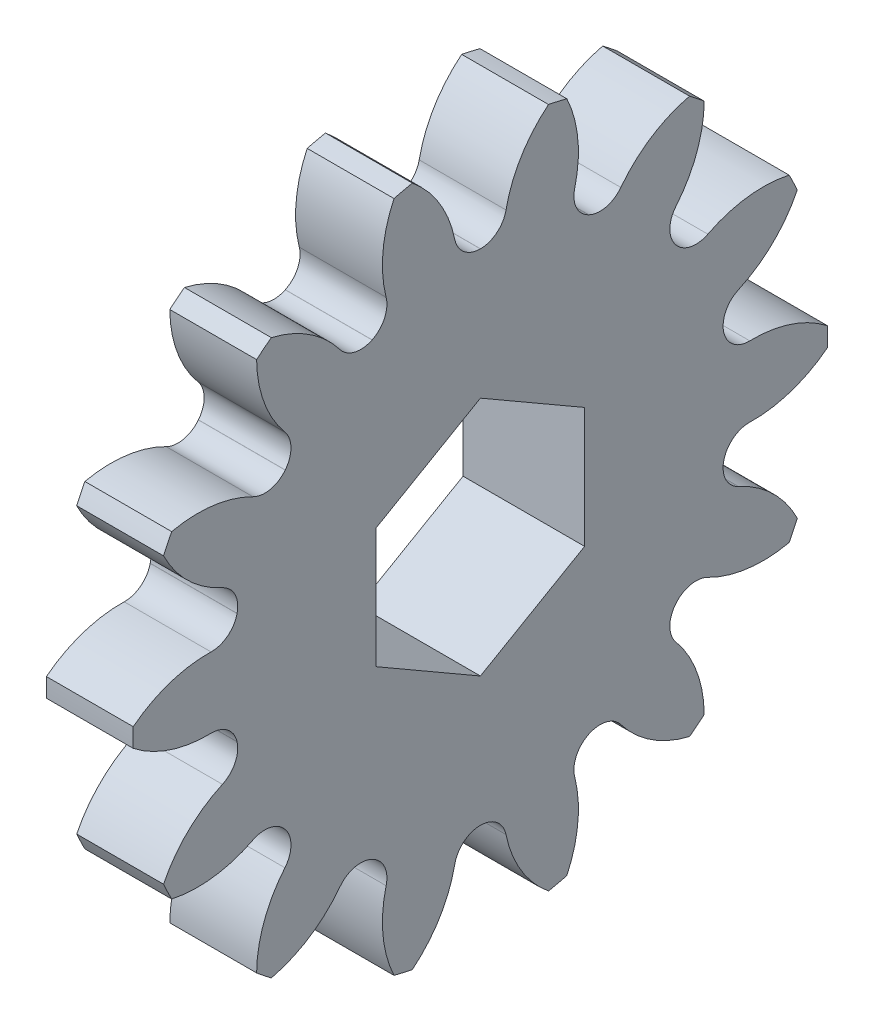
ISO-10303-21;
HEADER;
FILE_DESCRIPTION(('STEP AP214'),'2;1');
FILE_NAME('part.step','',(''),(''),'','','');
FILE_SCHEMA(('AUTOMOTIVE_DESIGN { 1 0 10303 214 1 1 1 1 }'));
ENDSEC;
DATA;
#1=APPLICATION_CONTEXT('core data for automotive mechanical design processes');
#2=APPLICATION_PROTOCOL_DEFINITION('international standard','automotive_design',2000,#1);
#3=PRODUCT_CONTEXT('',#1,'mechanical');
#4=PRODUCT('Part','Part','',(#3));
#5=PRODUCT_RELATED_PRODUCT_CATEGORY('part','',(#4));
#6=PRODUCT_DEFINITION_FORMATION('','',#4);
#7=PRODUCT_DEFINITION_CONTEXT('part definition',#1,'design');
#8=PRODUCT_DEFINITION('design','',#6,#7);
#9=PRODUCT_DEFINITION_SHAPE('','',#8);
#10=(LENGTH_UNIT() NAMED_UNIT(*) SI_UNIT(.MILLI.,.METRE.));
#11=(NAMED_UNIT(*) PLANE_ANGLE_UNIT() SI_UNIT($,.RADIAN.));
#12=(NAMED_UNIT(*) SI_UNIT($,.STERADIAN.) SOLID_ANGLE_UNIT());
#13=UNCERTAINTY_MEASURE_WITH_UNIT(LENGTH_MEASURE(1.E-05),#10,'distance_accuracy_value','');
#14=(GEOMETRIC_REPRESENTATION_CONTEXT(3) GLOBAL_UNCERTAINTY_ASSIGNED_CONTEXT((#13)) GLOBAL_UNIT_ASSIGNED_CONTEXT((#10,
#11,#12)) REPRESENTATION_CONTEXT('',''));
#15=CARTESIAN_POINT('',(0.,0.,0.));
#16=DIRECTION('',(0.,0.,1.));
#17=DIRECTION('',(1.,0.,0.));
#18=AXIS2_PLACEMENT_3D('',#15,#16,#17);
#19=CARTESIAN_POINT('',(0.,0.,0.));
#20=DIRECTION('',(-1.,0.,0.));
#21=DIRECTION('',(0.,0.,1.));
#22=AXIS2_PLACEMENT_3D('',#19,#20,#21);
#23=PLANE('',#22);
#24=CARTESIAN_POINT('',(0.,0.,0.));
#25=DIRECTION('',(-1.,0.,0.));
#26=DIRECTION('',(0.,0.,1.));
#27=AXIS2_PLACEMENT_3D('',#24,#25,#26);
#28=CIRCLE('',#27,28.749);
#29=CARTESIAN_POINT('',(0.,25.9054217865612,-12.4665200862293));
#30=VERTEX_POINT('',#29);
#31=CARTESIAN_POINT('',(0.,25.8984841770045,-12.480926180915));
#32=VERTEX_POINT('',#31);
#33=EDGE_CURVE('E682',#30,#32,#28,.T.);
#34=ORIENTED_EDGE('',*,*,#33,.T.);
#35=CARTESIAN_POINT('',(0.,28.601028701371,-13.7833289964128));
#36=DIRECTION('',(-1.,0.,0.));
#37=DIRECTION('',(0.,0.,1.));
#38=AXIS2_PLACEMENT_3D('',#35,#36,#37);
#39=CIRCLE('',#38,3.);
#40=CARTESIAN_POINT('',(0.,26.7857773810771,-16.1718144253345));
#41=VERTEX_POINT('',#40);
#42=EDGE_CURVE('E1313',#32,#41,#39,.F.);
#43=ORIENTED_EDGE('',*,*,#42,.T.);
#44=CARTESIAN_POINT('',(0.,18.314604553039,-27.3180797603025));
#45=DIRECTION('',(-1.,0.,0.));
#46=DIRECTION('',(0.,0.,1.));
#47=AXIS2_PLACEMENT_3D('',#44,#45,#46);
#48=CIRCLE('',#47,14.);
#49=CARTESIAN_POINT('',(0.,31.9361510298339,-24.0848968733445));
#50=VERTEX_POINT('',#49);
#51=EDGE_CURVE('E674',#41,#50,#48,.T.);
#52=ORIENTED_EDGE('',*,*,#51,.T.);
#53=CARTESIAN_POINT('',(0.,0.,0.));
#54=DIRECTION('',(-1.,0.,0.));
#55=DIRECTION('',(0.,0.,1.));
#56=AXIS2_PLACEMENT_3D('',#53,#54,#55);
#57=CIRCLE('',#56,40.);
#58=CARTESIAN_POINT('',(0.,30.5875003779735,-25.7760513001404));
#59=VERTEX_POINT('',#58);
#60=EDGE_CURVE('E1076',#50,#59,#57,.T.);
#61=ORIENTED_EDGE('',*,*,#60,.T.);
#62=CARTESIAN_POINT('',(0.,30.7085413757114,-11.7765745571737));
#63=DIRECTION('',(-1.,0.,0.));
#64=DIRECTION('',(0.,0.,1.));
#65=AXIS2_PLACEMENT_3D('',#62,#63,#64);
#66=CIRCLE('',#65,14.);
#67=CARTESIAN_POINT('',(0.,21.726749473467,-22.5156347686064));
#68=VERTEX_POINT('',#67);
#69=EDGE_CURVE('E1053',#59,#68,#66,.T.);
#70=ORIENTED_EDGE('',*,*,#69,.T.);
#71=CARTESIAN_POINT('',(0.,19.802079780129,-24.8168619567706));
#72=DIRECTION('',(-1.,0.,0.));
#73=DIRECTION('',(0.,0.,1.));
#74=AXIS2_PLACEMENT_3D('',#71,#72,#73);
#75=CIRCLE('',#74,3.);
#76=CARTESIAN_POINT('',(0.,17.9309581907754,-22.4718877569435));
#77=VERTEX_POINT('',#76);
#78=EDGE_CURVE('E1445',#68,#77,#75,.F.);
#79=ORIENTED_EDGE('',*,*,#78,.T.);
#80=CARTESIAN_POINT('',(0.,0.,0.));
#81=DIRECTION('',(-1.,0.,0.));
#82=DIRECTION('',(0.,0.,1.));
#83=AXIS2_PLACEMENT_3D('',#80,#81,#82);
#84=CIRCLE('',#83,28.749);
#85=CARTESIAN_POINT('',(0.,17.9184570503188,-22.4818570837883));
#86=VERTEX_POINT('',#85);
#87=EDGE_CURVE('E1058',#77,#86,#84,.T.);
#88=ORIENTED_EDGE('',*,*,#87,.T.);
#89=CARTESIAN_POINT('',(0.,19.7882741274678,-24.827871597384));
#90=DIRECTION('',(-1.,0.,0.));
#91=DIRECTION('',(0.,0.,1.));
#92=AXIS2_PLACEMENT_3D('',#89,#90,#91);
#93=CIRCLE('',#92,3.);
#94=CARTESIAN_POINT('',(0.,17.1164642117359,-26.1922145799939));
#95=VERTEX_POINT('',#94);
#96=EDGE_CURVE('E1307',#86,#95,#93,.F.);
#97=ORIENTED_EDGE('',*,*,#96,.T.);
#98=CARTESIAN_POINT('',(0.,4.64801793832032,-32.5591484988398));
#99=DIRECTION('',(-1.,0.,0.));
#100=DIRECTION('',(0.,0.,1.));
#101=AXIS2_PLACEMENT_3D('',#98,#99,#100);
#102=CIRCLE('',#101,14.);
#103=CARTESIAN_POINT('',(0.,18.3234327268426,-35.5563188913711));
#104=VERTEX_POINT('',#103);
#105=EDGE_CURVE('E1050',#95,#104,#102,.T.);
#106=ORIENTED_EDGE('',*,*,#105,.T.);
#107=CARTESIAN_POINT('',(0.,16.3745760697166,-36.4948387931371));
#108=VERTEX_POINT('',#107);
#109=EDGE_CURVE('E1080',#104,#108,#57,.T.);
#110=ORIENTED_EDGE('',*,*,#109,.T.);
#111=CARTESIAN_POINT('',(0.,22.557775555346,-23.9342638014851));
#112=DIRECTION('',(-1.,0.,0.));
#113=DIRECTION('',(0.,0.,1.));
#114=AXIS2_PLACEMENT_3D('',#111,#112,#113);
#115=CIRCLE('',#114,14.);
#116=CARTESIAN_POINT('',(0.,9.80595707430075,-29.712769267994));
#117=VERTEX_POINT('',#116);
#118=EDGE_CURVE('E1024',#108,#117,#115,.T.);
#119=ORIENTED_EDGE('',*,*,#118,.T.);
#120=CARTESIAN_POINT('',(0.,7.0734245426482,-30.9510204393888));
#121=DIRECTION('',(-1.,0.,0.));
#122=DIRECTION('',(0.,0.,1.));
#123=AXIS2_PLACEMENT_3D('',#120,#121,#122);
#124=CIRCLE('',#123,3.);
#125=CARTESIAN_POINT('',(0.,6.40504841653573,-28.0264224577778));
#126=VERTEX_POINT('',#125);
#127=EDGE_CURVE('E1319',#117,#126,#124,.F.);
#128=ORIENTED_EDGE('',*,*,#127,.T.);
#129=CARTESIAN_POINT('',(0.,0.,0.));
#130=DIRECTION('',(-1.,0.,0.));
#131=DIRECTION('',(0.,0.,1.));
#132=AXIS2_PLACEMENT_3D('',#129,#130,#131);
#133=CIRCLE('',#132,28.749);
#134=CARTESIAN_POINT('',(0.,6.38945974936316,-28.0299804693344));
#135=VERTEX_POINT('',#134);
#136=EDGE_CURVE('E1029',#126,#135,#133,.T.);
#137=ORIENTED_EDGE('',*,*,#136,.T.);
#138=CARTESIAN_POINT('',(0.,7.0562091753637,-30.9549497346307));
#139=DIRECTION('',(-1.,0.,0.));
#140=DIRECTION('',(0.,0.,1.));
#141=AXIS2_PLACEMENT_3D('',#138,#139,#140);
#142=CIRCLE('',#141,3.);
#143=CARTESIAN_POINT('',(0.,4.05702538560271,-31.0249254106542));
#144=VERTEX_POINT('',#143);
#145=EDGE_CURVE('E1331',#135,#144,#142,.F.);
#146=ORIENTED_EDGE('',*,*,#145,.T.);
#147=CARTESIAN_POINT('',(0.,-9.93916563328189,-31.3514785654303));
#148=DIRECTION('',(-1.,0.,0.));
#149=DIRECTION('',(0.,0.,1.));
#150=AXIS2_PLACEMENT_3D('',#147,#148,#149);
#151=CIRCLE('',#150,14.);
#152=CARTESIAN_POINT('',(0.,1.08153385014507,-39.9853758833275));
#153=VERTEX_POINT('',#152);
#154=EDGE_CURVE('E1021',#144,#153,#151,.T.);
#155=ORIENTED_EDGE('',*,*,#154,.T.);
#156=CARTESIAN_POINT('',(0.,-1.08153385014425,-39.9853758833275));
#157=VERTEX_POINT('',#156);
#158=EDGE_CURVE('E1085',#153,#157,#57,.T.);
#159=ORIENTED_EDGE('',*,*,#158,.T.);
#160=CARTESIAN_POINT('',(0.,9.93916563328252,-31.3514785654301));
#161=DIRECTION('',(-1.,0.,0.));
#162=DIRECTION('',(0.,0.,1.));
#163=AXIS2_PLACEMENT_3D('',#160,#161,#162);
#164=CIRCLE('',#163,14.);
#165=CARTESIAN_POINT('',(0.,-4.05702538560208,-31.0249254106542));
#166=VERTEX_POINT('',#165);
#167=EDGE_CURVE('E996',#157,#166,#164,.T.);
#168=ORIENTED_EDGE('',*,*,#167,.T.);
#169=CARTESIAN_POINT('',(0.,-7.05620917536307,-30.9549497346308));
#170=DIRECTION('',(-1.,0.,0.));
#171=DIRECTION('',(0.,0.,1.));
#172=AXIS2_PLACEMENT_3D('',#169,#170,#171);
#173=CIRCLE('',#172,3.);
#174=CARTESIAN_POINT('',(0.,-6.38945974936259,-28.0299804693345));
#175=VERTEX_POINT('',#174);
#176=EDGE_CURVE('E1343',#166,#175,#173,.F.);
#177=ORIENTED_EDGE('',*,*,#176,.T.);
#178=CARTESIAN_POINT('',(0.,0.,0.));
#179=DIRECTION('',(-1.,0.,0.));
#180=DIRECTION('',(0.,0.,1.));
#181=AXIS2_PLACEMENT_3D('',#178,#179,#180);
#182=CIRCLE('',#181,28.749);
#183=CARTESIAN_POINT('',(0.,-6.40504841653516,-28.026422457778));
#184=VERTEX_POINT('',#183);
#185=EDGE_CURVE('E1001',#175,#184,#182,.T.);
#186=ORIENTED_EDGE('',*,*,#185,.T.);
#187=CARTESIAN_POINT('',(0.,-7.07342454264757,-30.9510204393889));
#188=DIRECTION('',(-1.,0.,0.));
#189=DIRECTION('',(0.,0.,1.));
#190=AXIS2_PLACEMENT_3D('',#187,#188,#189);
#191=CIRCLE('',#190,3.);
#192=CARTESIAN_POINT('',(0.,-9.80595707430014,-29.7127692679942));
#193=VERTEX_POINT('',#192);
#194=EDGE_CURVE('E1355',#184,#193,#191,.F.);
#195=ORIENTED_EDGE('',*,*,#194,.T.);
#196=CARTESIAN_POINT('',(0.,-22.5577755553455,-23.9342638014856));
#197=DIRECTION('',(-1.,0.,0.));
#198=DIRECTION('',(0.,0.,1.));
#199=AXIS2_PLACEMENT_3D('',#196,#197,#198);
#200=CIRCLE('',#199,14.);
#201=CARTESIAN_POINT('',(0.,-16.3745760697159,-36.4948387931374));
#202=VERTEX_POINT('',#201);
#203=EDGE_CURVE('E993',#193,#202,#200,.T.);
#204=ORIENTED_EDGE('',*,*,#203,.T.);
#205=CARTESIAN_POINT('',(0.,-18.3234327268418,-35.5563188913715));
#206=VERTEX_POINT('',#205);
#207=EDGE_CURVE('E1615',#202,#206,#57,.T.);
#208=ORIENTED_EDGE('',*,*,#207,.T.);
#209=CARTESIAN_POINT('',(0.,-4.64801793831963,-32.5591484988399));
#210=DIRECTION('',(-1.,0.,0.));
#211=DIRECTION('',(0.,0.,1.));
#212=AXIS2_PLACEMENT_3D('',#209,#210,#211);
#213=CIRCLE('',#212,14.);
#214=CARTESIAN_POINT('',(0.,-17.1164642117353,-26.1922145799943));
#215=VERTEX_POINT('',#214);
#216=EDGE_CURVE('E967',#206,#215,#213,.T.);
#217=ORIENTED_EDGE('',*,*,#216,.T.);
#218=CARTESIAN_POINT('',(0.,-19.7882741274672,-24.8278715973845));
#219=DIRECTION('',(-1.,0.,0.));
#220=DIRECTION('',(0.,0.,1.));
#221=AXIS2_PLACEMENT_3D('',#218,#219,#220);
#222=CIRCLE('',#221,3.);
#223=CARTESIAN_POINT('',(0.,-17.9184570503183,-22.4818570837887));
#224=VERTEX_POINT('',#223);
#225=EDGE_CURVE('E1367',#215,#224,#222,.F.);
#226=ORIENTED_EDGE('',*,*,#225,.T.);
#227=CARTESIAN_POINT('',(0.,0.,0.));
#228=DIRECTION('',(-1.,0.,0.));
#229=DIRECTION('',(0.,0.,1.));
#230=AXIS2_PLACEMENT_3D('',#227,#228,#229);
#231=CIRCLE('',#230,28.749);
#232=CARTESIAN_POINT('',(0.,-17.9309581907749,-22.4718877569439));
#233=VERTEX_POINT('',#232);
#234=EDGE_CURVE('E972',#224,#233,#231,.T.);
#235=ORIENTED_EDGE('',*,*,#234,.T.);
#236=CARTESIAN_POINT('',(0.,-19.8020797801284,-24.816861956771));
#237=DIRECTION('',(-1.,0.,0.));
#238=DIRECTION('',(0.,0.,1.));
#239=AXIS2_PLACEMENT_3D('',#236,#237,#238);
#240=CIRCLE('',#239,3.);
#241=CARTESIAN_POINT('',(0.,-21.7267494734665,-22.5156347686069));
#242=VERTEX_POINT('',#241);
#243=EDGE_CURVE('E1379',#233,#242,#240,.F.);
#244=ORIENTED_EDGE('',*,*,#243,.T.);
#245=CARTESIAN_POINT('',(0.,-30.7085413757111,-11.7765745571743));
#246=DIRECTION('',(-1.,0.,0.));
#247=DIRECTION('',(0.,0.,1.));
#248=AXIS2_PLACEMENT_3D('',#245,#246,#247);
#249=CIRCLE('',#248,14.);
#250=CARTESIAN_POINT('',(0.,-30.587500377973,-25.7760513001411));
#251=VERTEX_POINT('',#250);
#252=EDGE_CURVE('E964',#242,#251,#249,.T.);
#253=ORIENTED_EDGE('',*,*,#252,.T.);
#254=CARTESIAN_POINT('',(0.,-31.9361510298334,-24.0848968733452));
#255=VERTEX_POINT('',#254);
#256=EDGE_CURVE('E1618',#251,#255,#57,.T.);
#257=ORIENTED_EDGE('',*,*,#256,.T.);
#258=CARTESIAN_POINT('',(0.,-18.3146045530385,-27.3180797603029));
#259=DIRECTION('',(-1.,0.,0.));
#260=DIRECTION('',(0.,0.,1.));
#261=AXIS2_PLACEMENT_3D('',#258,#259,#260);
#262=CIRCLE('',#261,14.);
#263=CARTESIAN_POINT('',(0.,-26.7857773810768,-16.171814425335));
#264=VERTEX_POINT('',#263);
#265=EDGE_CURVE('E938',#255,#264,#262,.T.);
#266=ORIENTED_EDGE('',*,*,#265,.T.);
#267=CARTESIAN_POINT('',(0.,-28.6010287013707,-13.7833289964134));
#268=DIRECTION('',(-1.,0.,0.));
#269=DIRECTION('',(0.,0.,1.));
#270=AXIS2_PLACEMENT_3D('',#267,#268,#269);
#271=CIRCLE('',#270,3.);
#272=CARTESIAN_POINT('',(0.,-25.8984841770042,-12.4809261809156));
#273=VERTEX_POINT('',#272);
#274=EDGE_CURVE('E1391',#264,#273,#271,.F.);
#275=ORIENTED_EDGE('',*,*,#274,.T.);
#276=CARTESIAN_POINT('',(0.,0.,0.));
#277=DIRECTION('',(-1.,0.,0.));
#278=DIRECTION('',(0.,0.,1.));
#279=AXIS2_PLACEMENT_3D('',#276,#277,#278);
#280=CIRCLE('',#279,28.749);
#281=CARTESIAN_POINT('',(0.,-25.9054217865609,-12.4665200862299));
#282=VERTEX_POINT('',#281);
#283=EDGE_CURVE('E943',#273,#282,#280,.T.);
#284=ORIENTED_EDGE('',*,*,#283,.T.);
#285=CARTESIAN_POINT('',(0.,-28.6086902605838,-13.7674196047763));
#286=DIRECTION('',(-1.,0.,0.));
#287=DIRECTION('',(0.,0.,1.));
#288=AXIS2_PLACEMENT_3D('',#285,#286,#287);
#289=CIRCLE('',#288,3.);
#290=CARTESIAN_POINT('',(0.,-29.3442926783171,-10.859002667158));
#291=VERTEX_POINT('',#290);
#292=EDGE_CURVE('E1403',#282,#291,#289,.F.);
#293=ORIENTED_EDGE('',*,*,#292,.T.);
#294=CARTESIAN_POINT('',(0.,-32.7771039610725,2.71360970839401));
#295=DIRECTION('',(-1.,0.,0.));
#296=DIRECTION('',(0.,0.,1.));
#297=AXIS2_PLACEMENT_3D('',#294,#295,#296);
#298=CIRCLE('',#297,14.);
#299=CARTESIAN_POINT('',(0.,-38.7421951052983,-9.95200072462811));
#300=VERTEX_POINT('',#299);
#301=EDGE_CURVE('E935',#291,#300,#298,.T.);
#302=ORIENTED_EDGE('',*,*,#301,.T.);
#303=CARTESIAN_POINT('',(0.,-39.2235229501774,-7.84316564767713));
#304=VERTEX_POINT('',#303);
#305=EDGE_CURVE('E1481',#300,#304,#57,.T.);
#306=ORIENTED_EDGE('',*,*,#305,.T.);
#307=CARTESIAN_POINT('',(0.,-28.3537591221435,-16.6663302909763));
#308=DIRECTION('',(-1.,0.,0.));
#309=DIRECTION('',(0.,0.,1.));
#310=AXIS2_PLACEMENT_3D('',#307,#308,#309);
#311=CIRCLE('',#310,14.);
#312=CARTESIAN_POINT('',(0.,-31.1498388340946,-2.94838808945));
#313=VERTEX_POINT('',#312);
#314=EDGE_CURVE('E909',#304,#313,#311,.T.);
#315=ORIENTED_EDGE('',*,*,#314,.T.);
#316=CARTESIAN_POINT('',(0.,-31.7489987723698,-0.00882904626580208));
#317=DIRECTION('',(-1.,0.,0.));
#318=DIRECTION('',(0.,0.,1.));
#319=AXIS2_PLACEMENT_3D('',#316,#317,#318);
#320=CIRCLE('',#319,3.);
#321=CARTESIAN_POINT('',(0.,-28.7489988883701,-0.00799477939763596));
#322=VERTEX_POINT('',#321);
#323=EDGE_CURVE('E1415',#313,#322,#320,.F.);
#324=ORIENTED_EDGE('',*,*,#323,.T.);
#325=CARTESIAN_POINT('',(0.,0.,0.));
#326=DIRECTION('',(-1.,0.,0.));
#327=DIRECTION('',(0.,0.,1.));
#328=AXIS2_PLACEMENT_3D('',#325,#326,#327);
#329=CIRCLE('',#328,28.749);
#330=CARTESIAN_POINT('',(0.,-28.7489988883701,0.00799477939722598));
#331=VERTEX_POINT('',#330);
#332=EDGE_CURVE('E914',#322,#331,#329,.T.);
#333=ORIENTED_EDGE('',*,*,#332,.T.);
#334=CARTESIAN_POINT('',(0.,-31.7489987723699,0.00882904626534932));
#335=DIRECTION('',(-1.,0.,0.));
#336=DIRECTION('',(0.,0.,1.));
#337=AXIS2_PLACEMENT_3D('',#334,#335,#336);
#338=CIRCLE('',#337,3.);
#339=CARTESIAN_POINT('',(0.,-31.1498388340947,2.94838808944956));
#340=VERTEX_POINT('',#339);
#341=EDGE_CURVE('E1427',#331,#340,#338,.F.);
#342=ORIENTED_EDGE('',*,*,#341,.T.);
#343=CARTESIAN_POINT('',(0.,-28.3537591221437,16.6663302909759));
#344=DIRECTION('',(-1.,0.,0.));
#345=DIRECTION('',(0.,0.,1.));
#346=AXIS2_PLACEMENT_3D('',#343,#344,#345);
#347=CIRCLE('',#346,14.);
#348=CARTESIAN_POINT('',(0.,-39.2235229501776,7.84316564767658));
#349=VERTEX_POINT('',#348);
#350=EDGE_CURVE('E906',#340,#349,#347,.T.);
#351=ORIENTED_EDGE('',*,*,#350,.T.);
#352=CARTESIAN_POINT('',(0.,-38.7421951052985,9.95200072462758));
#353=VERTEX_POINT('',#352);
#354=EDGE_CURVE('E1476',#349,#353,#57,.T.);
#355=ORIENTED_EDGE('',*,*,#354,.T.);
#356=CARTESIAN_POINT('',(0.,-32.7771039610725,-2.71360970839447));
#357=DIRECTION('',(-1.,0.,0.));
#358=DIRECTION('',(0.,0.,1.));
#359=AXIS2_PLACEMENT_3D('',#356,#357,#358);
#360=CIRCLE('',#359,14.);
#361=CARTESIAN_POINT('',(0.,-29.3442926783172,10.8590026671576));
#362=VERTEX_POINT('',#361);
#363=EDGE_CURVE('E880',#353,#362,#360,.T.);
#364=ORIENTED_EDGE('',*,*,#363,.T.);
#365=CARTESIAN_POINT('',(0.,-28.608690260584,13.7674196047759));
#366=DIRECTION('',(-1.,0.,0.));
#367=DIRECTION('',(0.,0.,1.));
#368=AXIS2_PLACEMENT_3D('',#365,#366,#367);
#369=CIRCLE('',#368,3.);
#370=CARTESIAN_POINT('',(0.,-25.9054217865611,12.4665200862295));
#371=VERTEX_POINT('',#370);
#372=EDGE_CURVE('E1439',#362,#371,#369,.F.);
#373=ORIENTED_EDGE('',*,*,#372,.T.);
#374=CARTESIAN_POINT('',(0.,0.,0.));
#375=DIRECTION('',(-1.,0.,0.));
#376=DIRECTION('',(0.,0.,1.));
#377=AXIS2_PLACEMENT_3D('',#374,#375,#376);
#378=CIRCLE('',#377,28.749);
#379=CARTESIAN_POINT('',(0.,-25.8984841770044,12.4809261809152));
#380=VERTEX_POINT('',#379);
#381=EDGE_CURVE('E885',#371,#380,#378,.T.);
#382=ORIENTED_EDGE('',*,*,#381,.T.);
#383=CARTESIAN_POINT('',(0.,-28.6010287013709,13.783328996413));
#384=DIRECTION('',(-1.,0.,0.));
#385=DIRECTION('',(0.,0.,1.));
#386=AXIS2_PLACEMENT_3D('',#383,#384,#385);
#387=CIRCLE('',#386,3.);
#388=CARTESIAN_POINT('',(0.,-26.785777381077,16.1718144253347));
#389=VERTEX_POINT('',#388);
#390=EDGE_CURVE('E11',#380,#389,#387,.F.);
#391=ORIENTED_EDGE('',*,*,#390,.T.);
#392=CARTESIAN_POINT('',(0.,-18.3146045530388,27.3180797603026));
#393=DIRECTION('',(-1.,0.,0.));
#394=DIRECTION('',(0.,0.,1.));
#395=AXIS2_PLACEMENT_3D('',#392,#393,#394);
#396=CIRCLE('',#395,14.);
#397=CARTESIAN_POINT('',(0.,-31.9361510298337,24.0848968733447));
#398=VERTEX_POINT('',#397);
#399=EDGE_CURVE('E877',#389,#398,#396,.T.);
#400=ORIENTED_EDGE('',*,*,#399,.T.);
#401=CARTESIAN_POINT('',(0.,-30.5875003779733,25.7760513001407));
#402=VERTEX_POINT('',#401);
#403=EDGE_CURVE('E1473',#398,#402,#57,.T.);
#404=ORIENTED_EDGE('',*,*,#403,.T.);
#405=CARTESIAN_POINT('',(0.,-30.7085413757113,11.7765745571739));
#406=DIRECTION('',(-1.,0.,0.));
#407=DIRECTION('',(0.,0.,1.));
#408=AXIS2_PLACEMENT_3D('',#405,#406,#407);
#409=CIRCLE('',#408,14.);
#410=CARTESIAN_POINT('',(0.,-21.7267494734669,22.5156347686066));
#411=VERTEX_POINT('',#410);
#412=EDGE_CURVE('E851',#402,#411,#409,.T.);
#413=ORIENTED_EDGE('',*,*,#412,.T.);
#414=CARTESIAN_POINT('',(0.,-19.8020797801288,24.8168619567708));
#415=DIRECTION('',(-1.,0.,0.));
#416=DIRECTION('',(0.,0.,1.));
#417=AXIS2_PLACEMENT_3D('',#414,#415,#416);
#418=CIRCLE('',#417,3.);
#419=CARTESIAN_POINT('',(0.,-17.9309581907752,22.4718877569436));
#420=VERTEX_POINT('',#419);
#421=EDGE_CURVE('E1361',#411,#420,#418,.F.);
#422=ORIENTED_EDGE('',*,*,#421,.T.);
#423=CARTESIAN_POINT('',(0.,0.,0.));
#424=DIRECTION('',(-1.,0.,0.));
#425=DIRECTION('',(0.,0.,1.));
#426=AXIS2_PLACEMENT_3D('',#423,#424,#425);
#427=CIRCLE('',#426,28.749);
#428=CARTESIAN_POINT('',(0.,-17.9184570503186,22.4818570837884));
#429=VERTEX_POINT('',#428);
#430=EDGE_CURVE('E856',#420,#429,#427,.T.);
#431=ORIENTED_EDGE('',*,*,#430,.T.);
#432=CARTESIAN_POINT('',(0.,-19.7882741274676,24.8278715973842));
#433=DIRECTION('',(-1.,0.,0.));
#434=DIRECTION('',(0.,0.,1.));
#435=AXIS2_PLACEMENT_3D('',#432,#433,#434);
#436=CIRCLE('',#435,3.);
#437=CARTESIAN_POINT('',(0.,-17.1164642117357,26.192214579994));
#438=VERTEX_POINT('',#437);
#439=EDGE_CURVE('E1289',#429,#438,#436,.F.);
#440=ORIENTED_EDGE('',*,*,#439,.T.);
#441=CARTESIAN_POINT('',(0.,-4.64801793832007,32.5591484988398));
#442=DIRECTION('',(-1.,0.,0.));
#443=DIRECTION('',(0.,0.,1.));
#444=AXIS2_PLACEMENT_3D('',#441,#442,#443);
#445=CIRCLE('',#444,14.);
#446=CARTESIAN_POINT('',(0.,-18.3234327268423,35.5563188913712));
#447=VERTEX_POINT('',#446);
#448=EDGE_CURVE('E848',#438,#447,#445,.T.);
#449=ORIENTED_EDGE('',*,*,#448,.T.);
#450=CARTESIAN_POINT('',(0.,-16.3745760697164,36.4948387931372));
#451=VERTEX_POINT('',#450);
#452=EDGE_CURVE('E1477',#447,#451,#57,.T.);
#453=ORIENTED_EDGE('',*,*,#452,.T.);
#454=CARTESIAN_POINT('',(0.,-22.5577755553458,23.9342638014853));
#455=DIRECTION('',(-1.,0.,0.));
#456=DIRECTION('',(0.,0.,1.));
#457=AXIS2_PLACEMENT_3D('',#454,#455,#456);
#458=CIRCLE('',#457,14.);
#459=CARTESIAN_POINT('',(0.,-9.80595707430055,29.7127692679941));
#460=VERTEX_POINT('',#459);
#461=EDGE_CURVE('E822',#451,#460,#458,.T.);
#462=ORIENTED_EDGE('',*,*,#461,.T.);
#463=CARTESIAN_POINT('',(0.,-7.07342454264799,30.9510204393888));
#464=DIRECTION('',(-1.,0.,0.));
#465=DIRECTION('',(0.,0.,1.));
#466=AXIS2_PLACEMENT_3D('',#463,#464,#465);
#467=CIRCLE('',#466,3.);
#468=CARTESIAN_POINT('',(0.,-6.40504841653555,28.0264224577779));
#469=VERTEX_POINT('',#468);
#470=EDGE_CURVE('E1373',#460,#469,#467,.F.);
#471=ORIENTED_EDGE('',*,*,#470,.T.);
#472=CARTESIAN_POINT('',(0.,0.,0.));
#473=DIRECTION('',(-1.,0.,0.));
#474=DIRECTION('',(0.,0.,1.));
#475=AXIS2_PLACEMENT_3D('',#472,#473,#474);
#476=CIRCLE('',#475,28.749);
#477=CARTESIAN_POINT('',(0.,-6.38945974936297,28.0299804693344));
#478=VERTEX_POINT('',#477);
#479=EDGE_CURVE('E827',#469,#478,#476,.T.);
#480=ORIENTED_EDGE('',*,*,#479,.T.);
#481=CARTESIAN_POINT('',(0.,-7.05620917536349,30.9549497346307));
#482=DIRECTION('',(-1.,0.,0.));
#483=DIRECTION('',(0.,0.,1.));
#484=AXIS2_PLACEMENT_3D('',#481,#482,#483);
#485=CIRCLE('',#484,3.);
#486=CARTESIAN_POINT('',(0.,-4.0570253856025,31.0249254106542));
#487=VERTEX_POINT('',#486);
#488=EDGE_CURVE('E1325',#478,#487,#485,.F.);
#489=ORIENTED_EDGE('',*,*,#488,.T.);
#490=CARTESIAN_POINT('',(0.,9.93916563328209,31.3514785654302));
#491=DIRECTION('',(-1.,0.,0.));
#492=DIRECTION('',(0.,0.,1.));
#493=AXIS2_PLACEMENT_3D('',#490,#491,#492);
#494=CIRCLE('',#493,14.);
#495=CARTESIAN_POINT('',(0.,-1.08153385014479,39.9853758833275));
#496=VERTEX_POINT('',#495);
#497=EDGE_CURVE('E819',#487,#496,#494,.T.);
#498=ORIENTED_EDGE('',*,*,#497,.T.);
#499=CARTESIAN_POINT('',(0.,1.08153385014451,39.9853758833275));
#500=VERTEX_POINT('',#499);
#501=EDGE_CURVE('E1483',#496,#500,#57,.T.);
#502=ORIENTED_EDGE('',*,*,#501,.T.);
#503=CARTESIAN_POINT('',(0.,-9.93916563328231,31.3514785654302));
#504=DIRECTION('',(-1.,0.,0.));
#505=DIRECTION('',(0.,0.,1.));
#506=AXIS2_PLACEMENT_3D('',#503,#504,#505);
#507=CIRCLE('',#506,14.);
#508=CARTESIAN_POINT('',(0.,4.05702538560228,31.0249254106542));
#509=VERTEX_POINT('',#508);
#510=EDGE_CURVE('E793',#500,#509,#507,.T.);
#511=ORIENTED_EDGE('',*,*,#510,.T.);
#512=CARTESIAN_POINT('',(0.,7.05620917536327,30.9549497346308));
#513=DIRECTION('',(-1.,0.,0.));
#514=DIRECTION('',(0.,0.,1.));
#515=AXIS2_PLACEMENT_3D('',#512,#513,#514);
#516=CIRCLE('',#515,3.);
#517=CARTESIAN_POINT('',(0.,6.38945974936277,28.0299804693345));
#518=VERTEX_POINT('',#517);
#519=EDGE_CURVE('E1385',#509,#518,#516,.F.);
#520=ORIENTED_EDGE('',*,*,#519,.T.);
#521=CARTESIAN_POINT('',(0.,0.,0.));
#522=DIRECTION('',(-1.,0.,0.));
#523=DIRECTION('',(0.,0.,1.));
#524=AXIS2_PLACEMENT_3D('',#521,#522,#523);
#525=CIRCLE('',#524,28.749);
#526=CARTESIAN_POINT('',(0.,6.40504841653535,28.0264224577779));
#527=VERTEX_POINT('',#526);
#528=EDGE_CURVE('E798',#518,#527,#525,.T.);
#529=ORIENTED_EDGE('',*,*,#528,.T.);
#530=CARTESIAN_POINT('',(0.,7.07342454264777,30.9510204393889));
#531=DIRECTION('',(-1.,0.,0.));
#532=DIRECTION('',(0.,0.,1.));
#533=AXIS2_PLACEMENT_3D('',#530,#531,#532);
#534=CIRCLE('',#533,3.);
#535=CARTESIAN_POINT('',(0.,9.80595707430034,29.7127692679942));
#536=VERTEX_POINT('',#535);
#537=EDGE_CURVE('E1301',#527,#536,#534,.F.);
#538=ORIENTED_EDGE('',*,*,#537,.T.);
#539=CARTESIAN_POINT('',(0.,22.5577755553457,23.9342638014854));
#540=DIRECTION('',(-1.,0.,0.));
#541=DIRECTION('',(0.,0.,1.));
#542=AXIS2_PLACEMENT_3D('',#539,#540,#541);
#543=CIRCLE('',#542,14.);
#544=CARTESIAN_POINT('',(0.,16.3745760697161,36.4948387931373));
#545=VERTEX_POINT('',#544);
#546=EDGE_CURVE('E790',#536,#545,#543,.T.);
#547=ORIENTED_EDGE('',*,*,#546,.T.);
#548=CARTESIAN_POINT('',(0.,18.3234327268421,35.5563188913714));
#549=VERTEX_POINT('',#548);
#550=EDGE_CURVE('E1487',#545,#549,#57,.T.);
#551=ORIENTED_EDGE('',*,*,#550,.T.);
#552=CARTESIAN_POINT('',(0.,4.64801793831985,32.5591484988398));
#553=DIRECTION('',(-1.,0.,0.));
#554=DIRECTION('',(0.,0.,1.));
#555=AXIS2_PLACEMENT_3D('',#552,#553,#554);
#556=CIRCLE('',#555,14.);
#557=CARTESIAN_POINT('',(0.,17.1164642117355,26.1922145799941));
#558=VERTEX_POINT('',#557);
#559=EDGE_CURVE('E764',#549,#558,#556,.T.);
#560=ORIENTED_EDGE('',*,*,#559,.T.);
#561=CARTESIAN_POINT('',(0.,19.7882741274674,24.8278715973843));
#562=DIRECTION('',(-1.,0.,0.));
#563=DIRECTION('',(0.,0.,1.));
#564=AXIS2_PLACEMENT_3D('',#561,#562,#563);
#565=CIRCLE('',#564,3.);
#566=CARTESIAN_POINT('',(0.,17.9184570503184,22.4818570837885));
#567=VERTEX_POINT('',#566);
#568=EDGE_CURVE('E1397',#558,#567,#565,.F.);
#569=ORIENTED_EDGE('',*,*,#568,.T.);
#570=CARTESIAN_POINT('',(0.,0.,0.));
#571=DIRECTION('',(-1.,0.,0.));
#572=DIRECTION('',(0.,0.,1.));
#573=AXIS2_PLACEMENT_3D('',#570,#571,#572);
#574=CIRCLE('',#573,28.749);
#575=CARTESIAN_POINT('',(0.,17.930958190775,22.4718877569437));
#576=VERTEX_POINT('',#575);
#577=EDGE_CURVE('E769',#567,#576,#574,.T.);
#578=ORIENTED_EDGE('',*,*,#577,.T.);
#579=CARTESIAN_POINT('',(0.,19.8020797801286,24.8168619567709));
#580=DIRECTION('',(-1.,0.,0.));
#581=DIRECTION('',(0.,0.,1.));
#582=AXIS2_PLACEMENT_3D('',#579,#580,#581);
#583=CIRCLE('',#582,3.);
#584=CARTESIAN_POINT('',(0.,21.7267494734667,22.5156347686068));
#585=VERTEX_POINT('',#584);
#586=EDGE_CURVE('E1337',#576,#585,#583,.F.);
#587=ORIENTED_EDGE('',*,*,#586,.T.);
#588=CARTESIAN_POINT('',(0.,30.7085413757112,11.7765745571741));
#589=DIRECTION('',(-1.,0.,0.));
#590=DIRECTION('',(0.,0.,1.));
#591=AXIS2_PLACEMENT_3D('',#588,#589,#590);
#592=CIRCLE('',#591,14.);
#593=CARTESIAN_POINT('',(0.,30.5875003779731,25.7760513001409));
#594=VERTEX_POINT('',#593);
#595=EDGE_CURVE('E761',#585,#594,#592,.T.);
#596=ORIENTED_EDGE('',*,*,#595,.T.);
#597=CARTESIAN_POINT('',(0.,31.9361510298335,24.084896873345));
#598=VERTEX_POINT('',#597);
#599=EDGE_CURVE('E1492',#594,#598,#57,.T.);
#600=ORIENTED_EDGE('',*,*,#599,.T.);
#601=CARTESIAN_POINT('',(0.,18.3146045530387,27.3180797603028));
#602=DIRECTION('',(-1.,0.,0.));
#603=DIRECTION('',(0.,0.,1.));
#604=AXIS2_PLACEMENT_3D('',#601,#602,#603);
#605=CIRCLE('',#604,14.);
#606=CARTESIAN_POINT('',(0.,26.7857773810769,16.1718144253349));
#607=VERTEX_POINT('',#606);
#608=EDGE_CURVE('E735',#598,#607,#605,.T.);
#609=ORIENTED_EDGE('',*,*,#608,.T.);
#610=CARTESIAN_POINT('',(0.,28.6010287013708,13.7833289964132));
#611=DIRECTION('',(-1.,0.,0.));
#612=DIRECTION('',(0.,0.,1.));
#613=AXIS2_PLACEMENT_3D('',#610,#611,#612);
#614=CIRCLE('',#613,3.);
#615=CARTESIAN_POINT('',(0.,25.8984841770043,12.4809261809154));
#616=VERTEX_POINT('',#615);
#617=EDGE_CURVE('E1409',#607,#616,#614,.F.);
#618=ORIENTED_EDGE('',*,*,#617,.T.);
#619=CARTESIAN_POINT('',(0.,0.,0.));
#620=DIRECTION('',(-1.,0.,0.));
#621=DIRECTION('',(0.,0.,1.));
#622=AXIS2_PLACEMENT_3D('',#619,#620,#621);
#623=CIRCLE('',#622,28.749);
#624=CARTESIAN_POINT('',(0.,25.905421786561,12.4665200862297));
#625=VERTEX_POINT('',#624);
#626=EDGE_CURVE('E740',#616,#625,#623,.T.);
#627=ORIENTED_EDGE('',*,*,#626,.T.);
#628=CARTESIAN_POINT('',(0.,28.6086902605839,13.7674196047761));
#629=DIRECTION('',(-1.,0.,0.));
#630=DIRECTION('',(0.,0.,1.));
#631=AXIS2_PLACEMENT_3D('',#628,#629,#630);
#632=CIRCLE('',#631,3.);
#633=CARTESIAN_POINT('',(0.,29.3442926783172,10.8590026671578));
#634=VERTEX_POINT('',#633);
#635=EDGE_CURVE('E1295',#625,#634,#632,.F.);
#636=ORIENTED_EDGE('',*,*,#635,.T.);
#637=CARTESIAN_POINT('',(0.,32.7771039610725,-2.71360970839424));
#638=DIRECTION('',(-1.,0.,0.));
#639=DIRECTION('',(0.,0.,1.));
#640=AXIS2_PLACEMENT_3D('',#637,#638,#639);
#641=CIRCLE('',#640,14.);
#642=CARTESIAN_POINT('',(0.,38.7421951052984,9.95200072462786));
#643=VERTEX_POINT('',#642);
#644=EDGE_CURVE('E732',#634,#643,#641,.T.);
#645=ORIENTED_EDGE('',*,*,#644,.T.);
#646=CARTESIAN_POINT('',(0.,39.2235229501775,7.84316564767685));
#647=VERTEX_POINT('',#646);
#648=EDGE_CURVE('E1497',#643,#647,#57,.T.);
#649=ORIENTED_EDGE('',*,*,#648,.T.);
#650=CARTESIAN_POINT('',(0.,28.3537591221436,16.6663302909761));
#651=DIRECTION('',(-1.,0.,0.));
#652=DIRECTION('',(0.,0.,1.));
#653=AXIS2_PLACEMENT_3D('',#650,#651,#652);
#654=CIRCLE('',#653,14.);
#655=CARTESIAN_POINT('',(0.,31.1498388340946,2.94838808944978));
#656=VERTEX_POINT('',#655);
#657=EDGE_CURVE('E706',#647,#656,#654,.T.);
#658=ORIENTED_EDGE('',*,*,#657,.T.);
#659=CARTESIAN_POINT('',(0.,31.7489987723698,0.00882904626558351));
#660=DIRECTION('',(-1.,0.,0.));
#661=DIRECTION('',(0.,0.,1.));
#662=AXIS2_PLACEMENT_3D('',#659,#660,#661);
#663=CIRCLE('',#662,3.);
#664=CARTESIAN_POINT('',(0.,28.74899888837,0.00799477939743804));
#665=VERTEX_POINT('',#664);
#666=EDGE_CURVE('E1421',#656,#665,#663,.F.);
#667=ORIENTED_EDGE('',*,*,#666,.T.);
#668=CARTESIAN_POINT('',(0.,0.,0.));
#669=DIRECTION('',(-1.,0.,0.));
#670=DIRECTION('',(0.,0.,1.));
#671=AXIS2_PLACEMENT_3D('',#668,#669,#670);
#672=CIRCLE('',#671,28.749);
#673=CARTESIAN_POINT('',(0.,28.74899888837,-0.00799477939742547));
#674=VERTEX_POINT('',#673);
#675=EDGE_CURVE('E711',#665,#674,#672,.T.);
#676=ORIENTED_EDGE('',*,*,#675,.T.);
#677=CARTESIAN_POINT('',(0.,31.7489987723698,-0.00882904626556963));
#678=DIRECTION('',(-1.,0.,0.));
#679=DIRECTION('',(0.,0.,1.));
#680=AXIS2_PLACEMENT_3D('',#677,#678,#679);
#681=CIRCLE('',#680,3.);
#682=CARTESIAN_POINT('',(0.,31.1498388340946,-2.94838808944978));
#683=VERTEX_POINT('',#682);
#684=EDGE_CURVE('E1349',#674,#683,#681,.F.);
#685=ORIENTED_EDGE('',*,*,#684,.T.);
#686=CARTESIAN_POINT('',(0.,28.3537591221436,-16.6663302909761));
#687=DIRECTION('',(-1.,0.,0.));
#688=DIRECTION('',(0.,0.,1.));
#689=AXIS2_PLACEMENT_3D('',#686,#687,#688);
#690=CIRCLE('',#689,14.);
#691=CARTESIAN_POINT('',(0.,39.2235229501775,-7.84316564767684));
#692=VERTEX_POINT('',#691);
#693=EDGE_CURVE('E703',#683,#692,#690,.T.);
#694=ORIENTED_EDGE('',*,*,#693,.T.);
#695=CARTESIAN_POINT('',(0.,38.7421951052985,-9.95200072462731));
#696=VERTEX_POINT('',#695);
#697=EDGE_CURVE('E1501',#692,#696,#57,.T.);
#698=ORIENTED_EDGE('',*,*,#697,.T.);
#699=CARTESIAN_POINT('',(0.,32.7771039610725,2.7136097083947));
#700=DIRECTION('',(-1.,0.,0.));
#701=DIRECTION('',(0.,0.,1.));
#702=AXIS2_PLACEMENT_3D('',#699,#700,#701);
#703=CIRCLE('',#702,14.);
#704=CARTESIAN_POINT('',(0.,29.3442926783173,-10.8590026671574));
#705=VERTEX_POINT('',#704);
#706=EDGE_CURVE('E677',#696,#705,#703,.T.);
#707=ORIENTED_EDGE('',*,*,#706,.T.);
#708=CARTESIAN_POINT('',(0.,28.6086902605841,-13.7674196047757));
#709=DIRECTION('',(-1.,0.,0.));
#710=DIRECTION('',(0.,0.,1.));
#711=AXIS2_PLACEMENT_3D('',#708,#709,#710);
#712=CIRCLE('',#711,3.);
#713=EDGE_CURVE('E1433',#705,#30,#712,.F.);
#714=ORIENTED_EDGE('',*,*,#713,.T.);
#715=EDGE_LOOP('',(#34,#43,#52,#61,#70,#79,#88,#97,#106,#110,#119,#128,#137,#146,#155,#159,#168,
#177,#186,#195,#204,#208,#217,#226,#235,#244,#253,#257,#266,#275,#284,#293,#302,#306,#315,#324,
#333,#342,#351,#355,#364,#373,#382,#391,#400,#404,#413,#422,#431,#440,#449,#453,#462,#471,#480,
#489,#498,#502,#511,#520,#529,#538,#547,#551,#560,#569,#578,#587,#596,#600,#609,#618,#627,#636,
#645,#649,#658,#667,#676,#685,#694,#698,#707,#714));
#716=FACE_BOUND('',#715,.T.);
#717=CARTESIAN_POINT('',(0.,0.,0.));
#718=DIRECTION('',(-1.,0.,0.));
#719=DIRECTION('',(0.,0.,1.));
#720=AXIS2_PLACEMENT_3D('',#717,#718,#719);
#721=CIRCLE('',#720,19.5);
#722=CARTESIAN_POINT('',(0.,0.,19.5));
#723=VERTEX_POINT('',#722);
#724=EDGE_CURVE('E654',#723,#723,#721,.T.);
#725=ORIENTED_EDGE('',*,*,#724,.F.);
#726=EDGE_LOOP('',(#725));
#727=FACE_BOUND('',#726,.T.);
#728=ADVANCED_FACE('F36',(#716,#727),#23,.T.);
#729=CARTESIAN_POINT('',(10.,0.,0.));
#730=DIRECTION('',(-1.,0.,0.));
#731=DIRECTION('',(0.,0.,1.));
#732=AXIS2_PLACEMENT_3D('',#729,#730,#731);
#733=CYLINDRICAL_SURFACE('',#732,40.);
#734=DIRECTION('',(1.,0.,0.));
#735=VECTOR('',#734,1.);
#736=CARTESIAN_POINT('',(0.,31.9361510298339,-24.0848968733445));
#737=LINE('',#736,#735);
#738=CARTESIAN_POINT('',(10.,31.9361510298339,-24.0848968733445));
#739=VERTEX_POINT('',#738);
#740=EDGE_CURVE('E686',#50,#739,#737,.T.);
#741=ORIENTED_EDGE('',*,*,#740,.T.);
#742=CARTESIAN_POINT('',(10.,0.,0.));
#743=DIRECTION('',(-1.,0.,0.));
#744=DIRECTION('',(0.,0.,1.));
#745=AXIS2_PLACEMENT_3D('',#742,#743,#744);
#746=CIRCLE('',#745,40.);
#747=CARTESIAN_POINT('',(10.,30.5875003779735,-25.7760513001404));
#748=VERTEX_POINT('',#747);
#749=EDGE_CURVE('E1084',#739,#748,#746,.T.);
#750=ORIENTED_EDGE('',*,*,#749,.T.);
#751=DIRECTION('',(1.,0.,0.));
#752=VECTOR('',#751,1.);
#753=CARTESIAN_POINT('',(0.,30.5875003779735,-25.7760513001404));
#754=LINE('',#753,#752);
#755=EDGE_CURVE('E1072',#59,#748,#754,.T.);
#756=ORIENTED_EDGE('',*,*,#755,.F.);
#757=ORIENTED_EDGE('',*,*,#60,.F.);
#758=EDGE_LOOP('',(#741,#750,#756,#757));
#759=FACE_BOUND('',#758,.T.);
#760=ADVANCED_FACE('F1518',(#759),#733,.T.);
#761=DIRECTION('',(1.,0.,0.));
#762=VECTOR('',#761,1.);
#763=CARTESIAN_POINT('',(0.,38.7421951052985,-9.95200072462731));
#764=LINE('',#763,#762);
#765=CARTESIAN_POINT('',(10.,38.7421951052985,-9.95200072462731));
#766=VERTEX_POINT('',#765);
#767=EDGE_CURVE('E696',#696,#766,#764,.T.);
#768=ORIENTED_EDGE('',*,*,#767,.F.);
#769=ORIENTED_EDGE('',*,*,#697,.F.);
#770=DIRECTION('',(1.,0.,0.));
#771=VECTOR('',#770,1.);
#772=CARTESIAN_POINT('',(0.,39.2235229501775,-7.84316564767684));
#773=LINE('',#772,#771);
#774=CARTESIAN_POINT('',(10.,39.2235229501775,-7.84316564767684));
#775=VERTEX_POINT('',#774);
#776=EDGE_CURVE('E715',#692,#775,#773,.T.);
#777=ORIENTED_EDGE('',*,*,#776,.T.);
#778=EDGE_CURVE('E1520',#775,#766,#746,.T.);
#779=ORIENTED_EDGE('',*,*,#778,.T.);
#780=EDGE_LOOP('',(#768,#769,#777,#779));
#781=FACE_BOUND('',#780,.T.);
#782=ADVANCED_FACE('F1677',(#781),#733,.T.);
#783=DIRECTION('',(1.,0.,0.));
#784=VECTOR('',#783,1.);
#785=CARTESIAN_POINT('',(0.,39.2235229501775,7.84316564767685));
#786=LINE('',#785,#784);
#787=CARTESIAN_POINT('',(10.,39.2235229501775,7.84316564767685));
#788=VERTEX_POINT('',#787);
#789=EDGE_CURVE('E725',#647,#788,#786,.T.);
#790=ORIENTED_EDGE('',*,*,#789,.F.);
#791=ORIENTED_EDGE('',*,*,#648,.F.);
#792=DIRECTION('',(1.,0.,0.));
#793=VECTOR('',#792,1.);
#794=CARTESIAN_POINT('',(0.,38.7421951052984,9.95200072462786));
#795=LINE('',#794,#793);
#796=CARTESIAN_POINT('',(10.,38.7421951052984,9.95200072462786));
#797=VERTEX_POINT('',#796);
#798=EDGE_CURVE('E744',#643,#797,#795,.T.);
#799=ORIENTED_EDGE('',*,*,#798,.T.);
#800=EDGE_CURVE('E1523',#797,#788,#746,.T.);
#801=ORIENTED_EDGE('',*,*,#800,.T.);
#802=EDGE_LOOP('',(#790,#791,#799,#801));
#803=FACE_BOUND('',#802,.T.);
#804=ADVANCED_FACE('F2378',(#803),#733,.T.);
#805=DIRECTION('',(1.,0.,0.));
#806=VECTOR('',#805,1.);
#807=CARTESIAN_POINT('',(0.,31.9361510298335,24.084896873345));
#808=LINE('',#807,#806);
#809=CARTESIAN_POINT('',(10.,31.9361510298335,24.084896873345));
#810=VERTEX_POINT('',#809);
#811=EDGE_CURVE('E754',#598,#810,#808,.T.);
#812=ORIENTED_EDGE('',*,*,#811,.F.);
#813=ORIENTED_EDGE('',*,*,#599,.F.);
#814=DIRECTION('',(1.,0.,0.));
#815=VECTOR('',#814,1.);
#816=CARTESIAN_POINT('',(0.,30.5875003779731,25.7760513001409));
#817=LINE('',#816,#815);
#818=CARTESIAN_POINT('',(10.,30.5875003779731,25.7760513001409));
#819=VERTEX_POINT('',#818);
#820=EDGE_CURVE('E773',#594,#819,#817,.T.);
#821=ORIENTED_EDGE('',*,*,#820,.T.);
#822=EDGE_CURVE('E1529',#819,#810,#746,.T.);
#823=ORIENTED_EDGE('',*,*,#822,.T.);
#824=EDGE_LOOP('',(#812,#813,#821,#823));
#825=FACE_BOUND('',#824,.T.);
#826=ADVANCED_FACE('F2397',(#825),#733,.T.);
#827=DIRECTION('',(1.,0.,0.));
#828=VECTOR('',#827,1.);
#829=CARTESIAN_POINT('',(0.,18.3234327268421,35.5563188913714));
#830=LINE('',#829,#828);
#831=CARTESIAN_POINT('',(10.,18.3234327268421,35.5563188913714));
#832=VERTEX_POINT('',#831);
#833=EDGE_CURVE('E783',#549,#832,#830,.T.);
#834=ORIENTED_EDGE('',*,*,#833,.F.);
#835=ORIENTED_EDGE('',*,*,#550,.F.);
#836=DIRECTION('',(1.,0.,0.));
#837=VECTOR('',#836,1.);
#838=CARTESIAN_POINT('',(0.,16.3745760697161,36.4948387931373));
#839=LINE('',#838,#837);
#840=CARTESIAN_POINT('',(10.,16.3745760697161,36.4948387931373));
#841=VERTEX_POINT('',#840);
#842=EDGE_CURVE('E802',#545,#841,#839,.T.);
#843=ORIENTED_EDGE('',*,*,#842,.T.);
#844=EDGE_CURVE('E1535',#841,#832,#746,.T.);
#845=ORIENTED_EDGE('',*,*,#844,.T.);
#846=EDGE_LOOP('',(#834,#835,#843,#845));
#847=FACE_BOUND('',#846,.T.);
#848=ADVANCED_FACE('F2417',(#847),#733,.T.);
#849=DIRECTION('',(1.,0.,0.));
#850=VECTOR('',#849,1.);
#851=CARTESIAN_POINT('',(0.,1.08153385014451,39.9853758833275));
#852=LINE('',#851,#850);
#853=CARTESIAN_POINT('',(10.,1.08153385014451,39.9853758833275));
#854=VERTEX_POINT('',#853);
#855=EDGE_CURVE('E812',#500,#854,#852,.T.);
#856=ORIENTED_EDGE('',*,*,#855,.F.);
#857=ORIENTED_EDGE('',*,*,#501,.F.);
#858=DIRECTION('',(1.,0.,0.));
#859=VECTOR('',#858,1.);
#860=CARTESIAN_POINT('',(0.,-1.08153385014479,39.9853758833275));
#861=LINE('',#860,#859);
#862=CARTESIAN_POINT('',(10.,-1.08153385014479,39.9853758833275));
#863=VERTEX_POINT('',#862);
#864=EDGE_CURVE('E831',#496,#863,#861,.T.);
#865=ORIENTED_EDGE('',*,*,#864,.T.);
#866=EDGE_CURVE('E1541',#863,#854,#746,.T.);
#867=ORIENTED_EDGE('',*,*,#866,.T.);
#868=EDGE_LOOP('',(#856,#857,#865,#867));
#869=FACE_BOUND('',#868,.T.);
#870=ADVANCED_FACE('F2437',(#869),#733,.T.);
#871=DIRECTION('',(1.,0.,0.));
#872=VECTOR('',#871,1.);
#873=CARTESIAN_POINT('',(0.,-16.3745760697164,36.4948387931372));
#874=LINE('',#873,#872);
#875=CARTESIAN_POINT('',(10.,-16.3745760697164,36.4948387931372));
#876=VERTEX_POINT('',#875);
#877=EDGE_CURVE('E841',#451,#876,#874,.T.);
#878=ORIENTED_EDGE('',*,*,#877,.F.);
#879=ORIENTED_EDGE('',*,*,#452,.F.);
#880=DIRECTION('',(1.,0.,0.));
#881=VECTOR('',#880,1.);
#882=CARTESIAN_POINT('',(0.,-18.3234327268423,35.5563188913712));
#883=LINE('',#882,#881);
#884=CARTESIAN_POINT('',(10.,-18.3234327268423,35.5563188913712));
#885=VERTEX_POINT('',#884);
#886=EDGE_CURVE('E860',#447,#885,#883,.T.);
#887=ORIENTED_EDGE('',*,*,#886,.T.);
#888=EDGE_CURVE('E1547',#885,#876,#746,.T.);
#889=ORIENTED_EDGE('',*,*,#888,.T.);
#890=EDGE_LOOP('',(#878,#879,#887,#889));
#891=FACE_BOUND('',#890,.T.);
#892=ADVANCED_FACE('F1668',(#891),#733,.T.);
#893=DIRECTION('',(1.,0.,0.));
#894=VECTOR('',#893,1.);
#895=CARTESIAN_POINT('',(0.,-30.5875003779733,25.7760513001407));
#896=LINE('',#895,#894);
#897=CARTESIAN_POINT('',(10.,-30.5875003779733,25.7760513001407));
#898=VERTEX_POINT('',#897);
#899=EDGE_CURVE('E870',#402,#898,#896,.T.);
#900=ORIENTED_EDGE('',*,*,#899,.F.);
#901=ORIENTED_EDGE('',*,*,#403,.F.);
#902=DIRECTION('',(1.,0.,0.));
#903=VECTOR('',#902,1.);
#904=CARTESIAN_POINT('',(0.,-31.9361510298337,24.0848968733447));
#905=LINE('',#904,#903);
#906=CARTESIAN_POINT('',(10.,-31.9361510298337,24.0848968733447));
#907=VERTEX_POINT('',#906);
#908=EDGE_CURVE('E889',#398,#907,#905,.T.);
#909=ORIENTED_EDGE('',*,*,#908,.T.);
#910=EDGE_CURVE('E1552',#907,#898,#746,.T.);
#911=ORIENTED_EDGE('',*,*,#910,.T.);
#912=EDGE_LOOP('',(#900,#901,#909,#911));
#913=FACE_BOUND('',#912,.T.);
#914=ADVANCED_FACE('F1474',(#913),#733,.T.);
#915=DIRECTION('',(1.,0.,0.));
#916=VECTOR('',#915,1.);
#917=CARTESIAN_POINT('',(0.,-38.7421951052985,9.95200072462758));
#918=LINE('',#917,#916);
#919=CARTESIAN_POINT('',(10.,-38.7421951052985,9.95200072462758));
#920=VERTEX_POINT('',#919);
#921=EDGE_CURVE('E899',#353,#920,#918,.T.);
#922=ORIENTED_EDGE('',*,*,#921,.F.);
#923=ORIENTED_EDGE('',*,*,#354,.F.);
#924=DIRECTION('',(1.,0.,0.));
#925=VECTOR('',#924,1.);
#926=CARTESIAN_POINT('',(0.,-39.2235229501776,7.84316564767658));
#927=LINE('',#926,#925);
#928=CARTESIAN_POINT('',(10.,-39.2235229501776,7.84316564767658));
#929=VERTEX_POINT('',#928);
#930=EDGE_CURVE('E918',#349,#929,#927,.T.);
#931=ORIENTED_EDGE('',*,*,#930,.T.);
#932=EDGE_CURVE('E1557',#929,#920,#746,.T.);
#933=ORIENTED_EDGE('',*,*,#932,.T.);
#934=EDGE_LOOP('',(#922,#923,#931,#933));
#935=FACE_BOUND('',#934,.T.);
#936=ADVANCED_FACE('F1660',(#935),#733,.T.);
#937=DIRECTION('',(1.,0.,0.));
#938=VECTOR('',#937,1.);
#939=CARTESIAN_POINT('',(0.,-39.2235229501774,-7.84316564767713));
#940=LINE('',#939,#938);
#941=CARTESIAN_POINT('',(10.,-39.2235229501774,-7.84316564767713));
#942=VERTEX_POINT('',#941);
#943=EDGE_CURVE('E928',#304,#942,#940,.T.);
#944=ORIENTED_EDGE('',*,*,#943,.F.);
#945=ORIENTED_EDGE('',*,*,#305,.F.);
#946=DIRECTION('',(1.,0.,0.));
#947=VECTOR('',#946,1.);
#948=CARTESIAN_POINT('',(0.,-38.7421951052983,-9.95200072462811));
#949=LINE('',#948,#947);
#950=CARTESIAN_POINT('',(10.,-38.7421951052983,-9.95200072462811));
#951=VERTEX_POINT('',#950);
#952=EDGE_CURVE('E947',#300,#951,#949,.T.);
#953=ORIENTED_EDGE('',*,*,#952,.T.);
#954=EDGE_CURVE('E1560',#951,#942,#746,.T.);
#955=ORIENTED_EDGE('',*,*,#954,.T.);
#956=EDGE_LOOP('',(#944,#945,#953,#955));
#957=FACE_BOUND('',#956,.T.);
#958=ADVANCED_FACE('F1629',(#957),#733,.T.);
#959=DIRECTION('',(1.,0.,0.));
#960=VECTOR('',#959,1.);
#961=CARTESIAN_POINT('',(0.,-31.9361510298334,-24.0848968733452));
#962=LINE('',#961,#960);
#963=CARTESIAN_POINT('',(10.,-31.9361510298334,-24.0848968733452));
#964=VERTEX_POINT('',#963);
#965=EDGE_CURVE('E957',#255,#964,#962,.T.);
#966=ORIENTED_EDGE('',*,*,#965,.F.);
#967=ORIENTED_EDGE('',*,*,#256,.F.);
#968=DIRECTION('',(1.,0.,0.));
#969=VECTOR('',#968,1.);
#970=CARTESIAN_POINT('',(0.,-30.587500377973,-25.7760513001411));
#971=LINE('',#970,#969);
#972=CARTESIAN_POINT('',(10.,-30.587500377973,-25.7760513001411));
#973=VERTEX_POINT('',#972);
#974=EDGE_CURVE('E976',#251,#973,#971,.T.);
#975=ORIENTED_EDGE('',*,*,#974,.T.);
#976=EDGE_CURVE('E1566',#973,#964,#746,.T.);
#977=ORIENTED_EDGE('',*,*,#976,.T.);
#978=EDGE_LOOP('',(#966,#967,#975,#977));
#979=FACE_BOUND('',#978,.T.);
#980=ADVANCED_FACE('F1667',(#979),#733,.T.);
#981=DIRECTION('',(1.,0.,0.));
#982=VECTOR('',#981,1.);
#983=CARTESIAN_POINT('',(0.,-18.3234327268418,-35.5563188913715));
#984=LINE('',#983,#982);
#985=CARTESIAN_POINT('',(10.,-18.3234327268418,-35.5563188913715));
#986=VERTEX_POINT('',#985);
#987=EDGE_CURVE('E986',#206,#986,#984,.T.);
#988=ORIENTED_EDGE('',*,*,#987,.F.);
#989=ORIENTED_EDGE('',*,*,#207,.F.);
#990=DIRECTION('',(1.,0.,0.));
#991=VECTOR('',#990,1.);
#992=CARTESIAN_POINT('',(0.,-16.3745760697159,-36.4948387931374));
#993=LINE('',#992,#991);
#994=CARTESIAN_POINT('',(10.,-16.3745760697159,-36.4948387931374));
#995=VERTEX_POINT('',#994);
#996=EDGE_CURVE('E1004',#202,#995,#993,.T.);
#997=ORIENTED_EDGE('',*,*,#996,.T.);
#998=EDGE_CURVE('E1572',#995,#986,#746,.T.);
#999=ORIENTED_EDGE('',*,*,#998,.T.);
#1000=EDGE_LOOP('',(#988,#989,#997,#999));
#1001=FACE_BOUND('',#1000,.T.);
#1002=ADVANCED_FACE('F1616',(#1001),#733,.T.);
#1003=DIRECTION('',(1.,0.,0.));
#1004=VECTOR('',#1003,1.);
#1005=CARTESIAN_POINT('',(0.,-1.08153385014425,-39.9853758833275));
#1006=LINE('',#1005,#1004);
#1007=CARTESIAN_POINT('',(10.,-1.08153385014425,-39.9853758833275));
#1008=VERTEX_POINT('',#1007);
#1009=EDGE_CURVE('E1014',#157,#1008,#1006,.T.);
#1010=ORIENTED_EDGE('',*,*,#1009,.F.);
#1011=ORIENTED_EDGE('',*,*,#158,.F.);
#1012=DIRECTION('',(1.,0.,0.));
#1013=VECTOR('',#1012,1.);
#1014=CARTESIAN_POINT('',(0.,1.08153385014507,-39.9853758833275));
#1015=LINE('',#1014,#1013);
#1016=CARTESIAN_POINT('',(10.,1.08153385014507,-39.9853758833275));
#1017=VERTEX_POINT('',#1016);
#1018=EDGE_CURVE('E1033',#153,#1017,#1015,.T.);
#1019=ORIENTED_EDGE('',*,*,#1018,.T.);
#1020=EDGE_CURVE('E1091',#1017,#1008,#746,.T.);
#1021=ORIENTED_EDGE('',*,*,#1020,.T.);
#1022=EDGE_LOOP('',(#1010,#1011,#1019,#1021));
#1023=FACE_BOUND('',#1022,.T.);
#1024=ADVANCED_FACE('F1586',(#1023),#733,.T.);
#1025=DIRECTION('',(1.,0.,0.));
#1026=VECTOR('',#1025,1.);
#1027=CARTESIAN_POINT('',(0.,16.3745760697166,-36.4948387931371));
#1028=LINE('',#1027,#1026);
#1029=CARTESIAN_POINT('',(10.,16.3745760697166,-36.4948387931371));
#1030=VERTEX_POINT('',#1029);
#1031=EDGE_CURVE('E1043',#108,#1030,#1028,.T.);
#1032=ORIENTED_EDGE('',*,*,#1031,.F.);
#1033=ORIENTED_EDGE('',*,*,#109,.F.);
#1034=DIRECTION('',(1.,0.,0.));
#1035=VECTOR('',#1034,1.);
#1036=CARTESIAN_POINT('',(0.,18.3234327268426,-35.5563188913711));
#1037=LINE('',#1036,#1035);
#1038=CARTESIAN_POINT('',(10.,18.3234327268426,-35.5563188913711));
#1039=VERTEX_POINT('',#1038);
#1040=EDGE_CURVE('E1062',#104,#1039,#1037,.T.);
#1041=ORIENTED_EDGE('',*,*,#1040,.T.);
#1042=EDGE_CURVE('E1086',#1039,#1030,#746,.T.);
#1043=ORIENTED_EDGE('',*,*,#1042,.T.);
#1044=EDGE_LOOP('',(#1032,#1033,#1041,#1043));
#1045=FACE_BOUND('',#1044,.T.);
#1046=ADVANCED_FACE('F1669',(#1045),#733,.T.);
#1047=CARTESIAN_POINT('',(10.,40.,0.));
#1048=DIRECTION('',(1.,0.,0.));
#1049=DIRECTION('',(0.,0.,-1.));
#1050=AXIS2_PLACEMENT_3D('',#1047,#1048,#1049);
#1051=PLANE('',#1050);
#1052=DIRECTION('',(0.,0.5,0.866025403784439));
#1053=VECTOR('',#1052,1.);
#1054=CARTESIAN_POINT('',(10.,6.92820323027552,-12.));
#1055=LINE('',#1054,#1053);
#1056=CARTESIAN_POINT('',(10.,6.92820323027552,-12.));
#1057=VERTEX_POINT('',#1056);
#1058=CARTESIAN_POINT('',(10.,13.856406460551,0.));
#1059=VERTEX_POINT('',#1058);
#1060=EDGE_CURVE('E52',#1057,#1059,#1055,.T.);
#1061=ORIENTED_EDGE('',*,*,#1060,.F.);
#1062=DIRECTION('',(0.,1.,0.));
#1063=VECTOR('',#1062,1.);
#1064=CARTESIAN_POINT('',(10.,-6.92820323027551,-12.));
#1065=LINE('',#1064,#1063);
#1066=CARTESIAN_POINT('',(10.,-6.92820323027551,-12.));
#1067=VERTEX_POINT('',#1066);
#1068=EDGE_CURVE('E615',#1067,#1057,#1065,.T.);
#1069=ORIENTED_EDGE('',*,*,#1068,.F.);
#1070=DIRECTION('',(0.,0.5,-0.866025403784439));
#1071=VECTOR('',#1070,1.);
#1072=CARTESIAN_POINT('',(10.,-13.856406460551,0.));
#1073=LINE('',#1072,#1071);
#1074=CARTESIAN_POINT('',(10.,-13.856406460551,0.));
#1075=VERTEX_POINT('',#1074);
#1076=EDGE_CURVE('E621',#1075,#1067,#1073,.T.);
#1077=ORIENTED_EDGE('',*,*,#1076,.F.);
#1078=DIRECTION('',(0.,-0.5,-0.866025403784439));
#1079=VECTOR('',#1078,1.);
#1080=CARTESIAN_POINT('',(10.,-6.92820323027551,12.));
#1081=LINE('',#1080,#1079);
#1082=CARTESIAN_POINT('',(10.,-6.92820323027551,12.));
#1083=VERTEX_POINT('',#1082);
#1084=EDGE_CURVE('E644',#1083,#1075,#1081,.T.);
#1085=ORIENTED_EDGE('',*,*,#1084,.F.);
#1086=DIRECTION('',(0.,-1.,0.));
#1087=VECTOR('',#1086,1.);
#1088=CARTESIAN_POINT('',(10.,6.92820323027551,12.));
#1089=LINE('',#1088,#1087);
#1090=CARTESIAN_POINT('',(10.,6.92820323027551,12.));
#1091=VERTEX_POINT('',#1090);
#1092=EDGE_CURVE('E640',#1091,#1083,#1089,.T.);
#1093=ORIENTED_EDGE('',*,*,#1092,.F.);
#1094=DIRECTION('',(0.,-0.5,0.866025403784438));
#1095=VECTOR('',#1094,1.);
#1096=CARTESIAN_POINT('',(10.,13.856406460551,0.));
#1097=LINE('',#1096,#1095);
#1098=EDGE_CURVE('E637',#1059,#1091,#1097,.T.);
#1099=ORIENTED_EDGE('',*,*,#1098,.F.);
#1100=EDGE_LOOP('',(#1061,#1069,#1077,#1085,#1093,#1099));
#1101=FACE_BOUND('',#1100,.T.);
#1102=CARTESIAN_POINT('',(10.,18.314604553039,-27.3180797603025));
#1103=DIRECTION('',(-1.,0.,0.));
#1104=DIRECTION('',(0.,0.,1.));
#1105=AXIS2_PLACEMENT_3D('',#1102,#1103,#1104);
#1106=CIRCLE('',#1105,14.);
#1107=CARTESIAN_POINT('',(10.,26.7857773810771,-16.1718144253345));
#1108=VERTEX_POINT('',#1107);
#1109=EDGE_CURVE('E670',#1108,#739,#1106,.T.);
#1110=ORIENTED_EDGE('',*,*,#1109,.F.);
#1111=CARTESIAN_POINT('',(10.,28.601028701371,-13.7833289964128));
#1112=DIRECTION('',(1.,0.,0.));
#1113=DIRECTION('',(0.,0.,-1.));
#1114=AXIS2_PLACEMENT_3D('',#1111,#1112,#1113);
#1115=CIRCLE('',#1114,3.);
#1116=CARTESIAN_POINT('',(10.,25.8984841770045,-12.480926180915));
#1117=VERTEX_POINT('',#1116);
#1118=EDGE_CURVE('E1310',#1108,#1117,#1115,.F.);
#1119=ORIENTED_EDGE('',*,*,#1118,.T.);
#1120=CARTESIAN_POINT('',(10.,0.,0.));
#1121=DIRECTION('',(-1.,0.,0.));
#1122=DIRECTION('',(0.,0.,1.));
#1123=AXIS2_PLACEMENT_3D('',#1120,#1121,#1122);
#1124=CIRCLE('',#1123,28.749);
#1125=CARTESIAN_POINT('',(10.,25.9054217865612,-12.4665200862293));
#1126=VERTEX_POINT('',#1125);
#1127=EDGE_CURVE('E678',#1126,#1117,#1124,.T.);
#1128=ORIENTED_EDGE('',*,*,#1127,.F.);
#1129=CARTESIAN_POINT('',(10.,28.6086902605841,-13.7674196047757));
#1130=DIRECTION('',(1.,0.,0.));
#1131=DIRECTION('',(0.,0.,-1.));
#1132=AXIS2_PLACEMENT_3D('',#1129,#1130,#1131);
#1133=CIRCLE('',#1132,3.);
#1134=CARTESIAN_POINT('',(10.,29.3442926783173,-10.8590026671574));
#1135=VERTEX_POINT('',#1134);
#1136=EDGE_CURVE('E1430',#1126,#1135,#1133,.F.);
#1137=ORIENTED_EDGE('',*,*,#1136,.T.);
#1138=CARTESIAN_POINT('',(10.,32.7771039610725,2.7136097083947));
#1139=DIRECTION('',(-1.,0.,0.));
#1140=DIRECTION('',(0.,0.,1.));
#1141=AXIS2_PLACEMENT_3D('',#1138,#1139,#1140);
#1142=CIRCLE('',#1141,14.);
#1143=EDGE_CURVE('E689',#766,#1135,#1142,.T.);
#1144=ORIENTED_EDGE('',*,*,#1143,.F.);
#1145=ORIENTED_EDGE('',*,*,#778,.F.);
#1146=CARTESIAN_POINT('',(10.,28.3537591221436,-16.6663302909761));
#1147=DIRECTION('',(-1.,0.,0.));
#1148=DIRECTION('',(0.,0.,1.));
#1149=AXIS2_PLACEMENT_3D('',#1146,#1147,#1148);
#1150=CIRCLE('',#1149,14.);
#1151=CARTESIAN_POINT('',(10.,31.1498388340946,-2.94838808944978));
#1152=VERTEX_POINT('',#1151);
#1153=EDGE_CURVE('E699',#1152,#775,#1150,.T.);
#1154=ORIENTED_EDGE('',*,*,#1153,.F.);
#1155=CARTESIAN_POINT('',(10.,31.7489987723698,-0.00882904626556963));
#1156=DIRECTION('',(1.,0.,0.));
#1157=DIRECTION('',(0.,0.,-1.));
#1158=AXIS2_PLACEMENT_3D('',#1155,#1156,#1157);
#1159=CIRCLE('',#1158,3.);
#1160=CARTESIAN_POINT('',(10.,28.74899888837,-0.00799477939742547));
#1161=VERTEX_POINT('',#1160);
#1162=EDGE_CURVE('E1346',#1152,#1161,#1159,.F.);
#1163=ORIENTED_EDGE('',*,*,#1162,.T.);
#1164=CARTESIAN_POINT('',(10.,0.,0.));
#1165=DIRECTION('',(-1.,0.,0.));
#1166=DIRECTION('',(0.,0.,1.));
#1167=AXIS2_PLACEMENT_3D('',#1164,#1165,#1166);
#1168=CIRCLE('',#1167,28.749);
#1169=CARTESIAN_POINT('',(10.,28.74899888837,0.00799477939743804));
#1170=VERTEX_POINT('',#1169);
#1171=EDGE_CURVE('E707',#1170,#1161,#1168,.T.);
#1172=ORIENTED_EDGE('',*,*,#1171,.F.);
#1173=CARTESIAN_POINT('',(10.,31.7489987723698,0.00882904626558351));
#1174=DIRECTION('',(1.,0.,0.));
#1175=DIRECTION('',(0.,0.,-1.));
#1176=AXIS2_PLACEMENT_3D('',#1173,#1174,#1175);
#1177=CIRCLE('',#1176,3.);
#1178=CARTESIAN_POINT('',(10.,31.1498388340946,2.94838808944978));
#1179=VERTEX_POINT('',#1178);
#1180=EDGE_CURVE('E1418',#1170,#1179,#1177,.F.);
#1181=ORIENTED_EDGE('',*,*,#1180,.T.);
#1182=CARTESIAN_POINT('',(10.,28.3537591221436,16.6663302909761));
#1183=DIRECTION('',(-1.,0.,0.));
#1184=DIRECTION('',(0.,0.,1.));
#1185=AXIS2_PLACEMENT_3D('',#1182,#1183,#1184);
#1186=CIRCLE('',#1185,14.);
#1187=EDGE_CURVE('E718',#788,#1179,#1186,.T.);
#1188=ORIENTED_EDGE('',*,*,#1187,.F.);
#1189=ORIENTED_EDGE('',*,*,#800,.F.);
#1190=CARTESIAN_POINT('',(10.,32.7771039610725,-2.71360970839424));
#1191=DIRECTION('',(-1.,0.,0.));
#1192=DIRECTION('',(0.,0.,1.));
#1193=AXIS2_PLACEMENT_3D('',#1190,#1191,#1192);
#1194=CIRCLE('',#1193,14.);
#1195=CARTESIAN_POINT('',(10.,29.3442926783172,10.8590026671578));
#1196=VERTEX_POINT('',#1195);
#1197=EDGE_CURVE('E728',#1196,#797,#1194,.T.);
#1198=ORIENTED_EDGE('',*,*,#1197,.F.);
#1199=CARTESIAN_POINT('',(10.,28.6086902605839,13.7674196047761));
#1200=DIRECTION('',(1.,0.,0.));
#1201=DIRECTION('',(0.,0.,-1.));
#1202=AXIS2_PLACEMENT_3D('',#1199,#1200,#1201);
#1203=CIRCLE('',#1202,3.);
#1204=CARTESIAN_POINT('',(10.,25.905421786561,12.4665200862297));
#1205=VERTEX_POINT('',#1204);
#1206=EDGE_CURVE('E1292',#1196,#1205,#1203,.F.);
#1207=ORIENTED_EDGE('',*,*,#1206,.T.);
#1208=CARTESIAN_POINT('',(10.,0.,0.));
#1209=DIRECTION('',(-1.,0.,0.));
#1210=DIRECTION('',(0.,0.,1.));
#1211=AXIS2_PLACEMENT_3D('',#1208,#1209,#1210);
#1212=CIRCLE('',#1211,28.749);
#1213=CARTESIAN_POINT('',(10.,25.8984841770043,12.4809261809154));
#1214=VERTEX_POINT('',#1213);
#1215=EDGE_CURVE('E736',#1214,#1205,#1212,.T.);
#1216=ORIENTED_EDGE('',*,*,#1215,.F.);
#1217=CARTESIAN_POINT('',(10.,28.6010287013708,13.7833289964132));
#1218=DIRECTION('',(1.,0.,0.));
#1219=DIRECTION('',(0.,0.,-1.));
#1220=AXIS2_PLACEMENT_3D('',#1217,#1218,#1219);
#1221=CIRCLE('',#1220,3.);
#1222=CARTESIAN_POINT('',(10.,26.7857773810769,16.1718144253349));
#1223=VERTEX_POINT('',#1222);
#1224=EDGE_CURVE('E1406',#1214,#1223,#1221,.F.);
#1225=ORIENTED_EDGE('',*,*,#1224,.T.);
#1226=CARTESIAN_POINT('',(10.,18.3146045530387,27.3180797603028));
#1227=DIRECTION('',(-1.,0.,0.));
#1228=DIRECTION('',(0.,0.,1.));
#1229=AXIS2_PLACEMENT_3D('',#1226,#1227,#1228);
#1230=CIRCLE('',#1229,14.);
#1231=EDGE_CURVE('E747',#810,#1223,#1230,.T.);
#1232=ORIENTED_EDGE('',*,*,#1231,.F.);
#1233=ORIENTED_EDGE('',*,*,#822,.F.);
#1234=CARTESIAN_POINT('',(10.,30.7085413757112,11.7765745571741));
#1235=DIRECTION('',(-1.,0.,0.));
#1236=DIRECTION('',(0.,0.,1.));
#1237=AXIS2_PLACEMENT_3D('',#1234,#1235,#1236);
#1238=CIRCLE('',#1237,14.);
#1239=CARTESIAN_POINT('',(10.,21.7267494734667,22.5156347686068));
#1240=VERTEX_POINT('',#1239);
#1241=EDGE_CURVE('E757',#1240,#819,#1238,.T.);
#1242=ORIENTED_EDGE('',*,*,#1241,.F.);
#1243=CARTESIAN_POINT('',(10.,19.8020797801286,24.8168619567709));
#1244=DIRECTION('',(1.,0.,0.));
#1245=DIRECTION('',(0.,0.,-1.));
#1246=AXIS2_PLACEMENT_3D('',#1243,#1244,#1245);
#1247=CIRCLE('',#1246,3.);
#1248=CARTESIAN_POINT('',(10.,17.930958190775,22.4718877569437));
#1249=VERTEX_POINT('',#1248);
#1250=EDGE_CURVE('E1334',#1240,#1249,#1247,.F.);
#1251=ORIENTED_EDGE('',*,*,#1250,.T.);
#1252=CARTESIAN_POINT('',(10.,0.,0.));
#1253=DIRECTION('',(-1.,0.,0.));
#1254=DIRECTION('',(0.,0.,1.));
#1255=AXIS2_PLACEMENT_3D('',#1252,#1253,#1254);
#1256=CIRCLE('',#1255,28.749);
#1257=CARTESIAN_POINT('',(10.,17.9184570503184,22.4818570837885));
#1258=VERTEX_POINT('',#1257);
#1259=EDGE_CURVE('E765',#1258,#1249,#1256,.T.);
#1260=ORIENTED_EDGE('',*,*,#1259,.F.);
#1261=CARTESIAN_POINT('',(10.,19.7882741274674,24.8278715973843));
#1262=DIRECTION('',(1.,0.,0.));
#1263=DIRECTION('',(0.,0.,-1.));
#1264=AXIS2_PLACEMENT_3D('',#1261,#1262,#1263);
#1265=CIRCLE('',#1264,3.);
#1266=CARTESIAN_POINT('',(10.,17.1164642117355,26.1922145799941));
#1267=VERTEX_POINT('',#1266);
#1268=EDGE_CURVE('E1394',#1258,#1267,#1265,.F.);
#1269=ORIENTED_EDGE('',*,*,#1268,.T.);
#1270=CARTESIAN_POINT('',(10.,4.64801793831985,32.5591484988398));
#1271=DIRECTION('',(-1.,0.,0.));
#1272=DIRECTION('',(0.,0.,1.));
#1273=AXIS2_PLACEMENT_3D('',#1270,#1271,#1272);
#1274=CIRCLE('',#1273,14.);
#1275=EDGE_CURVE('E776',#832,#1267,#1274,.T.);
#1276=ORIENTED_EDGE('',*,*,#1275,.F.);
#1277=ORIENTED_EDGE('',*,*,#844,.F.);
#1278=CARTESIAN_POINT('',(10.,22.5577755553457,23.9342638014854));
#1279=DIRECTION('',(-1.,0.,0.));
#1280=DIRECTION('',(0.,0.,1.));
#1281=AXIS2_PLACEMENT_3D('',#1278,#1279,#1280);
#1282=CIRCLE('',#1281,14.);
#1283=CARTESIAN_POINT('',(10.,9.80595707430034,29.7127692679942));
#1284=VERTEX_POINT('',#1283);
#1285=EDGE_CURVE('E786',#1284,#841,#1282,.T.);
#1286=ORIENTED_EDGE('',*,*,#1285,.F.);
#1287=CARTESIAN_POINT('',(10.,7.07342454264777,30.9510204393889));
#1288=DIRECTION('',(1.,0.,0.));
#1289=DIRECTION('',(0.,0.,-1.));
#1290=AXIS2_PLACEMENT_3D('',#1287,#1288,#1289);
#1291=CIRCLE('',#1290,3.);
#1292=CARTESIAN_POINT('',(10.,6.40504841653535,28.0264224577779));
#1293=VERTEX_POINT('',#1292);
#1294=EDGE_CURVE('E1298',#1284,#1293,#1291,.F.);
#1295=ORIENTED_EDGE('',*,*,#1294,.T.);
#1296=CARTESIAN_POINT('',(10.,0.,0.));
#1297=DIRECTION('',(-1.,0.,0.));
#1298=DIRECTION('',(0.,0.,1.));
#1299=AXIS2_PLACEMENT_3D('',#1296,#1297,#1298);
#1300=CIRCLE('',#1299,28.749);
#1301=CARTESIAN_POINT('',(10.,6.38945974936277,28.0299804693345));
#1302=VERTEX_POINT('',#1301);
#1303=EDGE_CURVE('E794',#1302,#1293,#1300,.T.);
#1304=ORIENTED_EDGE('',*,*,#1303,.F.);
#1305=CARTESIAN_POINT('',(10.,7.05620917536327,30.9549497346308));
#1306=DIRECTION('',(1.,0.,0.));
#1307=DIRECTION('',(0.,0.,-1.));
#1308=AXIS2_PLACEMENT_3D('',#1305,#1306,#1307);
#1309=CIRCLE('',#1308,3.);
#1310=CARTESIAN_POINT('',(10.,4.05702538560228,31.0249254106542));
#1311=VERTEX_POINT('',#1310);
#1312=EDGE_CURVE('E1382',#1302,#1311,#1309,.F.);
#1313=ORIENTED_EDGE('',*,*,#1312,.T.);
#1314=CARTESIAN_POINT('',(10.,-9.93916563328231,31.3514785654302));
#1315=DIRECTION('',(-1.,0.,0.));
#1316=DIRECTION('',(0.,0.,1.));
#1317=AXIS2_PLACEMENT_3D('',#1314,#1315,#1316);
#1318=CIRCLE('',#1317,14.);
#1319=EDGE_CURVE('E805',#854,#1311,#1318,.T.);
#1320=ORIENTED_EDGE('',*,*,#1319,.F.);
#1321=ORIENTED_EDGE('',*,*,#866,.F.);
#1322=CARTESIAN_POINT('',(10.,9.93916563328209,31.3514785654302));
#1323=DIRECTION('',(-1.,0.,0.));
#1324=DIRECTION('',(0.,0.,1.));
#1325=AXIS2_PLACEMENT_3D('',#1322,#1323,#1324);
#1326=CIRCLE('',#1325,14.);
#1327=CARTESIAN_POINT('',(10.,-4.0570253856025,31.0249254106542));
#1328=VERTEX_POINT('',#1327);
#1329=EDGE_CURVE('E815',#1328,#863,#1326,.T.);
#1330=ORIENTED_EDGE('',*,*,#1329,.F.);
#1331=CARTESIAN_POINT('',(10.,-7.05620917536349,30.9549497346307));
#1332=DIRECTION('',(1.,0.,0.));
#1333=DIRECTION('',(0.,0.,-1.));
#1334=AXIS2_PLACEMENT_3D('',#1331,#1332,#1333);
#1335=CIRCLE('',#1334,3.);
#1336=CARTESIAN_POINT('',(10.,-6.38945974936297,28.0299804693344));
#1337=VERTEX_POINT('',#1336);
#1338=EDGE_CURVE('E1322',#1328,#1337,#1335,.F.);
#1339=ORIENTED_EDGE('',*,*,#1338,.T.);
#1340=CARTESIAN_POINT('',(10.,0.,0.));
#1341=DIRECTION('',(-1.,0.,0.));
#1342=DIRECTION('',(0.,0.,1.));
#1343=AXIS2_PLACEMENT_3D('',#1340,#1341,#1342);
#1344=CIRCLE('',#1343,28.749);
#1345=CARTESIAN_POINT('',(10.,-6.40504841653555,28.0264224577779));
#1346=VERTEX_POINT('',#1345);
#1347=EDGE_CURVE('E823',#1346,#1337,#1344,.T.);
#1348=ORIENTED_EDGE('',*,*,#1347,.F.);
#1349=CARTESIAN_POINT('',(10.,-7.07342454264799,30.9510204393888));
#1350=DIRECTION('',(1.,0.,0.));
#1351=DIRECTION('',(0.,0.,-1.));
#1352=AXIS2_PLACEMENT_3D('',#1349,#1350,#1351);
#1353=CIRCLE('',#1352,3.);
#1354=CARTESIAN_POINT('',(10.,-9.80595707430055,29.7127692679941));
#1355=VERTEX_POINT('',#1354);
#1356=EDGE_CURVE('E1370',#1346,#1355,#1353,.F.);
#1357=ORIENTED_EDGE('',*,*,#1356,.T.);
#1358=CARTESIAN_POINT('',(10.,-22.5577755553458,23.9342638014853));
#1359=DIRECTION('',(-1.,0.,0.));
#1360=DIRECTION('',(0.,0.,1.));
#1361=AXIS2_PLACEMENT_3D('',#1358,#1359,#1360);
#1362=CIRCLE('',#1361,14.);
#1363=EDGE_CURVE('E834',#876,#1355,#1362,.T.);
#1364=ORIENTED_EDGE('',*,*,#1363,.F.);
#1365=ORIENTED_EDGE('',*,*,#888,.F.);
#1366=CARTESIAN_POINT('',(10.,-4.64801793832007,32.5591484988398));
#1367=DIRECTION('',(-1.,0.,0.));
#1368=DIRECTION('',(0.,0.,1.));
#1369=AXIS2_PLACEMENT_3D('',#1366,#1367,#1368);
#1370=CIRCLE('',#1369,14.);
#1371=CARTESIAN_POINT('',(10.,-17.1164642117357,26.192214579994));
#1372=VERTEX_POINT('',#1371);
#1373=EDGE_CURVE('E844',#1372,#885,#1370,.T.);
#1374=ORIENTED_EDGE('',*,*,#1373,.F.);
#1375=CARTESIAN_POINT('',(10.,-19.7882741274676,24.8278715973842));
#1376=DIRECTION('',(1.,0.,0.));
#1377=DIRECTION('',(0.,0.,-1.));
#1378=AXIS2_PLACEMENT_3D('',#1375,#1376,#1377);
#1379=CIRCLE('',#1378,3.);
#1380=CARTESIAN_POINT('',(10.,-17.9184570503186,22.4818570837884));
#1381=VERTEX_POINT('',#1380);
#1382=EDGE_CURVE('E1286',#1372,#1381,#1379,.F.);
#1383=ORIENTED_EDGE('',*,*,#1382,.T.);
#1384=CARTESIAN_POINT('',(10.,0.,0.));
#1385=DIRECTION('',(-1.,0.,0.));
#1386=DIRECTION('',(0.,0.,1.));
#1387=AXIS2_PLACEMENT_3D('',#1384,#1385,#1386);
#1388=CIRCLE('',#1387,28.749);
#1389=CARTESIAN_POINT('',(10.,-17.9309581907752,22.4718877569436));
#1390=VERTEX_POINT('',#1389);
#1391=EDGE_CURVE('E852',#1390,#1381,#1388,.T.);
#1392=ORIENTED_EDGE('',*,*,#1391,.F.);
#1393=CARTESIAN_POINT('',(10.,-19.8020797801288,24.8168619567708));
#1394=DIRECTION('',(1.,0.,0.));
#1395=DIRECTION('',(0.,0.,-1.));
#1396=AXIS2_PLACEMENT_3D('',#1393,#1394,#1395);
#1397=CIRCLE('',#1396,3.);
#1398=CARTESIAN_POINT('',(10.,-21.7267494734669,22.5156347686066));
#1399=VERTEX_POINT('',#1398);
#1400=EDGE_CURVE('E1358',#1390,#1399,#1397,.F.);
#1401=ORIENTED_EDGE('',*,*,#1400,.T.);
#1402=CARTESIAN_POINT('',(10.,-30.7085413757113,11.7765745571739));
#1403=DIRECTION('',(-1.,0.,0.));
#1404=DIRECTION('',(0.,0.,1.));
#1405=AXIS2_PLACEMENT_3D('',#1402,#1403,#1404);
#1406=CIRCLE('',#1405,14.);
#1407=EDGE_CURVE('E863',#898,#1399,#1406,.T.);
#1408=ORIENTED_EDGE('',*,*,#1407,.F.);
#1409=ORIENTED_EDGE('',*,*,#910,.F.);
#1410=CARTESIAN_POINT('',(10.,-18.3146045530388,27.3180797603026));
#1411=DIRECTION('',(-1.,0.,0.));
#1412=DIRECTION('',(0.,0.,1.));
#1413=AXIS2_PLACEMENT_3D('',#1410,#1411,#1412);
#1414=CIRCLE('',#1413,14.);
#1415=CARTESIAN_POINT('',(10.,-26.785777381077,16.1718144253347));
#1416=VERTEX_POINT('',#1415);
#1417=EDGE_CURVE('E873',#1416,#907,#1414,.T.);
#1418=ORIENTED_EDGE('',*,*,#1417,.F.);
#1419=CARTESIAN_POINT('',(10.,-28.6010287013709,13.783328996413));
#1420=DIRECTION('',(1.,0.,0.));
#1421=DIRECTION('',(0.,0.,-1.));
#1422=AXIS2_PLACEMENT_3D('',#1419,#1420,#1421);
#1423=CIRCLE('',#1422,3.);
#1424=CARTESIAN_POINT('',(10.,-25.8984841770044,12.4809261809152));
#1425=VERTEX_POINT('',#1424);
#1426=EDGE_CURVE('E45',#1416,#1425,#1423,.F.);
#1427=ORIENTED_EDGE('',*,*,#1426,.T.);
#1428=CARTESIAN_POINT('',(10.,0.,0.));
#1429=DIRECTION('',(-1.,0.,0.));
#1430=DIRECTION('',(0.,0.,1.));
#1431=AXIS2_PLACEMENT_3D('',#1428,#1429,#1430);
#1432=CIRCLE('',#1431,28.749);
#1433=CARTESIAN_POINT('',(10.,-25.9054217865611,12.4665200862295));
#1434=VERTEX_POINT('',#1433);
#1435=EDGE_CURVE('E881',#1434,#1425,#1432,.T.);
#1436=ORIENTED_EDGE('',*,*,#1435,.F.);
#1437=CARTESIAN_POINT('',(10.,-28.608690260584,13.7674196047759));
#1438=DIRECTION('',(1.,0.,0.));
#1439=DIRECTION('',(0.,0.,-1.));
#1440=AXIS2_PLACEMENT_3D('',#1437,#1438,#1439);
#1441=CIRCLE('',#1440,3.);
#1442=CARTESIAN_POINT('',(10.,-29.3442926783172,10.8590026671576));
#1443=VERTEX_POINT('',#1442);
#1444=EDGE_CURVE('E1436',#1434,#1443,#1441,.F.);
#1445=ORIENTED_EDGE('',*,*,#1444,.T.);
#1446=CARTESIAN_POINT('',(10.,-32.7771039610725,-2.71360970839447));
#1447=DIRECTION('',(-1.,0.,0.));
#1448=DIRECTION('',(0.,0.,1.));
#1449=AXIS2_PLACEMENT_3D('',#1446,#1447,#1448);
#1450=CIRCLE('',#1449,14.);
#1451=EDGE_CURVE('E892',#920,#1443,#1450,.T.);
#1452=ORIENTED_EDGE('',*,*,#1451,.F.);
#1453=ORIENTED_EDGE('',*,*,#932,.F.);
#1454=CARTESIAN_POINT('',(10.,-28.3537591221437,16.6663302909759));
#1455=DIRECTION('',(-1.,0.,0.));
#1456=DIRECTION('',(0.,0.,1.));
#1457=AXIS2_PLACEMENT_3D('',#1454,#1455,#1456);
#1458=CIRCLE('',#1457,14.);
#1459=CARTESIAN_POINT('',(10.,-31.1498388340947,2.94838808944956));
#1460=VERTEX_POINT('',#1459);
#1461=EDGE_CURVE('E902',#1460,#929,#1458,.T.);
#1462=ORIENTED_EDGE('',*,*,#1461,.F.);
#1463=CARTESIAN_POINT('',(10.,-31.7489987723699,0.00882904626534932));
#1464=DIRECTION('',(1.,0.,0.));
#1465=DIRECTION('',(0.,0.,-1.));
#1466=AXIS2_PLACEMENT_3D('',#1463,#1464,#1465);
#1467=CIRCLE('',#1466,3.);
#1468=CARTESIAN_POINT('',(10.,-28.7489988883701,0.00799477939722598));
#1469=VERTEX_POINT('',#1468);
#1470=EDGE_CURVE('E1424',#1460,#1469,#1467,.F.);
#1471=ORIENTED_EDGE('',*,*,#1470,.T.);
#1472=CARTESIAN_POINT('',(10.,0.,0.));
#1473=DIRECTION('',(-1.,0.,0.));
#1474=DIRECTION('',(0.,0.,1.));
#1475=AXIS2_PLACEMENT_3D('',#1472,#1473,#1474);
#1476=CIRCLE('',#1475,28.749);
#1477=CARTESIAN_POINT('',(10.,-28.7489988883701,-0.00799477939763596));
#1478=VERTEX_POINT('',#1477);
#1479=EDGE_CURVE('E910',#1478,#1469,#1476,.T.);
#1480=ORIENTED_EDGE('',*,*,#1479,.F.);
#1481=CARTESIAN_POINT('',(10.,-31.7489987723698,-0.00882904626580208));
#1482=DIRECTION('',(1.,0.,0.));
#1483=DIRECTION('',(0.,0.,-1.));
#1484=AXIS2_PLACEMENT_3D('',#1481,#1482,#1483);
#1485=CIRCLE('',#1484,3.);
#1486=CARTESIAN_POINT('',(10.,-31.1498388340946,-2.94838808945));
#1487=VERTEX_POINT('',#1486);
#1488=EDGE_CURVE('E1412',#1478,#1487,#1485,.F.);
#1489=ORIENTED_EDGE('',*,*,#1488,.T.);
#1490=CARTESIAN_POINT('',(10.,-28.3537591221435,-16.6663302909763));
#1491=DIRECTION('',(-1.,0.,0.));
#1492=DIRECTION('',(0.,0.,1.));
#1493=AXIS2_PLACEMENT_3D('',#1490,#1491,#1492);
#1494=CIRCLE('',#1493,14.);
#1495=EDGE_CURVE('E921',#942,#1487,#1494,.T.);
#1496=ORIENTED_EDGE('',*,*,#1495,.F.);
#1497=ORIENTED_EDGE('',*,*,#954,.F.);
#1498=CARTESIAN_POINT('',(10.,-32.7771039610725,2.71360970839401));
#1499=DIRECTION('',(-1.,0.,0.));
#1500=DIRECTION('',(0.,0.,1.));
#1501=AXIS2_PLACEMENT_3D('',#1498,#1499,#1500);
#1502=CIRCLE('',#1501,14.);
#1503=CARTESIAN_POINT('',(10.,-29.3442926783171,-10.859002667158));
#1504=VERTEX_POINT('',#1503);
#1505=EDGE_CURVE('E931',#1504,#951,#1502,.T.);
#1506=ORIENTED_EDGE('',*,*,#1505,.F.);
#1507=CARTESIAN_POINT('',(10.,-28.6086902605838,-13.7674196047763));
#1508=DIRECTION('',(1.,0.,0.));
#1509=DIRECTION('',(0.,0.,-1.));
#1510=AXIS2_PLACEMENT_3D('',#1507,#1508,#1509);
#1511=CIRCLE('',#1510,3.);
#1512=CARTESIAN_POINT('',(10.,-25.9054217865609,-12.4665200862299));
#1513=VERTEX_POINT('',#1512);
#1514=EDGE_CURVE('E1400',#1504,#1513,#1511,.F.);
#1515=ORIENTED_EDGE('',*,*,#1514,.T.);
#1516=CARTESIAN_POINT('',(10.,0.,0.));
#1517=DIRECTION('',(-1.,0.,0.));
#1518=DIRECTION('',(0.,0.,1.));
#1519=AXIS2_PLACEMENT_3D('',#1516,#1517,#1518);
#1520=CIRCLE('',#1519,28.749);
#1521=CARTESIAN_POINT('',(10.,-25.8984841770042,-12.4809261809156));
#1522=VERTEX_POINT('',#1521);
#1523=EDGE_CURVE('E939',#1522,#1513,#1520,.T.);
#1524=ORIENTED_EDGE('',*,*,#1523,.F.);
#1525=CARTESIAN_POINT('',(10.,-28.6010287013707,-13.7833289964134));
#1526=DIRECTION('',(1.,0.,0.));
#1527=DIRECTION('',(0.,0.,-1.));
#1528=AXIS2_PLACEMENT_3D('',#1525,#1526,#1527);
#1529=CIRCLE('',#1528,3.);
#1530=CARTESIAN_POINT('',(10.,-26.7857773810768,-16.171814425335));
#1531=VERTEX_POINT('',#1530);
#1532=EDGE_CURVE('E1388',#1522,#1531,#1529,.F.);
#1533=ORIENTED_EDGE('',*,*,#1532,.T.);
#1534=CARTESIAN_POINT('',(10.,-18.3146045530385,-27.3180797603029));
#1535=DIRECTION('',(-1.,0.,0.));
#1536=DIRECTION('',(0.,0.,1.));
#1537=AXIS2_PLACEMENT_3D('',#1534,#1535,#1536);
#1538=CIRCLE('',#1537,14.);
#1539=EDGE_CURVE('E950',#964,#1531,#1538,.T.);
#1540=ORIENTED_EDGE('',*,*,#1539,.F.);
#1541=ORIENTED_EDGE('',*,*,#976,.F.);
#1542=CARTESIAN_POINT('',(10.,-30.7085413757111,-11.7765745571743));
#1543=DIRECTION('',(-1.,0.,0.));
#1544=DIRECTION('',(0.,0.,1.));
#1545=AXIS2_PLACEMENT_3D('',#1542,#1543,#1544);
#1546=CIRCLE('',#1545,14.);
#1547=CARTESIAN_POINT('',(10.,-21.7267494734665,-22.5156347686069));
#1548=VERTEX_POINT('',#1547);
#1549=EDGE_CURVE('E960',#1548,#973,#1546,.T.);
#1550=ORIENTED_EDGE('',*,*,#1549,.F.);
#1551=CARTESIAN_POINT('',(10.,-19.8020797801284,-24.816861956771));
#1552=DIRECTION('',(1.,0.,0.));
#1553=DIRECTION('',(0.,0.,-1.));
#1554=AXIS2_PLACEMENT_3D('',#1551,#1552,#1553);
#1555=CIRCLE('',#1554,3.);
#1556=CARTESIAN_POINT('',(10.,-17.9309581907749,-22.4718877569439));
#1557=VERTEX_POINT('',#1556);
#1558=EDGE_CURVE('E1376',#1548,#1557,#1555,.F.);
#1559=ORIENTED_EDGE('',*,*,#1558,.T.);
#1560=CARTESIAN_POINT('',(10.,0.,0.));
#1561=DIRECTION('',(-1.,0.,0.));
#1562=DIRECTION('',(0.,0.,1.));
#1563=AXIS2_PLACEMENT_3D('',#1560,#1561,#1562);
#1564=CIRCLE('',#1563,28.749);
#1565=CARTESIAN_POINT('',(10.,-17.9184570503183,-22.4818570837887));
#1566=VERTEX_POINT('',#1565);
#1567=EDGE_CURVE('E968',#1566,#1557,#1564,.T.);
#1568=ORIENTED_EDGE('',*,*,#1567,.F.);
#1569=CARTESIAN_POINT('',(10.,-19.7882741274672,-24.8278715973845));
#1570=DIRECTION('',(1.,0.,0.));
#1571=DIRECTION('',(0.,0.,-1.));
#1572=AXIS2_PLACEMENT_3D('',#1569,#1570,#1571);
#1573=CIRCLE('',#1572,3.);
#1574=CARTESIAN_POINT('',(10.,-17.1164642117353,-26.1922145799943));
#1575=VERTEX_POINT('',#1574);
#1576=EDGE_CURVE('E1364',#1566,#1575,#1573,.F.);
#1577=ORIENTED_EDGE('',*,*,#1576,.T.);
#1578=CARTESIAN_POINT('',(10.,-4.64801793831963,-32.5591484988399));
#1579=DIRECTION('',(-1.,0.,0.));
#1580=DIRECTION('',(0.,0.,1.));
#1581=AXIS2_PLACEMENT_3D('',#1578,#1579,#1580);
#1582=CIRCLE('',#1581,14.);
#1583=EDGE_CURVE('E979',#986,#1575,#1582,.T.);
#1584=ORIENTED_EDGE('',*,*,#1583,.F.);
#1585=ORIENTED_EDGE('',*,*,#998,.F.);
#1586=CARTESIAN_POINT('',(10.,-22.5577755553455,-23.9342638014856));
#1587=DIRECTION('',(-1.,0.,0.));
#1588=DIRECTION('',(0.,0.,1.));
#1589=AXIS2_PLACEMENT_3D('',#1586,#1587,#1588);
#1590=CIRCLE('',#1589,14.);
#1591=CARTESIAN_POINT('',(10.,-9.80595707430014,-29.7127692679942));
#1592=VERTEX_POINT('',#1591);
#1593=EDGE_CURVE('E989',#1592,#995,#1590,.T.);
#1594=ORIENTED_EDGE('',*,*,#1593,.F.);
#1595=CARTESIAN_POINT('',(10.,-7.07342454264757,-30.9510204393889));
#1596=DIRECTION('',(1.,0.,0.));
#1597=DIRECTION('',(0.,0.,-1.));
#1598=AXIS2_PLACEMENT_3D('',#1595,#1596,#1597);
#1599=CIRCLE('',#1598,3.);
#1600=CARTESIAN_POINT('',(10.,-6.40504841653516,-28.026422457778));
#1601=VERTEX_POINT('',#1600);
#1602=EDGE_CURVE('E1352',#1592,#1601,#1599,.F.);
#1603=ORIENTED_EDGE('',*,*,#1602,.T.);
#1604=CARTESIAN_POINT('',(10.,0.,0.));
#1605=DIRECTION('',(-1.,0.,0.));
#1606=DIRECTION('',(0.,0.,1.));
#1607=AXIS2_PLACEMENT_3D('',#1604,#1605,#1606);
#1608=CIRCLE('',#1607,28.749);
#1609=CARTESIAN_POINT('',(10.,-6.38945974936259,-28.0299804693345));
#1610=VERTEX_POINT('',#1609);
#1611=EDGE_CURVE('E997',#1610,#1601,#1608,.T.);
#1612=ORIENTED_EDGE('',*,*,#1611,.F.);
#1613=CARTESIAN_POINT('',(10.,-7.05620917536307,-30.9549497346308));
#1614=DIRECTION('',(1.,0.,0.));
#1615=DIRECTION('',(0.,0.,-1.));
#1616=AXIS2_PLACEMENT_3D('',#1613,#1614,#1615);
#1617=CIRCLE('',#1616,3.);
#1618=CARTESIAN_POINT('',(10.,-4.05702538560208,-31.0249254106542));
#1619=VERTEX_POINT('',#1618);
#1620=EDGE_CURVE('E1340',#1610,#1619,#1617,.F.);
#1621=ORIENTED_EDGE('',*,*,#1620,.T.);
#1622=CARTESIAN_POINT('',(10.,9.93916563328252,-31.3514785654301));
#1623=DIRECTION('',(-1.,0.,0.));
#1624=DIRECTION('',(0.,0.,1.));
#1625=AXIS2_PLACEMENT_3D('',#1622,#1623,#1624);
#1626=CIRCLE('',#1625,14.);
#1627=EDGE_CURVE('E1007',#1008,#1619,#1626,.T.);
#1628=ORIENTED_EDGE('',*,*,#1627,.F.);
#1629=ORIENTED_EDGE('',*,*,#1020,.F.);
#1630=CARTESIAN_POINT('',(10.,-9.93916563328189,-31.3514785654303));
#1631=DIRECTION('',(-1.,0.,0.));
#1632=DIRECTION('',(0.,0.,1.));
#1633=AXIS2_PLACEMENT_3D('',#1630,#1631,#1632);
#1634=CIRCLE('',#1633,14.);
#1635=CARTESIAN_POINT('',(10.,4.05702538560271,-31.0249254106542));
#1636=VERTEX_POINT('',#1635);
#1637=EDGE_CURVE('E1017',#1636,#1017,#1634,.T.);
#1638=ORIENTED_EDGE('',*,*,#1637,.F.);
#1639=CARTESIAN_POINT('',(10.,7.0562091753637,-30.9549497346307));
#1640=DIRECTION('',(1.,0.,0.));
#1641=DIRECTION('',(0.,0.,-1.));
#1642=AXIS2_PLACEMENT_3D('',#1639,#1640,#1641);
#1643=CIRCLE('',#1642,3.);
#1644=CARTESIAN_POINT('',(10.,6.38945974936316,-28.0299804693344));
#1645=VERTEX_POINT('',#1644);
#1646=EDGE_CURVE('E1328',#1636,#1645,#1643,.F.);
#1647=ORIENTED_EDGE('',*,*,#1646,.T.);
#1648=CARTESIAN_POINT('',(10.,0.,0.));
#1649=DIRECTION('',(-1.,0.,0.));
#1650=DIRECTION('',(0.,0.,1.));
#1651=AXIS2_PLACEMENT_3D('',#1648,#1649,#1650);
#1652=CIRCLE('',#1651,28.749);
#1653=CARTESIAN_POINT('',(10.,6.40504841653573,-28.0264224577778));
#1654=VERTEX_POINT('',#1653);
#1655=EDGE_CURVE('E1025',#1654,#1645,#1652,.T.);
#1656=ORIENTED_EDGE('',*,*,#1655,.F.);
#1657=CARTESIAN_POINT('',(10.,7.0734245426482,-30.9510204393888));
#1658=DIRECTION('',(1.,0.,0.));
#1659=DIRECTION('',(0.,0.,-1.));
#1660=AXIS2_PLACEMENT_3D('',#1657,#1658,#1659);
#1661=CIRCLE('',#1660,3.);
#1662=CARTESIAN_POINT('',(10.,9.80595707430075,-29.712769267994));
#1663=VERTEX_POINT('',#1662);
#1664=EDGE_CURVE('E1316',#1654,#1663,#1661,.F.);
#1665=ORIENTED_EDGE('',*,*,#1664,.T.);
#1666=CARTESIAN_POINT('',(10.,22.557775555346,-23.9342638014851));
#1667=DIRECTION('',(-1.,0.,0.));
#1668=DIRECTION('',(0.,0.,1.));
#1669=AXIS2_PLACEMENT_3D('',#1666,#1667,#1668);
#1670=CIRCLE('',#1669,14.);
#1671=EDGE_CURVE('E1036',#1030,#1663,#1670,.T.);
#1672=ORIENTED_EDGE('',*,*,#1671,.F.);
#1673=ORIENTED_EDGE('',*,*,#1042,.F.);
#1674=CARTESIAN_POINT('',(10.,4.64801793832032,-32.5591484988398));
#1675=DIRECTION('',(-1.,0.,0.));
#1676=DIRECTION('',(0.,0.,1.));
#1677=AXIS2_PLACEMENT_3D('',#1674,#1675,#1676);
#1678=CIRCLE('',#1677,14.);
#1679=CARTESIAN_POINT('',(10.,17.1164642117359,-26.1922145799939));
#1680=VERTEX_POINT('',#1679);
#1681=EDGE_CURVE('E1046',#1680,#1039,#1678,.T.);
#1682=ORIENTED_EDGE('',*,*,#1681,.F.);
#1683=CARTESIAN_POINT('',(10.,19.7882741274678,-24.827871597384));
#1684=DIRECTION('',(1.,0.,0.));
#1685=DIRECTION('',(0.,0.,-1.));
#1686=AXIS2_PLACEMENT_3D('',#1683,#1684,#1685);
#1687=CIRCLE('',#1686,3.);
#1688=CARTESIAN_POINT('',(10.,17.9184570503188,-22.4818570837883));
#1689=VERTEX_POINT('',#1688);
#1690=EDGE_CURVE('E1304',#1680,#1689,#1687,.F.);
#1691=ORIENTED_EDGE('',*,*,#1690,.T.);
#1692=CARTESIAN_POINT('',(10.,0.,0.));
#1693=DIRECTION('',(-1.,0.,0.));
#1694=DIRECTION('',(0.,0.,1.));
#1695=AXIS2_PLACEMENT_3D('',#1692,#1693,#1694);
#1696=CIRCLE('',#1695,28.749);
#1697=CARTESIAN_POINT('',(10.,17.9309581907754,-22.4718877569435));
#1698=VERTEX_POINT('',#1697);
#1699=EDGE_CURVE('E1054',#1698,#1689,#1696,.T.);
#1700=ORIENTED_EDGE('',*,*,#1699,.F.);
#1701=CARTESIAN_POINT('',(10.,19.802079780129,-24.8168619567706));
#1702=DIRECTION('',(1.,0.,0.));
#1703=DIRECTION('',(0.,0.,-1.));
#1704=AXIS2_PLACEMENT_3D('',#1701,#1702,#1703);
#1705=CIRCLE('',#1704,3.);
#1706=CARTESIAN_POINT('',(10.,21.726749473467,-22.5156347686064));
#1707=VERTEX_POINT('',#1706);
#1708=EDGE_CURVE('E1442',#1698,#1707,#1705,.F.);
#1709=ORIENTED_EDGE('',*,*,#1708,.T.);
#1710=CARTESIAN_POINT('',(10.,30.7085413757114,-11.7765745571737));
#1711=DIRECTION('',(-1.,0.,0.));
#1712=DIRECTION('',(0.,0.,1.));
#1713=AXIS2_PLACEMENT_3D('',#1710,#1711,#1712);
#1714=CIRCLE('',#1713,14.);
#1715=EDGE_CURVE('E1065',#748,#1707,#1714,.T.);
#1716=ORIENTED_EDGE('',*,*,#1715,.F.);
#1717=ORIENTED_EDGE('',*,*,#749,.F.);
#1718=EDGE_LOOP('',(#1110,#1119,#1128,#1137,#1144,#1145,#1154,#1163,#1172,#1181,#1188,#1189,
#1198,#1207,#1216,#1225,#1232,#1233,#1242,#1251,#1260,#1269,#1276,#1277,#1286,#1295,#1304,#1313,
#1320,#1321,#1330,#1339,#1348,#1357,#1364,#1365,#1374,#1383,#1392,#1401,#1408,#1409,#1418,#1427,
#1436,#1445,#1452,#1453,#1462,#1471,#1480,#1489,#1496,#1497,#1506,#1515,#1524,#1533,#1540,#1541,
#1550,#1559,#1568,#1577,#1584,#1585,#1594,#1603,#1612,#1621,#1628,#1629,#1638,#1647,#1656,#1665,
#1672,#1673,#1682,#1691,#1700,#1709,#1716,#1717));
#1719=FACE_BOUND('',#1718,.T.);
#1720=ADVANCED_FACE('F1452',(#1101,#1719),#1051,.T.);
#1721=CARTESIAN_POINT('',(0.,4.64801793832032,-32.5591484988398));
#1722=DIRECTION('',(1.,0.,0.));
#1723=DIRECTION('',(0.,0.,-1.));
#1724=AXIS2_PLACEMENT_3D('',#1721,#1722,#1723);
#1725=CYLINDRICAL_SURFACE('',#1724,14.);
#1726=ORIENTED_EDGE('',*,*,#105,.F.);
#1727=DIRECTION('',(1.,0.,0.));
#1728=VECTOR('',#1727,1.);
#1729=CARTESIAN_POINT('',(0.,17.1164642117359,-26.1922145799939));
#1730=LINE('',#1729,#1728);
#1731=EDGE_CURVE('E1123',#95,#1680,#1730,.T.);
#1732=ORIENTED_EDGE('',*,*,#1731,.T.);
#1733=ORIENTED_EDGE('',*,*,#1681,.T.);
#1734=ORIENTED_EDGE('',*,*,#1040,.F.);
#1735=EDGE_LOOP('',(#1726,#1732,#1733,#1734));
#1736=FACE_BOUND('',#1735,.T.);
#1737=ADVANCED_FACE('F1679',(#1736),#1725,.T.);
#1738=CARTESIAN_POINT('',(0.,0.,0.));
#1739=DIRECTION('',(1.,0.,0.));
#1740=DIRECTION('',(0.,0.,-1.));
#1741=AXIS2_PLACEMENT_3D('',#1738,#1739,#1740);
#1742=CYLINDRICAL_SURFACE('',#1741,28.749);
#1743=ORIENTED_EDGE('',*,*,#1699,.T.);
#1744=DIRECTION('',(1.,0.,0.));
#1745=VECTOR('',#1744,1.);
#1746=CARTESIAN_POINT('',(0.,17.9184570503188,-22.4818570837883));
#1747=LINE('',#1746,#1745);
#1748=EDGE_CURVE('E1131',#1689,#86,#1747,.F.);
#1749=ORIENTED_EDGE('',*,*,#1748,.T.);
#1750=ORIENTED_EDGE('',*,*,#87,.F.);
#1751=DIRECTION('',(1.,0.,0.));
#1752=VECTOR('',#1751,1.);
#1753=CARTESIAN_POINT('',(0.,17.9309581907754,-22.4718877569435));
#1754=LINE('',#1753,#1752);
#1755=EDGE_CURVE('E1127',#77,#1698,#1754,.T.);
#1756=ORIENTED_EDGE('',*,*,#1755,.T.);
#1757=EDGE_LOOP('',(#1743,#1749,#1750,#1756));
#1758=FACE_BOUND('',#1757,.T.);
#1759=ADVANCED_FACE('F1687',(#1758),#1742,.T.);
#1760=CARTESIAN_POINT('',(0.,30.7085413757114,-11.7765745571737));
#1761=DIRECTION('',(1.,0.,0.));
#1762=DIRECTION('',(0.,0.,-1.));
#1763=AXIS2_PLACEMENT_3D('',#1760,#1761,#1762);
#1764=CYLINDRICAL_SURFACE('',#1763,14.);
#1765=ORIENTED_EDGE('',*,*,#1715,.T.);
#1766=DIRECTION('',(1.,0.,0.));
#1767=VECTOR('',#1766,1.);
#1768=CARTESIAN_POINT('',(0.,21.726749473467,-22.5156347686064));
#1769=LINE('',#1768,#1767);
#1770=EDGE_CURVE('E1279',#1707,#68,#1769,.F.);
#1771=ORIENTED_EDGE('',*,*,#1770,.T.);
#1772=ORIENTED_EDGE('',*,*,#69,.F.);
#1773=ORIENTED_EDGE('',*,*,#755,.T.);
#1774=EDGE_LOOP('',(#1765,#1771,#1772,#1773));
#1775=FACE_BOUND('',#1774,.T.);
#1776=ADVANCED_FACE('F1515',(#1775),#1764,.T.);
#1777=CARTESIAN_POINT('',(0.,-9.93916563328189,-31.3514785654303));
#1778=DIRECTION('',(1.,0.,0.));
#1779=DIRECTION('',(0.,0.,-1.));
#1780=AXIS2_PLACEMENT_3D('',#1777,#1778,#1779);
#1781=CYLINDRICAL_SURFACE('',#1780,14.);
#1782=ORIENTED_EDGE('',*,*,#154,.F.);
#1783=DIRECTION('',(1.,0.,0.));
#1784=VECTOR('',#1783,1.);
#1785=CARTESIAN_POINT('',(0.,4.05702538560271,-31.0249254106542));
#1786=LINE('',#1785,#1784);
#1787=EDGE_CURVE('E1166',#144,#1636,#1786,.T.);
#1788=ORIENTED_EDGE('',*,*,#1787,.T.);
#1789=ORIENTED_EDGE('',*,*,#1637,.T.);
#1790=ORIENTED_EDGE('',*,*,#1018,.F.);
#1791=EDGE_LOOP('',(#1782,#1788,#1789,#1790));
#1792=FACE_BOUND('',#1791,.T.);
#1793=ADVANCED_FACE('F1855',(#1792),#1781,.T.);
#1794=CARTESIAN_POINT('',(0.,0.,0.));
#1795=DIRECTION('',(1.,0.,0.));
#1796=DIRECTION('',(0.,0.,-1.));
#1797=AXIS2_PLACEMENT_3D('',#1794,#1795,#1796);
#1798=CYLINDRICAL_SURFACE('',#1797,28.749);
#1799=ORIENTED_EDGE('',*,*,#136,.F.);
#1800=DIRECTION('',(1.,0.,0.));
#1801=VECTOR('',#1800,1.);
#1802=CARTESIAN_POINT('',(0.,6.40504841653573,-28.0264224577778));
#1803=LINE('',#1802,#1801);
#1804=EDGE_CURVE('E1148',#126,#1654,#1803,.T.);
#1805=ORIENTED_EDGE('',*,*,#1804,.T.);
#1806=ORIENTED_EDGE('',*,*,#1655,.T.);
#1807=DIRECTION('',(1.,0.,0.));
#1808=VECTOR('',#1807,1.);
#1809=CARTESIAN_POINT('',(0.,6.38945974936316,-28.0299804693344));
#1810=LINE('',#1809,#1808);
#1811=EDGE_CURVE('E1145',#1645,#135,#1810,.F.);
#1812=ORIENTED_EDGE('',*,*,#1811,.T.);
#1813=EDGE_LOOP('',(#1799,#1805,#1806,#1812));
#1814=FACE_BOUND('',#1813,.T.);
#1815=ADVANCED_FACE('F1852',(#1814),#1798,.T.);
#1816=CARTESIAN_POINT('',(0.,22.557775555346,-23.9342638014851));
#1817=DIRECTION('',(1.,0.,0.));
#1818=DIRECTION('',(0.,0.,-1.));
#1819=AXIS2_PLACEMENT_3D('',#1816,#1817,#1818);
#1820=CYLINDRICAL_SURFACE('',#1819,14.);
#1821=ORIENTED_EDGE('',*,*,#1671,.T.);
#1822=DIRECTION('',(1.,0.,0.));
#1823=VECTOR('',#1822,1.);
#1824=CARTESIAN_POINT('',(0.,9.80595707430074,-29.712769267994));
#1825=LINE('',#1824,#1823);
#1826=EDGE_CURVE('E1152',#1663,#117,#1825,.F.);
#1827=ORIENTED_EDGE('',*,*,#1826,.T.);
#1828=ORIENTED_EDGE('',*,*,#118,.F.);
#1829=ORIENTED_EDGE('',*,*,#1031,.T.);
#1830=EDGE_LOOP('',(#1821,#1827,#1828,#1829));
#1831=FACE_BOUND('',#1830,.T.);
#1832=ADVANCED_FACE('F1851',(#1831),#1820,.T.);
#1833=CARTESIAN_POINT('',(0.,-22.5577755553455,-23.9342638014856));
#1834=DIRECTION('',(1.,0.,0.));
#1835=DIRECTION('',(0.,0.,-1.));
#1836=AXIS2_PLACEMENT_3D('',#1833,#1834,#1835);
#1837=CYLINDRICAL_SURFACE('',#1836,14.);
#1838=ORIENTED_EDGE('',*,*,#203,.F.);
#1839=DIRECTION('',(1.,0.,0.));
#1840=VECTOR('',#1839,1.);
#1841=CARTESIAN_POINT('',(0.,-9.80595707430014,-29.7127692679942));
#1842=LINE('',#1841,#1840);
#1843=EDGE_CURVE('E1202',#193,#1592,#1842,.T.);
#1844=ORIENTED_EDGE('',*,*,#1843,.T.);
#1845=ORIENTED_EDGE('',*,*,#1593,.T.);
#1846=ORIENTED_EDGE('',*,*,#996,.F.);
#1847=EDGE_LOOP('',(#1838,#1844,#1845,#1846));
#1848=FACE_BOUND('',#1847,.T.);
#1849=ADVANCED_FACE('F1612',(#1848),#1837,.T.);
#1850=CARTESIAN_POINT('',(0.,0.,0.));
#1851=DIRECTION('',(1.,0.,0.));
#1852=DIRECTION('',(0.,0.,-1.));
#1853=AXIS2_PLACEMENT_3D('',#1850,#1851,#1852);
#1854=CYLINDRICAL_SURFACE('',#1853,28.749);
#1855=ORIENTED_EDGE('',*,*,#185,.F.);
#1856=DIRECTION('',(1.,0.,0.));
#1857=VECTOR('',#1856,1.);
#1858=CARTESIAN_POINT('',(0.,-6.38945974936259,-28.0299804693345));
#1859=LINE('',#1858,#1857);
#1860=EDGE_CURVE('E1184',#175,#1610,#1859,.T.);
#1861=ORIENTED_EDGE('',*,*,#1860,.T.);
#1862=ORIENTED_EDGE('',*,*,#1611,.T.);
#1863=DIRECTION('',(1.,0.,0.));
#1864=VECTOR('',#1863,1.);
#1865=CARTESIAN_POINT('',(0.,-6.40504841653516,-28.026422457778));
#1866=LINE('',#1865,#1864);
#1867=EDGE_CURVE('E1181',#1601,#184,#1866,.F.);
#1868=ORIENTED_EDGE('',*,*,#1867,.T.);
#1869=EDGE_LOOP('',(#1855,#1861,#1862,#1868));
#1870=FACE_BOUND('',#1869,.T.);
#1871=ADVANCED_FACE('F1603',(#1870),#1854,.T.);
#1872=CARTESIAN_POINT('',(0.,9.93916563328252,-31.3514785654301));
#1873=DIRECTION('',(1.,0.,0.));
#1874=DIRECTION('',(0.,0.,-1.));
#1875=AXIS2_PLACEMENT_3D('',#1872,#1873,#1874);
#1876=CYLINDRICAL_SURFACE('',#1875,14.);
#1877=ORIENTED_EDGE('',*,*,#1627,.T.);
#1878=DIRECTION('',(1.,0.,0.));
#1879=VECTOR('',#1878,1.);
#1880=CARTESIAN_POINT('',(0.,-4.05702538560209,-31.0249254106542));
#1881=LINE('',#1880,#1879);
#1882=EDGE_CURVE('E1188',#1619,#166,#1881,.F.);
#1883=ORIENTED_EDGE('',*,*,#1882,.T.);
#1884=ORIENTED_EDGE('',*,*,#167,.F.);
#1885=ORIENTED_EDGE('',*,*,#1009,.T.);
#1886=EDGE_LOOP('',(#1877,#1883,#1884,#1885));
#1887=FACE_BOUND('',#1886,.T.);
#1888=ADVANCED_FACE('F1595',(#1887),#1876,.T.);
#1889=CARTESIAN_POINT('',(0.,-30.7085413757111,-11.7765745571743));
#1890=DIRECTION('',(1.,0.,0.));
#1891=DIRECTION('',(0.,0.,-1.));
#1892=AXIS2_PLACEMENT_3D('',#1889,#1890,#1891);
#1893=CYLINDRICAL_SURFACE('',#1892,14.);
#1894=ORIENTED_EDGE('',*,*,#252,.F.);
#1895=DIRECTION('',(1.,0.,0.));
#1896=VECTOR('',#1895,1.);
#1897=CARTESIAN_POINT('',(0.,-21.7267494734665,-22.5156347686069));
#1898=LINE('',#1897,#1896);
#1899=EDGE_CURVE('E1222',#242,#1548,#1898,.T.);
#1900=ORIENTED_EDGE('',*,*,#1899,.T.);
#1901=ORIENTED_EDGE('',*,*,#1549,.T.);
#1902=ORIENTED_EDGE('',*,*,#974,.F.);
#1903=EDGE_LOOP('',(#1894,#1900,#1901,#1902));
#1904=FACE_BOUND('',#1903,.T.);
#1905=ADVANCED_FACE('F1837',(#1904),#1893,.T.);
#1906=CARTESIAN_POINT('',(0.,0.,0.));
#1907=DIRECTION('',(1.,0.,0.));
#1908=DIRECTION('',(0.,0.,-1.));
#1909=AXIS2_PLACEMENT_3D('',#1906,#1907,#1908);
#1910=CYLINDRICAL_SURFACE('',#1909,28.749);
#1911=ORIENTED_EDGE('',*,*,#234,.F.);
#1912=DIRECTION('',(1.,0.,0.));
#1913=VECTOR('',#1912,1.);
#1914=CARTESIAN_POINT('',(0.,-17.9184570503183,-22.4818570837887));
#1915=LINE('',#1914,#1913);
#1916=EDGE_CURVE('E1212',#224,#1566,#1915,.T.);
#1917=ORIENTED_EDGE('',*,*,#1916,.T.);
#1918=ORIENTED_EDGE('',*,*,#1567,.T.);
#1919=DIRECTION('',(1.,0.,0.));
#1920=VECTOR('',#1919,1.);
#1921=CARTESIAN_POINT('',(0.,-17.9309581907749,-22.4718877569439));
#1922=LINE('',#1921,#1920);
#1923=EDGE_CURVE('E1209',#1557,#233,#1922,.F.);
#1924=ORIENTED_EDGE('',*,*,#1923,.T.);
#1925=EDGE_LOOP('',(#1911,#1917,#1918,#1924));
#1926=FACE_BOUND('',#1925,.T.);
#1927=ADVANCED_FACE('F1834',(#1926),#1910,.T.);
#1928=CARTESIAN_POINT('',(0.,-4.64801793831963,-32.5591484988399));
#1929=DIRECTION('',(1.,0.,0.));
#1930=DIRECTION('',(0.,0.,-1.));
#1931=AXIS2_PLACEMENT_3D('',#1928,#1929,#1930);
#1932=CYLINDRICAL_SURFACE('',#1931,14.);
#1933=ORIENTED_EDGE('',*,*,#1583,.T.);
#1934=DIRECTION('',(1.,0.,0.));
#1935=VECTOR('',#1934,1.);
#1936=CARTESIAN_POINT('',(0.,-17.1164642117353,-26.1922145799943));
#1937=LINE('',#1936,#1935);
#1938=EDGE_CURVE('E1216',#1575,#215,#1937,.F.);
#1939=ORIENTED_EDGE('',*,*,#1938,.T.);
#1940=ORIENTED_EDGE('',*,*,#216,.F.);
#1941=ORIENTED_EDGE('',*,*,#987,.T.);
#1942=EDGE_LOOP('',(#1933,#1939,#1940,#1941));
#1943=FACE_BOUND('',#1942,.T.);
#1944=ADVANCED_FACE('F1832',(#1943),#1932,.T.);
#1945=CARTESIAN_POINT('',(0.,-32.7771039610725,2.71360970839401));
#1946=DIRECTION('',(1.,0.,0.));
#1947=DIRECTION('',(0.,0.,-1.));
#1948=AXIS2_PLACEMENT_3D('',#1945,#1946,#1947);
#1949=CYLINDRICAL_SURFACE('',#1948,14.);
#1950=ORIENTED_EDGE('',*,*,#301,.F.);
#1951=DIRECTION('',(1.,0.,0.));
#1952=VECTOR('',#1951,1.);
#1953=CARTESIAN_POINT('',(0.,-29.3442926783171,-10.859002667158));
#1954=LINE('',#1953,#1952);
#1955=EDGE_CURVE('E1242',#291,#1504,#1954,.T.);
#1956=ORIENTED_EDGE('',*,*,#1955,.T.);
#1957=ORIENTED_EDGE('',*,*,#1505,.T.);
#1958=ORIENTED_EDGE('',*,*,#952,.F.);
#1959=EDGE_LOOP('',(#1950,#1956,#1957,#1958));
#1960=FACE_BOUND('',#1959,.T.);
#1961=ADVANCED_FACE('F1825',(#1960),#1949,.T.);
#1962=CARTESIAN_POINT('',(0.,0.,0.));
#1963=DIRECTION('',(1.,0.,0.));
#1964=DIRECTION('',(0.,0.,-1.));
#1965=AXIS2_PLACEMENT_3D('',#1962,#1963,#1964);
#1966=CYLINDRICAL_SURFACE('',#1965,28.749);
#1967=ORIENTED_EDGE('',*,*,#283,.F.);
#1968=DIRECTION('',(1.,0.,0.));
#1969=VECTOR('',#1968,1.);
#1970=CARTESIAN_POINT('',(0.,-25.8984841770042,-12.4809261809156));
#1971=LINE('',#1970,#1969);
#1972=EDGE_CURVE('E1232',#273,#1522,#1971,.T.);
#1973=ORIENTED_EDGE('',*,*,#1972,.T.);
#1974=ORIENTED_EDGE('',*,*,#1523,.T.);
#1975=DIRECTION('',(1.,0.,0.));
#1976=VECTOR('',#1975,1.);
#1977=CARTESIAN_POINT('',(0.,-25.905421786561,-12.4665200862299));
#1978=LINE('',#1977,#1976);
#1979=EDGE_CURVE('E1229',#1513,#282,#1978,.F.);
#1980=ORIENTED_EDGE('',*,*,#1979,.T.);
#1981=EDGE_LOOP('',(#1967,#1973,#1974,#1980));
#1982=FACE_BOUND('',#1981,.T.);
#1983=ADVANCED_FACE('F1822',(#1982),#1966,.T.);
#1984=CARTESIAN_POINT('',(0.,-18.3146045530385,-27.3180797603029));
#1985=DIRECTION('',(1.,0.,0.));
#1986=DIRECTION('',(0.,0.,-1.));
#1987=AXIS2_PLACEMENT_3D('',#1984,#1985,#1986);
#1988=CYLINDRICAL_SURFACE('',#1987,14.);
#1989=ORIENTED_EDGE('',*,*,#1539,.T.);
#1990=DIRECTION('',(1.,0.,0.));
#1991=VECTOR('',#1990,1.);
#1992=CARTESIAN_POINT('',(0.,-26.7857773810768,-16.171814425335));
#1993=LINE('',#1992,#1991);
#1994=EDGE_CURVE('E1236',#1531,#264,#1993,.F.);
#1995=ORIENTED_EDGE('',*,*,#1994,.T.);
#1996=ORIENTED_EDGE('',*,*,#265,.F.);
#1997=ORIENTED_EDGE('',*,*,#965,.T.);
#1998=EDGE_LOOP('',(#1989,#1995,#1996,#1997));
#1999=FACE_BOUND('',#1998,.T.);
#2000=ADVANCED_FACE('F1821',(#1999),#1988,.T.);
#2001=CARTESIAN_POINT('',(0.,-28.3537591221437,16.6663302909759));
#2002=DIRECTION('',(1.,0.,0.));
#2003=DIRECTION('',(0.,0.,-1.));
#2004=AXIS2_PLACEMENT_3D('',#2001,#2002,#2003);
#2005=CYLINDRICAL_SURFACE('',#2004,14.);
#2006=ORIENTED_EDGE('',*,*,#350,.F.);
#2007=DIRECTION('',(1.,0.,0.));
#2008=VECTOR('',#2007,1.);
#2009=CARTESIAN_POINT('',(0.,-31.1498388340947,2.94838808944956));
#2010=LINE('',#2009,#2008);
#2011=EDGE_CURVE('E1262',#340,#1460,#2010,.T.);
#2012=ORIENTED_EDGE('',*,*,#2011,.T.);
#2013=ORIENTED_EDGE('',*,*,#1461,.T.);
#2014=ORIENTED_EDGE('',*,*,#930,.F.);
#2015=EDGE_LOOP('',(#2006,#2012,#2013,#2014));
#2016=FACE_BOUND('',#2015,.T.);
#2017=ADVANCED_FACE('F1650',(#2016),#2005,.T.);
#2018=CARTESIAN_POINT('',(0.,0.,0.));
#2019=DIRECTION('',(1.,0.,0.));
#2020=DIRECTION('',(0.,0.,-1.));
#2021=AXIS2_PLACEMENT_3D('',#2018,#2019,#2020);
#2022=CYLINDRICAL_SURFACE('',#2021,28.749);
#2023=ORIENTED_EDGE('',*,*,#332,.F.);
#2024=DIRECTION('',(1.,0.,0.));
#2025=VECTOR('',#2024,1.);
#2026=CARTESIAN_POINT('',(0.,-28.7489988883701,-0.00799477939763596));
#2027=LINE('',#2026,#2025);
#2028=EDGE_CURVE('E1252',#322,#1478,#2027,.T.);
#2029=ORIENTED_EDGE('',*,*,#2028,.T.);
#2030=ORIENTED_EDGE('',*,*,#1479,.T.);
#2031=DIRECTION('',(1.,0.,0.));
#2032=VECTOR('',#2031,1.);
#2033=CARTESIAN_POINT('',(0.,-28.7489988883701,0.00799477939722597));
#2034=LINE('',#2033,#2032);
#2035=EDGE_CURVE('E1249',#1469,#331,#2034,.F.);
#2036=ORIENTED_EDGE('',*,*,#2035,.T.);
#2037=EDGE_LOOP('',(#2023,#2029,#2030,#2036));
#2038=FACE_BOUND('',#2037,.T.);
#2039=ADVANCED_FACE('F1641',(#2038),#2022,.T.);
#2040=CARTESIAN_POINT('',(0.,-28.3537591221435,-16.6663302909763));
#2041=DIRECTION('',(1.,0.,0.));
#2042=DIRECTION('',(0.,0.,-1.));
#2043=AXIS2_PLACEMENT_3D('',#2040,#2041,#2042);
#2044=CYLINDRICAL_SURFACE('',#2043,14.);
#2045=ORIENTED_EDGE('',*,*,#1495,.T.);
#2046=DIRECTION('',(1.,0.,0.));
#2047=VECTOR('',#2046,1.);
#2048=CARTESIAN_POINT('',(0.,-31.1498388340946,-2.94838808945));
#2049=LINE('',#2048,#2047);
#2050=EDGE_CURVE('E1256',#1487,#313,#2049,.F.);
#2051=ORIENTED_EDGE('',*,*,#2050,.T.);
#2052=ORIENTED_EDGE('',*,*,#314,.F.);
#2053=ORIENTED_EDGE('',*,*,#943,.T.);
#2054=EDGE_LOOP('',(#2045,#2051,#2052,#2053));
#2055=FACE_BOUND('',#2054,.T.);
#2056=ADVANCED_FACE('F1632',(#2055),#2044,.T.);
#2057=CARTESIAN_POINT('',(0.,-18.3146045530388,27.3180797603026));
#2058=DIRECTION('',(1.,0.,0.));
#2059=DIRECTION('',(0.,0.,-1.));
#2060=AXIS2_PLACEMENT_3D('',#2057,#2058,#2059);
#2061=CYLINDRICAL_SURFACE('',#2060,14.);
#2062=ORIENTED_EDGE('',*,*,#399,.F.);
#2063=DIRECTION('',(1.,0.,0.));
#2064=VECTOR('',#2063,1.);
#2065=CARTESIAN_POINT('',(0.,-26.785777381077,16.1718144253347));
#2066=LINE('',#2065,#2064);
#2067=EDGE_CURVE('E1282',#389,#1416,#2066,.T.);
#2068=ORIENTED_EDGE('',*,*,#2067,.T.);
#2069=ORIENTED_EDGE('',*,*,#1417,.T.);
#2070=ORIENTED_EDGE('',*,*,#908,.F.);
#2071=EDGE_LOOP('',(#2062,#2068,#2069,#2070));
#2072=FACE_BOUND('',#2071,.T.);
#2073=ADVANCED_FACE('F1468',(#2072),#2061,.T.);
#2074=CARTESIAN_POINT('',(0.,0.,0.));
#2075=DIRECTION('',(1.,0.,0.));
#2076=DIRECTION('',(0.,0.,-1.));
#2077=AXIS2_PLACEMENT_3D('',#2074,#2075,#2076);
#2078=CYLINDRICAL_SURFACE('',#2077,28.749);
#2079=ORIENTED_EDGE('',*,*,#381,.F.);
#2080=DIRECTION('',(1.,0.,0.));
#2081=VECTOR('',#2080,1.);
#2082=CARTESIAN_POINT('',(0.,-25.9054217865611,12.4665200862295));
#2083=LINE('',#2082,#2081);
#2084=EDGE_CURVE('E1272',#371,#1434,#2083,.T.);
#2085=ORIENTED_EDGE('',*,*,#2084,.T.);
#2086=ORIENTED_EDGE('',*,*,#1435,.T.);
#2087=DIRECTION('',(1.,0.,0.));
#2088=VECTOR('',#2087,1.);
#2089=CARTESIAN_POINT('',(0.,-25.8984841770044,12.4809261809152));
#2090=LINE('',#2089,#2088);
#2091=EDGE_CURVE('E1269',#1425,#380,#2090,.F.);
#2092=ORIENTED_EDGE('',*,*,#2091,.T.);
#2093=EDGE_LOOP('',(#2079,#2085,#2086,#2092));
#2094=FACE_BOUND('',#2093,.T.);
#2095=ADVANCED_FACE('F1459',(#2094),#2078,.T.);
#2096=CARTESIAN_POINT('',(0.,-32.7771039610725,-2.71360970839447));
#2097=DIRECTION('',(1.,0.,0.));
#2098=DIRECTION('',(0.,0.,-1.));
#2099=AXIS2_PLACEMENT_3D('',#2096,#2097,#2098);
#2100=CYLINDRICAL_SURFACE('',#2099,14.);
#2101=ORIENTED_EDGE('',*,*,#1451,.T.);
#2102=DIRECTION('',(1.,0.,0.));
#2103=VECTOR('',#2102,1.);
#2104=CARTESIAN_POINT('',(0.,-29.3442926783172,10.8590026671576));
#2105=LINE('',#2104,#2103);
#2106=EDGE_CURVE('E1276',#1443,#362,#2105,.F.);
#2107=ORIENTED_EDGE('',*,*,#2106,.T.);
#2108=ORIENTED_EDGE('',*,*,#363,.F.);
#2109=ORIENTED_EDGE('',*,*,#921,.T.);
#2110=EDGE_LOOP('',(#2101,#2107,#2108,#2109));
#2111=FACE_BOUND('',#2110,.T.);
#2112=ADVANCED_FACE('F1655',(#2111),#2100,.T.);
#2113=CARTESIAN_POINT('',(0.,-4.64801793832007,32.5591484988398));
#2114=DIRECTION('',(1.,0.,0.));
#2115=DIRECTION('',(0.,0.,-1.));
#2116=AXIS2_PLACEMENT_3D('',#2113,#2114,#2115);
#2117=CYLINDRICAL_SURFACE('',#2116,14.);
#2118=ORIENTED_EDGE('',*,*,#448,.F.);
#2119=DIRECTION('',(1.,0.,0.));
#2120=VECTOR('',#2119,1.);
#2121=CARTESIAN_POINT('',(0.,-17.1164642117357,26.192214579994));
#2122=LINE('',#2121,#2120);
#2123=EDGE_CURVE('E1090',#438,#1372,#2122,.T.);
#2124=ORIENTED_EDGE('',*,*,#2123,.T.);
#2125=ORIENTED_EDGE('',*,*,#1373,.T.);
#2126=ORIENTED_EDGE('',*,*,#886,.F.);
#2127=EDGE_LOOP('',(#2118,#2124,#2125,#2126));
#2128=FACE_BOUND('',#2127,.T.);
#2129=ADVANCED_FACE('F1801',(#2128),#2117,.T.);
#2130=CARTESIAN_POINT('',(0.,0.,0.));
#2131=DIRECTION('',(1.,0.,0.));
#2132=DIRECTION('',(0.,0.,-1.));
#2133=AXIS2_PLACEMENT_3D('',#2130,#2131,#2132);
#2134=CYLINDRICAL_SURFACE('',#2133,28.749);
#2135=ORIENTED_EDGE('',*,*,#1391,.T.);
#2136=DIRECTION('',(1.,0.,0.));
#2137=VECTOR('',#2136,1.);
#2138=CARTESIAN_POINT('',(0.,-17.9184570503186,22.4818570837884));
#2139=LINE('',#2138,#2137);
#2140=EDGE_CURVE('E1099',#1381,#429,#2139,.F.);
#2141=ORIENTED_EDGE('',*,*,#2140,.T.);
#2142=ORIENTED_EDGE('',*,*,#430,.F.);
#2143=DIRECTION('',(1.,0.,0.));
#2144=VECTOR('',#2143,1.);
#2145=CARTESIAN_POINT('',(0.,-17.9309581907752,22.4718877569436));
#2146=LINE('',#2145,#2144);
#2147=EDGE_CURVE('E1095',#420,#1390,#2146,.T.);
#2148=ORIENTED_EDGE('',*,*,#2147,.T.);
#2149=EDGE_LOOP('',(#2135,#2141,#2142,#2148));
#2150=FACE_BOUND('',#2149,.T.);
#2151=ADVANCED_FACE('F1798',(#2150),#2134,.T.);
#2152=CARTESIAN_POINT('',(0.,-30.7085413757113,11.7765745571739));
#2153=DIRECTION('',(1.,0.,0.));
#2154=DIRECTION('',(0.,0.,-1.));
#2155=AXIS2_PLACEMENT_3D('',#2152,#2153,#2154);
#2156=CYLINDRICAL_SURFACE('',#2155,14.);
#2157=ORIENTED_EDGE('',*,*,#1407,.T.);
#2158=DIRECTION('',(1.,0.,0.));
#2159=VECTOR('',#2158,1.);
#2160=CARTESIAN_POINT('',(0.,-21.7267494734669,22.5156347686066));
#2161=LINE('',#2160,#2159);
#2162=EDGE_CURVE('E1206',#1399,#411,#2161,.F.);
#2163=ORIENTED_EDGE('',*,*,#2162,.T.);
#2164=ORIENTED_EDGE('',*,*,#412,.F.);
#2165=ORIENTED_EDGE('',*,*,#899,.T.);
#2166=EDGE_LOOP('',(#2157,#2163,#2164,#2165));
#2167=FACE_BOUND('',#2166,.T.);
#2168=ADVANCED_FACE('F1796',(#2167),#2156,.T.);
#2169=CARTESIAN_POINT('',(0.,9.93916563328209,31.3514785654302));
#2170=DIRECTION('',(1.,0.,0.));
#2171=DIRECTION('',(0.,0.,-1.));
#2172=AXIS2_PLACEMENT_3D('',#2169,#2170,#2171);
#2173=CYLINDRICAL_SURFACE('',#2172,14.);
#2174=ORIENTED_EDGE('',*,*,#497,.F.);
#2175=DIRECTION('',(1.,0.,0.));
#2176=VECTOR('',#2175,1.);
#2177=CARTESIAN_POINT('',(0.,-4.05702538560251,31.0249254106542));
#2178=LINE('',#2177,#2176);
#2179=EDGE_CURVE('E1155',#487,#1328,#2178,.T.);
#2180=ORIENTED_EDGE('',*,*,#2179,.T.);
#2181=ORIENTED_EDGE('',*,*,#1329,.T.);
#2182=ORIENTED_EDGE('',*,*,#864,.F.);
#2183=EDGE_LOOP('',(#2174,#2180,#2181,#2182));
#2184=FACE_BOUND('',#2183,.T.);
#2185=ADVANCED_FACE('F1789',(#2184),#2173,.T.);
#2186=CARTESIAN_POINT('',(0.,0.,0.));
#2187=DIRECTION('',(1.,0.,0.));
#2188=DIRECTION('',(0.,0.,-1.));
#2189=AXIS2_PLACEMENT_3D('',#2186,#2187,#2188);
#2190=CYLINDRICAL_SURFACE('',#2189,28.749);
#2191=ORIENTED_EDGE('',*,*,#1347,.T.);
#2192=DIRECTION('',(1.,0.,0.));
#2193=VECTOR('',#2192,1.);
#2194=CARTESIAN_POINT('',(0.,-6.38945974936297,28.0299804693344));
#2195=LINE('',#2194,#2193);
#2196=EDGE_CURVE('E1163',#1337,#478,#2195,.F.);
#2197=ORIENTED_EDGE('',*,*,#2196,.T.);
#2198=ORIENTED_EDGE('',*,*,#479,.F.);
#2199=DIRECTION('',(1.,0.,0.));
#2200=VECTOR('',#2199,1.);
#2201=CARTESIAN_POINT('',(0.,-6.40504841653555,28.0264224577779));
#2202=LINE('',#2201,#2200);
#2203=EDGE_CURVE('E1159',#469,#1346,#2202,.T.);
#2204=ORIENTED_EDGE('',*,*,#2203,.T.);
#2205=EDGE_LOOP('',(#2191,#2197,#2198,#2204));
#2206=FACE_BOUND('',#2205,.T.);
#2207=ADVANCED_FACE('F1786',(#2206),#2190,.T.);
#2208=CARTESIAN_POINT('',(0.,-22.5577755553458,23.9342638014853));
#2209=DIRECTION('',(1.,0.,0.));
#2210=DIRECTION('',(0.,0.,-1.));
#2211=AXIS2_PLACEMENT_3D('',#2208,#2209,#2210);
#2212=CYLINDRICAL_SURFACE('',#2211,14.);
#2213=ORIENTED_EDGE('',*,*,#1363,.T.);
#2214=DIRECTION('',(1.,0.,0.));
#2215=VECTOR('',#2214,1.);
#2216=CARTESIAN_POINT('',(0.,-9.80595707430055,29.7127692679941));
#2217=LINE('',#2216,#2215);
#2218=EDGE_CURVE('E1219',#1355,#460,#2217,.F.);
#2219=ORIENTED_EDGE('',*,*,#2218,.T.);
#2220=ORIENTED_EDGE('',*,*,#461,.F.);
#2221=ORIENTED_EDGE('',*,*,#877,.T.);
#2222=EDGE_LOOP('',(#2213,#2219,#2220,#2221));
#2223=FACE_BOUND('',#2222,.T.);
#2224=ADVANCED_FACE('F1784',(#2223),#2212,.T.);
#2225=CARTESIAN_POINT('',(0.,22.5577755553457,23.9342638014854));
#2226=DIRECTION('',(1.,0.,0.));
#2227=DIRECTION('',(0.,0.,-1.));
#2228=AXIS2_PLACEMENT_3D('',#2225,#2226,#2227);
#2229=CYLINDRICAL_SURFACE('',#2228,14.);
#2230=ORIENTED_EDGE('',*,*,#546,.F.);
#2231=DIRECTION('',(1.,0.,0.));
#2232=VECTOR('',#2231,1.);
#2233=CARTESIAN_POINT('',(0.,9.80595707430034,29.7127692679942));
#2234=LINE('',#2233,#2232);
#2235=EDGE_CURVE('E1113',#536,#1284,#2234,.T.);
#2236=ORIENTED_EDGE('',*,*,#2235,.T.);
#2237=ORIENTED_EDGE('',*,*,#1285,.T.);
#2238=ORIENTED_EDGE('',*,*,#842,.F.);
#2239=EDGE_LOOP('',(#2230,#2236,#2237,#2238));
#2240=FACE_BOUND('',#2239,.T.);
#2241=ADVANCED_FACE('F1777',(#2240),#2229,.T.);
#2242=CARTESIAN_POINT('',(0.,0.,0.));
#2243=DIRECTION('',(1.,0.,0.));
#2244=DIRECTION('',(0.,0.,-1.));
#2245=AXIS2_PLACEMENT_3D('',#2242,#2243,#2244);
#2246=CYLINDRICAL_SURFACE('',#2245,28.749);
#2247=ORIENTED_EDGE('',*,*,#1303,.T.);
#2248=DIRECTION('',(1.,0.,0.));
#2249=VECTOR('',#2248,1.);
#2250=CARTESIAN_POINT('',(0.,6.40504841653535,28.0264224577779));
#2251=LINE('',#2250,#2249);
#2252=EDGE_CURVE('E1120',#1293,#527,#2251,.F.);
#2253=ORIENTED_EDGE('',*,*,#2252,.T.);
#2254=ORIENTED_EDGE('',*,*,#528,.F.);
#2255=DIRECTION('',(1.,0.,0.));
#2256=VECTOR('',#2255,1.);
#2257=CARTESIAN_POINT('',(0.,6.38945974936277,28.0299804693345));
#2258=LINE('',#2257,#2256);
#2259=EDGE_CURVE('E1117',#518,#1302,#2258,.T.);
#2260=ORIENTED_EDGE('',*,*,#2259,.T.);
#2261=EDGE_LOOP('',(#2247,#2253,#2254,#2260));
#2262=FACE_BOUND('',#2261,.T.);
#2263=ADVANCED_FACE('F1774',(#2262),#2246,.T.);
#2264=CARTESIAN_POINT('',(0.,-9.93916563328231,31.3514785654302));
#2265=DIRECTION('',(1.,0.,0.));
#2266=DIRECTION('',(0.,0.,-1.));
#2267=AXIS2_PLACEMENT_3D('',#2264,#2265,#2266);
#2268=CYLINDRICAL_SURFACE('',#2267,14.);
#2269=ORIENTED_EDGE('',*,*,#1319,.T.);
#2270=DIRECTION('',(1.,0.,0.));
#2271=VECTOR('',#2270,1.);
#2272=CARTESIAN_POINT('',(0.,4.05702538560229,31.0249254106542));
#2273=LINE('',#2272,#2271);
#2274=EDGE_CURVE('E1226',#1311,#509,#2273,.F.);
#2275=ORIENTED_EDGE('',*,*,#2274,.T.);
#2276=ORIENTED_EDGE('',*,*,#510,.F.);
#2277=ORIENTED_EDGE('',*,*,#855,.T.);
#2278=EDGE_LOOP('',(#2269,#2275,#2276,#2277));
#2279=FACE_BOUND('',#2278,.T.);
#2280=ADVANCED_FACE('F1772',(#2279),#2268,.T.);
#2281=CARTESIAN_POINT('',(0.,30.7085413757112,11.7765745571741));
#2282=DIRECTION('',(1.,0.,0.));
#2283=DIRECTION('',(0.,0.,-1.));
#2284=AXIS2_PLACEMENT_3D('',#2281,#2282,#2283);
#2285=CYLINDRICAL_SURFACE('',#2284,14.);
#2286=ORIENTED_EDGE('',*,*,#595,.F.);
#2287=DIRECTION('',(1.,0.,0.));
#2288=VECTOR('',#2287,1.);
#2289=CARTESIAN_POINT('',(0.,21.7267494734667,22.5156347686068));
#2290=LINE('',#2289,#2288);
#2291=EDGE_CURVE('E1170',#585,#1240,#2290,.T.);
#2292=ORIENTED_EDGE('',*,*,#2291,.T.);
#2293=ORIENTED_EDGE('',*,*,#1241,.T.);
#2294=ORIENTED_EDGE('',*,*,#820,.F.);
#2295=EDGE_LOOP('',(#2286,#2292,#2293,#2294));
#2296=FACE_BOUND('',#2295,.T.);
#2297=ADVANCED_FACE('F1765',(#2296),#2285,.T.);
#2298=CARTESIAN_POINT('',(0.,0.,0.));
#2299=DIRECTION('',(1.,0.,0.));
#2300=DIRECTION('',(0.,0.,-1.));
#2301=AXIS2_PLACEMENT_3D('',#2298,#2299,#2300);
#2302=CYLINDRICAL_SURFACE('',#2301,28.749);
#2303=ORIENTED_EDGE('',*,*,#1259,.T.);
#2304=DIRECTION('',(1.,0.,0.));
#2305=VECTOR('',#2304,1.);
#2306=CARTESIAN_POINT('',(0.,17.930958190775,22.4718877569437));
#2307=LINE('',#2306,#2305);
#2308=EDGE_CURVE('E1178',#1249,#576,#2307,.F.);
#2309=ORIENTED_EDGE('',*,*,#2308,.T.);
#2310=ORIENTED_EDGE('',*,*,#577,.F.);
#2311=DIRECTION('',(1.,0.,0.));
#2312=VECTOR('',#2311,1.);
#2313=CARTESIAN_POINT('',(0.,17.9184570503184,22.4818570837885));
#2314=LINE('',#2313,#2312);
#2315=EDGE_CURVE('E1174',#567,#1258,#2314,.T.);
#2316=ORIENTED_EDGE('',*,*,#2315,.T.);
#2317=EDGE_LOOP('',(#2303,#2309,#2310,#2316));
#2318=FACE_BOUND('',#2317,.T.);
#2319=ADVANCED_FACE('F1762',(#2318),#2302,.T.);
#2320=CARTESIAN_POINT('',(0.,4.64801793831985,32.5591484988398));
#2321=DIRECTION('',(1.,0.,0.));
#2322=DIRECTION('',(0.,0.,-1.));
#2323=AXIS2_PLACEMENT_3D('',#2320,#2321,#2322);
#2324=CYLINDRICAL_SURFACE('',#2323,14.);
#2325=ORIENTED_EDGE('',*,*,#1275,.T.);
#2326=DIRECTION('',(1.,0.,0.));
#2327=VECTOR('',#2326,1.);
#2328=CARTESIAN_POINT('',(0.,17.1164642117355,26.1922145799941));
#2329=LINE('',#2328,#2327);
#2330=EDGE_CURVE('E1239',#1267,#558,#2329,.F.);
#2331=ORIENTED_EDGE('',*,*,#2330,.T.);
#2332=ORIENTED_EDGE('',*,*,#559,.F.);
#2333=ORIENTED_EDGE('',*,*,#833,.T.);
#2334=EDGE_LOOP('',(#2325,#2331,#2332,#2333));
#2335=FACE_BOUND('',#2334,.T.);
#2336=ADVANCED_FACE('F1760',(#2335),#2324,.T.);
#2337=CARTESIAN_POINT('',(0.,32.7771039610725,-2.71360970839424));
#2338=DIRECTION('',(1.,0.,0.));
#2339=DIRECTION('',(0.,0.,-1.));
#2340=AXIS2_PLACEMENT_3D('',#2337,#2338,#2339);
#2341=CYLINDRICAL_SURFACE('',#2340,14.);
#2342=ORIENTED_EDGE('',*,*,#644,.F.);
#2343=DIRECTION('',(1.,0.,0.));
#2344=VECTOR('',#2343,1.);
#2345=CARTESIAN_POINT('',(0.,29.3442926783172,10.8590026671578));
#2346=LINE('',#2345,#2344);
#2347=EDGE_CURVE('E1102',#634,#1196,#2346,.T.);
#2348=ORIENTED_EDGE('',*,*,#2347,.T.);
#2349=ORIENTED_EDGE('',*,*,#1197,.T.);
#2350=ORIENTED_EDGE('',*,*,#798,.F.);
#2351=EDGE_LOOP('',(#2342,#2348,#2349,#2350));
#2352=FACE_BOUND('',#2351,.T.);
#2353=ADVANCED_FACE('F1753',(#2352),#2341,.T.);
#2354=CARTESIAN_POINT('',(0.,0.,0.));
#2355=DIRECTION('',(1.,0.,0.));
#2356=DIRECTION('',(0.,0.,-1.));
#2357=AXIS2_PLACEMENT_3D('',#2354,#2355,#2356);
#2358=CYLINDRICAL_SURFACE('',#2357,28.749);
#2359=ORIENTED_EDGE('',*,*,#1215,.T.);
#2360=DIRECTION('',(1.,0.,0.));
#2361=VECTOR('',#2360,1.);
#2362=CARTESIAN_POINT('',(0.,25.905421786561,12.4665200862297));
#2363=LINE('',#2362,#2361);
#2364=EDGE_CURVE('E1110',#1205,#625,#2363,.F.);
#2365=ORIENTED_EDGE('',*,*,#2364,.T.);
#2366=ORIENTED_EDGE('',*,*,#626,.F.);
#2367=DIRECTION('',(1.,0.,0.));
#2368=VECTOR('',#2367,1.);
#2369=CARTESIAN_POINT('',(0.,25.8984841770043,12.4809261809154));
#2370=LINE('',#2369,#2368);
#2371=EDGE_CURVE('E1106',#616,#1214,#2370,.T.);
#2372=ORIENTED_EDGE('',*,*,#2371,.T.);
#2373=EDGE_LOOP('',(#2359,#2365,#2366,#2372));
#2374=FACE_BOUND('',#2373,.T.);
#2375=ADVANCED_FACE('F1750',(#2374),#2358,.T.);
#2376=CARTESIAN_POINT('',(0.,18.3146045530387,27.3180797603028));
#2377=DIRECTION('',(1.,0.,0.));
#2378=DIRECTION('',(0.,0.,-1.));
#2379=AXIS2_PLACEMENT_3D('',#2376,#2377,#2378);
#2380=CYLINDRICAL_SURFACE('',#2379,14.);
#2381=ORIENTED_EDGE('',*,*,#1231,.T.);
#2382=DIRECTION('',(1.,0.,0.));
#2383=VECTOR('',#2382,1.);
#2384=CARTESIAN_POINT('',(0.,26.7857773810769,16.1718144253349));
#2385=LINE('',#2384,#2383);
#2386=EDGE_CURVE('E1246',#1223,#607,#2385,.F.);
#2387=ORIENTED_EDGE('',*,*,#2386,.T.);
#2388=ORIENTED_EDGE('',*,*,#608,.F.);
#2389=ORIENTED_EDGE('',*,*,#811,.T.);
#2390=EDGE_LOOP('',(#2381,#2387,#2388,#2389));
#2391=FACE_BOUND('',#2390,.T.);
#2392=ADVANCED_FACE('F1748',(#2391),#2380,.T.);
#2393=CARTESIAN_POINT('',(0.,28.3537591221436,-16.6663302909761));
#2394=DIRECTION('',(1.,0.,0.));
#2395=DIRECTION('',(0.,0.,-1.));
#2396=AXIS2_PLACEMENT_3D('',#2393,#2394,#2395);
#2397=CYLINDRICAL_SURFACE('',#2396,14.);
#2398=ORIENTED_EDGE('',*,*,#693,.F.);
#2399=DIRECTION('',(1.,0.,0.));
#2400=VECTOR('',#2399,1.);
#2401=CARTESIAN_POINT('',(0.,31.1498388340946,-2.94838808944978));
#2402=LINE('',#2401,#2400);
#2403=EDGE_CURVE('E1191',#683,#1152,#2402,.T.);
#2404=ORIENTED_EDGE('',*,*,#2403,.T.);
#2405=ORIENTED_EDGE('',*,*,#1153,.T.);
#2406=ORIENTED_EDGE('',*,*,#776,.F.);
#2407=EDGE_LOOP('',(#2398,#2404,#2405,#2406));
#2408=FACE_BOUND('',#2407,.T.);
#2409=ADVANCED_FACE('F1741',(#2408),#2397,.T.);
#2410=CARTESIAN_POINT('',(0.,0.,0.));
#2411=DIRECTION('',(1.,0.,0.));
#2412=DIRECTION('',(0.,0.,-1.));
#2413=AXIS2_PLACEMENT_3D('',#2410,#2411,#2412);
#2414=CYLINDRICAL_SURFACE('',#2413,28.749);
#2415=ORIENTED_EDGE('',*,*,#1171,.T.);
#2416=DIRECTION('',(1.,0.,0.));
#2417=VECTOR('',#2416,1.);
#2418=CARTESIAN_POINT('',(0.,28.74899888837,-0.00799477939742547));
#2419=LINE('',#2418,#2417);
#2420=EDGE_CURVE('E1199',#1161,#674,#2419,.F.);
#2421=ORIENTED_EDGE('',*,*,#2420,.T.);
#2422=ORIENTED_EDGE('',*,*,#675,.F.);
#2423=DIRECTION('',(1.,0.,0.));
#2424=VECTOR('',#2423,1.);
#2425=CARTESIAN_POINT('',(0.,28.74899888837,0.00799477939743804));
#2426=LINE('',#2425,#2424);
#2427=EDGE_CURVE('E1195',#665,#1170,#2426,.T.);
#2428=ORIENTED_EDGE('',*,*,#2427,.T.);
#2429=EDGE_LOOP('',(#2415,#2421,#2422,#2428));
#2430=FACE_BOUND('',#2429,.T.);
#2431=ADVANCED_FACE('F1738',(#2430),#2414,.T.);
#2432=CARTESIAN_POINT('',(0.,28.3537591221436,16.6663302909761));
#2433=DIRECTION('',(1.,0.,0.));
#2434=DIRECTION('',(0.,0.,-1.));
#2435=AXIS2_PLACEMENT_3D('',#2432,#2433,#2434);
#2436=CYLINDRICAL_SURFACE('',#2435,14.);
#2437=ORIENTED_EDGE('',*,*,#1187,.T.);
#2438=DIRECTION('',(1.,0.,0.));
#2439=VECTOR('',#2438,1.);
#2440=CARTESIAN_POINT('',(0.,31.1498388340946,2.94838808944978));
#2441=LINE('',#2440,#2439);
#2442=EDGE_CURVE('E1259',#1179,#656,#2441,.F.);
#2443=ORIENTED_EDGE('',*,*,#2442,.T.);
#2444=ORIENTED_EDGE('',*,*,#657,.F.);
#2445=ORIENTED_EDGE('',*,*,#789,.T.);
#2446=EDGE_LOOP('',(#2437,#2443,#2444,#2445));
#2447=FACE_BOUND('',#2446,.T.);
#2448=ADVANCED_FACE('F1736',(#2447),#2436,.T.);
#2449=CARTESIAN_POINT('',(0.,18.314604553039,-27.3180797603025));
#2450=DIRECTION('',(1.,0.,0.));
#2451=DIRECTION('',(0.,0.,-1.));
#2452=AXIS2_PLACEMENT_3D('',#2449,#2450,#2451);
#2453=CYLINDRICAL_SURFACE('',#2452,14.);
#2454=ORIENTED_EDGE('',*,*,#51,.F.);
#2455=DIRECTION('',(1.,0.,0.));
#2456=VECTOR('',#2455,1.);
#2457=CARTESIAN_POINT('',(0.,26.7857773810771,-16.1718144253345));
#2458=LINE('',#2457,#2456);
#2459=EDGE_CURVE('E1134',#41,#1108,#2458,.T.);
#2460=ORIENTED_EDGE('',*,*,#2459,.T.);
#2461=ORIENTED_EDGE('',*,*,#1109,.T.);
#2462=ORIENTED_EDGE('',*,*,#740,.F.);
#2463=EDGE_LOOP('',(#2454,#2460,#2461,#2462));
#2464=FACE_BOUND('',#2463,.T.);
#2465=ADVANCED_FACE('F1729',(#2464),#2453,.T.);
#2466=CARTESIAN_POINT('',(0.,0.,0.));
#2467=DIRECTION('',(1.,0.,0.));
#2468=DIRECTION('',(0.,0.,-1.));
#2469=AXIS2_PLACEMENT_3D('',#2466,#2467,#2468);
#2470=CYLINDRICAL_SURFACE('',#2469,28.749);
#2471=ORIENTED_EDGE('',*,*,#1127,.T.);
#2472=DIRECTION('',(1.,0.,0.));
#2473=VECTOR('',#2472,1.);
#2474=CARTESIAN_POINT('',(0.,25.8984841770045,-12.480926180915));
#2475=LINE('',#2474,#2473);
#2476=EDGE_CURVE('E1142',#1117,#32,#2475,.F.);
#2477=ORIENTED_EDGE('',*,*,#2476,.T.);
#2478=ORIENTED_EDGE('',*,*,#33,.F.);
#2479=DIRECTION('',(1.,0.,0.));
#2480=VECTOR('',#2479,1.);
#2481=CARTESIAN_POINT('',(0.,25.9054217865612,-12.4665200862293));
#2482=LINE('',#2481,#2480);
#2483=EDGE_CURVE('E1138',#30,#1126,#2482,.T.);
#2484=ORIENTED_EDGE('',*,*,#2483,.T.);
#2485=EDGE_LOOP('',(#2471,#2477,#2478,#2484));
#2486=FACE_BOUND('',#2485,.T.);
#2487=ADVANCED_FACE('F1726',(#2486),#2470,.T.);
#2488=CARTESIAN_POINT('',(0.,32.7771039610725,2.7136097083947));
#2489=DIRECTION('',(1.,0.,0.));
#2490=DIRECTION('',(0.,0.,-1.));
#2491=AXIS2_PLACEMENT_3D('',#2488,#2489,#2490);
#2492=CYLINDRICAL_SURFACE('',#2491,14.);
#2493=ORIENTED_EDGE('',*,*,#1143,.T.);
#2494=DIRECTION('',(1.,0.,0.));
#2495=VECTOR('',#2494,1.);
#2496=CARTESIAN_POINT('',(0.,29.3442926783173,-10.8590026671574));
#2497=LINE('',#2496,#2495);
#2498=EDGE_CURVE('E1266',#1135,#705,#2497,.F.);
#2499=ORIENTED_EDGE('',*,*,#2498,.T.);
#2500=ORIENTED_EDGE('',*,*,#706,.F.);
#2501=ORIENTED_EDGE('',*,*,#767,.T.);
#2502=EDGE_LOOP('',(#2493,#2499,#2500,#2501));
#2503=FACE_BOUND('',#2502,.T.);
#2504=ADVANCED_FACE('F1724',(#2503),#2492,.T.);
#2505=CARTESIAN_POINT('',(-4.,0.,0.));
#2506=DIRECTION('',(1.,0.,0.));
#2507=DIRECTION('',(0.,0.,-1.));
#2508=AXIS2_PLACEMENT_3D('',#2505,#2506,#2507);
#2509=CYLINDRICAL_SURFACE('',#2508,19.5);
#2510=CARTESIAN_POINT('',(-4.,0.,0.));
#2511=DIRECTION('',(-1.,0.,0.));
#2512=DIRECTION('',(0.,0.,1.));
#2513=AXIS2_PLACEMENT_3D('',#2510,#2511,#2512);
#2514=CIRCLE('',#2513,19.5);
#2515=CARTESIAN_POINT('',(-4.,0.,19.5));
#2516=VERTEX_POINT('',#2515);
#2517=EDGE_CURVE('E666',#2516,#2516,#2514,.T.);
#2518=ORIENTED_EDGE('',*,*,#2517,.F.);
#2519=EDGE_LOOP('',(#2518));
#2520=FACE_BOUND('',#2519,.T.);
#2521=ORIENTED_EDGE('',*,*,#724,.T.);
#2522=EDGE_LOOP('',(#2521));
#2523=FACE_BOUND('',#2522,.T.);
#2524=ADVANCED_FACE('F1721',(#2520,#2523),#2509,.T.);
#2525=CARTESIAN_POINT('',(-4.,0.,0.));
#2526=DIRECTION('',(-1.,0.,0.));
#2527=DIRECTION('',(0.,0.,1.));
#2528=AXIS2_PLACEMENT_3D('',#2525,#2526,#2527);
#2529=PLANE('',#2528);
#2530=DIRECTION('',(0.,0.5,0.866025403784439));
#2531=VECTOR('',#2530,1.);
#2532=CARTESIAN_POINT('',(-4.,6.92820323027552,-12.));
#2533=LINE('',#2532,#2531);
#2534=CARTESIAN_POINT('',(-4.,6.92820323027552,-12.));
#2535=VERTEX_POINT('',#2534);
#2536=CARTESIAN_POINT('',(-4.,13.856406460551,0.));
#2537=VERTEX_POINT('',#2536);
#2538=EDGE_CURVE('E595',#2535,#2537,#2533,.T.);
#2539=ORIENTED_EDGE('',*,*,#2538,.T.);
#2540=DIRECTION('',(0.,-0.5,0.866025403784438));
#2541=VECTOR('',#2540,1.);
#2542=CARTESIAN_POINT('',(-4.,13.856406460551,0.));
#2543=LINE('',#2542,#2541);
#2544=CARTESIAN_POINT('',(-4.,6.92820323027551,12.));
#2545=VERTEX_POINT('',#2544);
#2546=EDGE_CURVE('E605',#2537,#2545,#2543,.T.);
#2547=ORIENTED_EDGE('',*,*,#2546,.T.);
#2548=DIRECTION('',(0.,-1.,0.));
#2549=VECTOR('',#2548,1.);
#2550=CARTESIAN_POINT('',(-4.,6.92820323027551,12.));
#2551=LINE('',#2550,#2549);
#2552=CARTESIAN_POINT('',(-4.,-6.92820323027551,12.));
#2553=VERTEX_POINT('',#2552);
#2554=EDGE_CURVE('E60',#2545,#2553,#2551,.T.);
#2555=ORIENTED_EDGE('',*,*,#2554,.T.);
#2556=DIRECTION('',(0.,-0.5,-0.866025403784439));
#2557=VECTOR('',#2556,1.);
#2558=CARTESIAN_POINT('',(-4.,-6.92820323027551,12.));
#2559=LINE('',#2558,#2557);
#2560=CARTESIAN_POINT('',(-4.,-13.856406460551,0.));
#2561=VERTEX_POINT('',#2560);
#2562=EDGE_CURVE('E626',#2553,#2561,#2559,.T.);
#2563=ORIENTED_EDGE('',*,*,#2562,.T.);
#2564=DIRECTION('',(0.,0.5,-0.866025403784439));
#2565=VECTOR('',#2564,1.);
#2566=CARTESIAN_POINT('',(-4.,-13.856406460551,0.));
#2567=LINE('',#2566,#2565);
#2568=CARTESIAN_POINT('',(-4.,-6.92820323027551,-12.));
#2569=VERTEX_POINT('',#2568);
#2570=EDGE_CURVE('E630',#2561,#2569,#2567,.T.);
#2571=ORIENTED_EDGE('',*,*,#2570,.T.);
#2572=DIRECTION('',(0.,1.,0.));
#2573=VECTOR('',#2572,1.);
#2574=CARTESIAN_POINT('',(-4.,-6.92820323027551,-12.));
#2575=LINE('',#2574,#2573);
#2576=EDGE_CURVE('E602',#2569,#2535,#2575,.T.);
#2577=ORIENTED_EDGE('',*,*,#2576,.T.);
#2578=EDGE_LOOP('',(#2539,#2547,#2555,#2563,#2571,#2577));
#2579=FACE_BOUND('',#2578,.T.);
#2580=ORIENTED_EDGE('',*,*,#2517,.T.);
#2581=EDGE_LOOP('',(#2580));
#2582=FACE_BOUND('',#2581,.T.);
#2583=ADVANCED_FACE('F610',(#2579,#2582),#2529,.T.);
#2584=CARTESIAN_POINT('',(0.,-19.7882741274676,24.8278715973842));
#2585=DIRECTION('',(-1.,0.,0.));
#2586=DIRECTION('',(0.,0.,1.));
#2587=AXIS2_PLACEMENT_3D('',#2584,#2585,#2586);
#2588=CYLINDRICAL_SURFACE('',#2587,3.);
#2589=ORIENTED_EDGE('',*,*,#439,.F.);
#2590=ORIENTED_EDGE('',*,*,#2140,.F.);
#2591=ORIENTED_EDGE('',*,*,#1382,.F.);
#2592=ORIENTED_EDGE('',*,*,#2123,.F.);
#2593=EDGE_LOOP('',(#2589,#2590,#2591,#2592));
#2594=FACE_BOUND('',#2593,.T.);
#2595=ADVANCED_FACE('F1720',(#2594),#2588,.F.);
#2596=CARTESIAN_POINT('',(0.,28.6086902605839,13.7674196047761));
#2597=DIRECTION('',(-1.,0.,0.));
#2598=DIRECTION('',(0.,0.,1.));
#2599=AXIS2_PLACEMENT_3D('',#2596,#2597,#2598);
#2600=CYLINDRICAL_SURFACE('',#2599,3.);
#2601=ORIENTED_EDGE('',*,*,#635,.F.);
#2602=ORIENTED_EDGE('',*,*,#2364,.F.);
#2603=ORIENTED_EDGE('',*,*,#1206,.F.);
#2604=ORIENTED_EDGE('',*,*,#2347,.F.);
#2605=EDGE_LOOP('',(#2601,#2602,#2603,#2604));
#2606=FACE_BOUND('',#2605,.T.);
#2607=ADVANCED_FACE('F1998',(#2606),#2600,.F.);
#2608=CARTESIAN_POINT('',(0.,7.07342454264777,30.9510204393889));
#2609=DIRECTION('',(-1.,0.,0.));
#2610=DIRECTION('',(0.,0.,1.));
#2611=AXIS2_PLACEMENT_3D('',#2608,#2609,#2610);
#2612=CYLINDRICAL_SURFACE('',#2611,3.);
#2613=ORIENTED_EDGE('',*,*,#537,.F.);
#2614=ORIENTED_EDGE('',*,*,#2252,.F.);
#2615=ORIENTED_EDGE('',*,*,#1294,.F.);
#2616=ORIENTED_EDGE('',*,*,#2235,.F.);
#2617=EDGE_LOOP('',(#2613,#2614,#2615,#2616));
#2618=FACE_BOUND('',#2617,.T.);
#2619=ADVANCED_FACE('F2004',(#2618),#2612,.F.);
#2620=CARTESIAN_POINT('',(0.,19.7882741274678,-24.827871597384));
#2621=DIRECTION('',(-1.,0.,0.));
#2622=DIRECTION('',(0.,0.,1.));
#2623=AXIS2_PLACEMENT_3D('',#2620,#2621,#2622);
#2624=CYLINDRICAL_SURFACE('',#2623,3.);
#2625=ORIENTED_EDGE('',*,*,#96,.F.);
#2626=ORIENTED_EDGE('',*,*,#1748,.F.);
#2627=ORIENTED_EDGE('',*,*,#1690,.F.);
#2628=ORIENTED_EDGE('',*,*,#1731,.F.);
#2629=EDGE_LOOP('',(#2625,#2626,#2627,#2628));
#2630=FACE_BOUND('',#2629,.T.);
#2631=ADVANCED_FACE('F2011',(#2630),#2624,.F.);
#2632=CARTESIAN_POINT('',(0.,28.601028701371,-13.7833289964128));
#2633=DIRECTION('',(-1.,0.,0.));
#2634=DIRECTION('',(0.,0.,1.));
#2635=AXIS2_PLACEMENT_3D('',#2632,#2633,#2634);
#2636=CYLINDRICAL_SURFACE('',#2635,3.);
#2637=ORIENTED_EDGE('',*,*,#42,.F.);
#2638=ORIENTED_EDGE('',*,*,#2476,.F.);
#2639=ORIENTED_EDGE('',*,*,#1118,.F.);
#2640=ORIENTED_EDGE('',*,*,#2459,.F.);
#2641=EDGE_LOOP('',(#2637,#2638,#2639,#2640));
#2642=FACE_BOUND('',#2641,.T.);
#2643=ADVANCED_FACE('F2018',(#2642),#2636,.F.);
#2644=CARTESIAN_POINT('',(0.,7.0734245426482,-30.9510204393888));
#2645=DIRECTION('',(-1.,0.,0.));
#2646=DIRECTION('',(0.,0.,1.));
#2647=AXIS2_PLACEMENT_3D('',#2644,#2645,#2646);
#2648=CYLINDRICAL_SURFACE('',#2647,3.);
#2649=ORIENTED_EDGE('',*,*,#127,.F.);
#2650=ORIENTED_EDGE('',*,*,#1826,.F.);
#2651=ORIENTED_EDGE('',*,*,#1664,.F.);
#2652=ORIENTED_EDGE('',*,*,#1804,.F.);
#2653=EDGE_LOOP('',(#2649,#2650,#2651,#2652));
#2654=FACE_BOUND('',#2653,.T.);
#2655=ADVANCED_FACE('F2025',(#2654),#2648,.F.);
#2656=CARTESIAN_POINT('',(0.,-7.05620917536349,30.9549497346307));
#2657=DIRECTION('',(-1.,0.,0.));
#2658=DIRECTION('',(0.,0.,1.));
#2659=AXIS2_PLACEMENT_3D('',#2656,#2657,#2658);
#2660=CYLINDRICAL_SURFACE('',#2659,3.);
#2661=ORIENTED_EDGE('',*,*,#488,.F.);
#2662=ORIENTED_EDGE('',*,*,#2196,.F.);
#2663=ORIENTED_EDGE('',*,*,#1338,.F.);
#2664=ORIENTED_EDGE('',*,*,#2179,.F.);
#2665=EDGE_LOOP('',(#2661,#2662,#2663,#2664));
#2666=FACE_BOUND('',#2665,.T.);
#2667=ADVANCED_FACE('F2032',(#2666),#2660,.F.);
#2668=CARTESIAN_POINT('',(0.,7.0562091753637,-30.9549497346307));
#2669=DIRECTION('',(-1.,0.,0.));
#2670=DIRECTION('',(0.,0.,1.));
#2671=AXIS2_PLACEMENT_3D('',#2668,#2669,#2670);
#2672=CYLINDRICAL_SURFACE('',#2671,3.);
#2673=ORIENTED_EDGE('',*,*,#145,.F.);
#2674=ORIENTED_EDGE('',*,*,#1811,.F.);
#2675=ORIENTED_EDGE('',*,*,#1646,.F.);
#2676=ORIENTED_EDGE('',*,*,#1787,.F.);
#2677=EDGE_LOOP('',(#2673,#2674,#2675,#2676));
#2678=FACE_BOUND('',#2677,.T.);
#2679=ADVANCED_FACE('F2039',(#2678),#2672,.F.);
#2680=CARTESIAN_POINT('',(0.,19.8020797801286,24.8168619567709));
#2681=DIRECTION('',(-1.,0.,0.));
#2682=DIRECTION('',(0.,0.,1.));
#2683=AXIS2_PLACEMENT_3D('',#2680,#2681,#2682);
#2684=CYLINDRICAL_SURFACE('',#2683,3.);
#2685=ORIENTED_EDGE('',*,*,#586,.F.);
#2686=ORIENTED_EDGE('',*,*,#2308,.F.);
#2687=ORIENTED_EDGE('',*,*,#1250,.F.);
#2688=ORIENTED_EDGE('',*,*,#2291,.F.);
#2689=EDGE_LOOP('',(#2685,#2686,#2687,#2688));
#2690=FACE_BOUND('',#2689,.T.);
#2691=ADVANCED_FACE('F2046',(#2690),#2684,.F.);
#2692=CARTESIAN_POINT('',(0.,-7.05620917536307,-30.9549497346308));
#2693=DIRECTION('',(-1.,0.,0.));
#2694=DIRECTION('',(0.,0.,1.));
#2695=AXIS2_PLACEMENT_3D('',#2692,#2693,#2694);
#2696=CYLINDRICAL_SURFACE('',#2695,3.);
#2697=ORIENTED_EDGE('',*,*,#176,.F.);
#2698=ORIENTED_EDGE('',*,*,#1882,.F.);
#2699=ORIENTED_EDGE('',*,*,#1620,.F.);
#2700=ORIENTED_EDGE('',*,*,#1860,.F.);
#2701=EDGE_LOOP('',(#2697,#2698,#2699,#2700));
#2702=FACE_BOUND('',#2701,.T.);
#2703=ADVANCED_FACE('F1598',(#2702),#2696,.F.);
#2704=CARTESIAN_POINT('',(0.,31.7489987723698,-0.00882904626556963));
#2705=DIRECTION('',(-1.,0.,0.));
#2706=DIRECTION('',(0.,0.,1.));
#2707=AXIS2_PLACEMENT_3D('',#2704,#2705,#2706);
#2708=CYLINDRICAL_SURFACE('',#2707,3.);
#2709=ORIENTED_EDGE('',*,*,#684,.F.);
#2710=ORIENTED_EDGE('',*,*,#2420,.F.);
#2711=ORIENTED_EDGE('',*,*,#1162,.F.);
#2712=ORIENTED_EDGE('',*,*,#2403,.F.);
#2713=EDGE_LOOP('',(#2709,#2710,#2711,#2712));
#2714=FACE_BOUND('',#2713,.T.);
#2715=ADVANCED_FACE('F2059',(#2714),#2708,.F.);
#2716=CARTESIAN_POINT('',(0.,-7.07342454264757,-30.9510204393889));
#2717=DIRECTION('',(-1.,0.,0.));
#2718=DIRECTION('',(0.,0.,1.));
#2719=AXIS2_PLACEMENT_3D('',#2716,#2717,#2718);
#2720=CYLINDRICAL_SURFACE('',#2719,3.);
#2721=ORIENTED_EDGE('',*,*,#194,.F.);
#2722=ORIENTED_EDGE('',*,*,#1867,.F.);
#2723=ORIENTED_EDGE('',*,*,#1602,.F.);
#2724=ORIENTED_EDGE('',*,*,#1843,.F.);
#2725=EDGE_LOOP('',(#2721,#2722,#2723,#2724));
#2726=FACE_BOUND('',#2725,.T.);
#2727=ADVANCED_FACE('F1606',(#2726),#2720,.F.);
#2728=CARTESIAN_POINT('',(0.,-19.8020797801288,24.8168619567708));
#2729=DIRECTION('',(-1.,0.,0.));
#2730=DIRECTION('',(0.,0.,1.));
#2731=AXIS2_PLACEMENT_3D('',#2728,#2729,#2730);
#2732=CYLINDRICAL_SURFACE('',#2731,3.);
#2733=ORIENTED_EDGE('',*,*,#421,.F.);
#2734=ORIENTED_EDGE('',*,*,#2162,.F.);
#2735=ORIENTED_EDGE('',*,*,#1400,.F.);
#2736=ORIENTED_EDGE('',*,*,#2147,.F.);
#2737=EDGE_LOOP('',(#2733,#2734,#2735,#2736));
#2738=FACE_BOUND('',#2737,.T.);
#2739=ADVANCED_FACE('F2071',(#2738),#2732,.F.);
#2740=CARTESIAN_POINT('',(0.,-19.7882741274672,-24.8278715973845));
#2741=DIRECTION('',(-1.,0.,0.));
#2742=DIRECTION('',(0.,0.,1.));
#2743=AXIS2_PLACEMENT_3D('',#2740,#2741,#2742);
#2744=CYLINDRICAL_SURFACE('',#2743,3.);
#2745=ORIENTED_EDGE('',*,*,#225,.F.);
#2746=ORIENTED_EDGE('',*,*,#1938,.F.);
#2747=ORIENTED_EDGE('',*,*,#1576,.F.);
#2748=ORIENTED_EDGE('',*,*,#1916,.F.);
#2749=EDGE_LOOP('',(#2745,#2746,#2747,#2748));
#2750=FACE_BOUND('',#2749,.T.);
#2751=ADVANCED_FACE('F2077',(#2750),#2744,.F.);
#2752=CARTESIAN_POINT('',(0.,-7.07342454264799,30.9510204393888));
#2753=DIRECTION('',(-1.,0.,0.));
#2754=DIRECTION('',(0.,0.,1.));
#2755=AXIS2_PLACEMENT_3D('',#2752,#2753,#2754);
#2756=CYLINDRICAL_SURFACE('',#2755,3.);
#2757=ORIENTED_EDGE('',*,*,#470,.F.);
#2758=ORIENTED_EDGE('',*,*,#2218,.F.);
#2759=ORIENTED_EDGE('',*,*,#1356,.F.);
#2760=ORIENTED_EDGE('',*,*,#2203,.F.);
#2761=EDGE_LOOP('',(#2757,#2758,#2759,#2760));
#2762=FACE_BOUND('',#2761,.T.);
#2763=ADVANCED_FACE('F2084',(#2762),#2756,.F.);
#2764=CARTESIAN_POINT('',(0.,-19.8020797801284,-24.816861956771));
#2765=DIRECTION('',(-1.,0.,0.));
#2766=DIRECTION('',(0.,0.,1.));
#2767=AXIS2_PLACEMENT_3D('',#2764,#2765,#2766);
#2768=CYLINDRICAL_SURFACE('',#2767,3.);
#2769=ORIENTED_EDGE('',*,*,#243,.F.);
#2770=ORIENTED_EDGE('',*,*,#1923,.F.);
#2771=ORIENTED_EDGE('',*,*,#1558,.F.);
#2772=ORIENTED_EDGE('',*,*,#1899,.F.);
#2773=EDGE_LOOP('',(#2769,#2770,#2771,#2772));
#2774=FACE_BOUND('',#2773,.T.);
#2775=ADVANCED_FACE('F2091',(#2774),#2768,.F.);
#2776=CARTESIAN_POINT('',(0.,7.05620917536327,30.9549497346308));
#2777=DIRECTION('',(-1.,0.,0.));
#2778=DIRECTION('',(0.,0.,1.));
#2779=AXIS2_PLACEMENT_3D('',#2776,#2777,#2778);
#2780=CYLINDRICAL_SURFACE('',#2779,3.);
#2781=ORIENTED_EDGE('',*,*,#519,.F.);
#2782=ORIENTED_EDGE('',*,*,#2274,.F.);
#2783=ORIENTED_EDGE('',*,*,#1312,.F.);
#2784=ORIENTED_EDGE('',*,*,#2259,.F.);
#2785=EDGE_LOOP('',(#2781,#2782,#2783,#2784));
#2786=FACE_BOUND('',#2785,.T.);
#2787=ADVANCED_FACE('F2098',(#2786),#2780,.F.);
#2788=CARTESIAN_POINT('',(0.,-28.6010287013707,-13.7833289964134));
#2789=DIRECTION('',(-1.,0.,0.));
#2790=DIRECTION('',(0.,0.,1.));
#2791=AXIS2_PLACEMENT_3D('',#2788,#2789,#2790);
#2792=CYLINDRICAL_SURFACE('',#2791,3.);
#2793=ORIENTED_EDGE('',*,*,#274,.F.);
#2794=ORIENTED_EDGE('',*,*,#1994,.F.);
#2795=ORIENTED_EDGE('',*,*,#1532,.F.);
#2796=ORIENTED_EDGE('',*,*,#1972,.F.);
#2797=EDGE_LOOP('',(#2793,#2794,#2795,#2796));
#2798=FACE_BOUND('',#2797,.T.);
#2799=ADVANCED_FACE('F2105',(#2798),#2792,.F.);
#2800=CARTESIAN_POINT('',(0.,19.7882741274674,24.8278715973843));
#2801=DIRECTION('',(-1.,0.,0.));
#2802=DIRECTION('',(0.,0.,1.));
#2803=AXIS2_PLACEMENT_3D('',#2800,#2801,#2802);
#2804=CYLINDRICAL_SURFACE('',#2803,3.);
#2805=ORIENTED_EDGE('',*,*,#568,.F.);
#2806=ORIENTED_EDGE('',*,*,#2330,.F.);
#2807=ORIENTED_EDGE('',*,*,#1268,.F.);
#2808=ORIENTED_EDGE('',*,*,#2315,.F.);
#2809=EDGE_LOOP('',(#2805,#2806,#2807,#2808));
#2810=FACE_BOUND('',#2809,.T.);
#2811=ADVANCED_FACE('F2112',(#2810),#2804,.F.);
#2812=CARTESIAN_POINT('',(0.,-28.6086902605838,-13.7674196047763));
#2813=DIRECTION('',(-1.,0.,0.));
#2814=DIRECTION('',(0.,0.,1.));
#2815=AXIS2_PLACEMENT_3D('',#2812,#2813,#2814);
#2816=CYLINDRICAL_SURFACE('',#2815,3.);
#2817=ORIENTED_EDGE('',*,*,#292,.F.);
#2818=ORIENTED_EDGE('',*,*,#1979,.F.);
#2819=ORIENTED_EDGE('',*,*,#1514,.F.);
#2820=ORIENTED_EDGE('',*,*,#1955,.F.);
#2821=EDGE_LOOP('',(#2817,#2818,#2819,#2820));
#2822=FACE_BOUND('',#2821,.T.);
#2823=ADVANCED_FACE('F2119',(#2822),#2816,.F.);
#2824=CARTESIAN_POINT('',(0.,28.6010287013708,13.7833289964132));
#2825=DIRECTION('',(-1.,0.,0.));
#2826=DIRECTION('',(0.,0.,1.));
#2827=AXIS2_PLACEMENT_3D('',#2824,#2825,#2826);
#2828=CYLINDRICAL_SURFACE('',#2827,3.);
#2829=ORIENTED_EDGE('',*,*,#617,.F.);
#2830=ORIENTED_EDGE('',*,*,#2386,.F.);
#2831=ORIENTED_EDGE('',*,*,#1224,.F.);
#2832=ORIENTED_EDGE('',*,*,#2371,.F.);
#2833=EDGE_LOOP('',(#2829,#2830,#2831,#2832));
#2834=FACE_BOUND('',#2833,.T.);
#2835=ADVANCED_FACE('F2126',(#2834),#2828,.F.);
#2836=CARTESIAN_POINT('',(0.,-31.7489987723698,-0.00882904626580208));
#2837=DIRECTION('',(-1.,0.,0.));
#2838=DIRECTION('',(0.,0.,1.));
#2839=AXIS2_PLACEMENT_3D('',#2836,#2837,#2838);
#2840=CYLINDRICAL_SURFACE('',#2839,3.);
#2841=ORIENTED_EDGE('',*,*,#323,.F.);
#2842=ORIENTED_EDGE('',*,*,#2050,.F.);
#2843=ORIENTED_EDGE('',*,*,#1488,.F.);
#2844=ORIENTED_EDGE('',*,*,#2028,.F.);
#2845=EDGE_LOOP('',(#2841,#2842,#2843,#2844));
#2846=FACE_BOUND('',#2845,.T.);
#2847=ADVANCED_FACE('F1638',(#2846),#2840,.F.);
#2848=CARTESIAN_POINT('',(0.,31.7489987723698,0.00882904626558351));
#2849=DIRECTION('',(-1.,0.,0.));
#2850=DIRECTION('',(0.,0.,1.));
#2851=AXIS2_PLACEMENT_3D('',#2848,#2849,#2850);
#2852=CYLINDRICAL_SURFACE('',#2851,3.);
#2853=ORIENTED_EDGE('',*,*,#666,.F.);
#2854=ORIENTED_EDGE('',*,*,#2442,.F.);
#2855=ORIENTED_EDGE('',*,*,#1180,.F.);
#2856=ORIENTED_EDGE('',*,*,#2427,.F.);
#2857=EDGE_LOOP('',(#2853,#2854,#2855,#2856));
#2858=FACE_BOUND('',#2857,.T.);
#2859=ADVANCED_FACE('F2139',(#2858),#2852,.F.);
#2860=CARTESIAN_POINT('',(0.,-31.7489987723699,0.00882904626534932));
#2861=DIRECTION('',(-1.,0.,0.));
#2862=DIRECTION('',(0.,0.,1.));
#2863=AXIS2_PLACEMENT_3D('',#2860,#2861,#2862);
#2864=CYLINDRICAL_SURFACE('',#2863,3.);
#2865=ORIENTED_EDGE('',*,*,#341,.F.);
#2866=ORIENTED_EDGE('',*,*,#2035,.F.);
#2867=ORIENTED_EDGE('',*,*,#1470,.F.);
#2868=ORIENTED_EDGE('',*,*,#2011,.F.);
#2869=EDGE_LOOP('',(#2865,#2866,#2867,#2868));
#2870=FACE_BOUND('',#2869,.T.);
#2871=ADVANCED_FACE('F1647',(#2870),#2864,.F.);
#2872=CARTESIAN_POINT('',(0.,28.6086902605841,-13.7674196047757));
#2873=DIRECTION('',(-1.,0.,0.));
#2874=DIRECTION('',(0.,0.,1.));
#2875=AXIS2_PLACEMENT_3D('',#2872,#2873,#2874);
#2876=CYLINDRICAL_SURFACE('',#2875,3.);
#2877=ORIENTED_EDGE('',*,*,#713,.F.);
#2878=ORIENTED_EDGE('',*,*,#2498,.F.);
#2879=ORIENTED_EDGE('',*,*,#1136,.F.);
#2880=ORIENTED_EDGE('',*,*,#2483,.F.);
#2881=EDGE_LOOP('',(#2877,#2878,#2879,#2880));
#2882=FACE_BOUND('',#2881,.T.);
#2883=ADVANCED_FACE('F2151',(#2882),#2876,.F.);
#2884=CARTESIAN_POINT('',(0.,-28.608690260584,13.7674196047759));
#2885=DIRECTION('',(-1.,0.,0.));
#2886=DIRECTION('',(0.,0.,1.));
#2887=AXIS2_PLACEMENT_3D('',#2884,#2885,#2886);
#2888=CYLINDRICAL_SURFACE('',#2887,3.);
#2889=ORIENTED_EDGE('',*,*,#372,.F.);
#2890=ORIENTED_EDGE('',*,*,#2106,.F.);
#2891=ORIENTED_EDGE('',*,*,#1444,.F.);
#2892=ORIENTED_EDGE('',*,*,#2084,.F.);
#2893=EDGE_LOOP('',(#2889,#2890,#2891,#2892));
#2894=FACE_BOUND('',#2893,.T.);
#2895=ADVANCED_FACE('F1658',(#2894),#2888,.F.);
#2896=CARTESIAN_POINT('',(0.,19.802079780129,-24.8168619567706));
#2897=DIRECTION('',(-1.,0.,0.));
#2898=DIRECTION('',(0.,0.,1.));
#2899=AXIS2_PLACEMENT_3D('',#2896,#2897,#2898);
#2900=CYLINDRICAL_SURFACE('',#2899,3.);
#2901=ORIENTED_EDGE('',*,*,#78,.F.);
#2902=ORIENTED_EDGE('',*,*,#1770,.F.);
#2903=ORIENTED_EDGE('',*,*,#1708,.F.);
#2904=ORIENTED_EDGE('',*,*,#1755,.F.);
#2905=EDGE_LOOP('',(#2901,#2902,#2903,#2904));
#2906=FACE_BOUND('',#2905,.T.);
#2907=ADVANCED_FACE('F2163',(#2906),#2900,.F.);
#2908=CARTESIAN_POINT('',(0.,-28.6010287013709,13.783328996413));
#2909=DIRECTION('',(-1.,0.,0.));
#2910=DIRECTION('',(0.,0.,1.));
#2911=AXIS2_PLACEMENT_3D('',#2908,#2909,#2910);
#2912=CYLINDRICAL_SURFACE('',#2911,3.);
#2913=ORIENTED_EDGE('',*,*,#390,.F.);
#2914=ORIENTED_EDGE('',*,*,#2091,.F.);
#2915=ORIENTED_EDGE('',*,*,#1426,.F.);
#2916=ORIENTED_EDGE('',*,*,#2067,.F.);
#2917=EDGE_LOOP('',(#2913,#2914,#2915,#2916));
#2918=FACE_BOUND('',#2917,.T.);
#2919=ADVANCED_FACE('F38',(#2918),#2912,.F.);
#2920=CARTESIAN_POINT('',(-4.,6.92820323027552,-12.));
#2921=DIRECTION('',(0.,0.866025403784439,-0.5));
#2922=DIRECTION('',(0.,0.5,0.866025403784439));
#2923=AXIS2_PLACEMENT_3D('',#2920,#2921,#2922);
#2924=PLANE('',#2923);
#2925=ORIENTED_EDGE('',*,*,#1060,.T.);
#2926=DIRECTION('',(1.,0.,0.));
#2927=VECTOR('',#2926,1.);
#2928=CARTESIAN_POINT('',(-4.,13.856406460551,0.));
#2929=LINE('',#2928,#2927);
#2930=EDGE_CURVE('E591',#2537,#1059,#2929,.T.);
#2931=ORIENTED_EDGE('',*,*,#2930,.F.);
#2932=ORIENTED_EDGE('',*,*,#2538,.F.);
#2933=DIRECTION('',(1.,0.,0.));
#2934=VECTOR('',#2933,1.);
#2935=CARTESIAN_POINT('',(-4.,6.92820323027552,-12.));
#2936=LINE('',#2935,#2934);
#2937=EDGE_CURVE('E651',#2535,#1057,#2936,.T.);
#2938=ORIENTED_EDGE('',*,*,#2937,.T.);
#2939=EDGE_LOOP('',(#2925,#2931,#2932,#2938));
#2940=FACE_BOUND('',#2939,.T.);
#2941=ADVANCED_FACE('F593',(#2940),#2924,.F.);
#2942=CARTESIAN_POINT('',(-4.,-6.92820323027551,-12.));
#2943=DIRECTION('',(0.,0.,-1.));
#2944=DIRECTION('',(0.,1.,0.));
#2945=AXIS2_PLACEMENT_3D('',#2942,#2943,#2944);
#2946=PLANE('',#2945);
#2947=ORIENTED_EDGE('',*,*,#1068,.T.);
#2948=ORIENTED_EDGE('',*,*,#2937,.F.);
#2949=ORIENTED_EDGE('',*,*,#2576,.F.);
#2950=DIRECTION('',(1.,0.,0.));
#2951=VECTOR('',#2950,1.);
#2952=CARTESIAN_POINT('',(-4.,-6.92820323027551,-12.));
#2953=LINE('',#2952,#2951);
#2954=EDGE_CURVE('E655',#2569,#1067,#2953,.T.);
#2955=ORIENTED_EDGE('',*,*,#2954,.T.);
#2956=EDGE_LOOP('',(#2947,#2948,#2949,#2955));
#2957=FACE_BOUND('',#2956,.T.);
#2958=ADVANCED_FACE('F1702',(#2957),#2946,.F.);
#2959=CARTESIAN_POINT('',(-4.,-13.856406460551,0.));
#2960=DIRECTION('',(0.,-0.866025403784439,-0.5));
#2961=DIRECTION('',(0.,0.5,-0.866025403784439));
#2962=AXIS2_PLACEMENT_3D('',#2959,#2960,#2961);
#2963=PLANE('',#2962);
#2964=ORIENTED_EDGE('',*,*,#1076,.T.);
#2965=ORIENTED_EDGE('',*,*,#2954,.F.);
#2966=ORIENTED_EDGE('',*,*,#2570,.F.);
#2967=DIRECTION('',(1.,0.,0.));
#2968=VECTOR('',#2967,1.);
#2969=CARTESIAN_POINT('',(-4.,-13.856406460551,0.));
#2970=LINE('',#2969,#2968);
#2971=EDGE_CURVE('E658',#2561,#1075,#2970,.T.);
#2972=ORIENTED_EDGE('',*,*,#2971,.T.);
#2973=EDGE_LOOP('',(#2964,#2965,#2966,#2972));
#2974=FACE_BOUND('',#2973,.T.);
#2975=ADVANCED_FACE('F1700',(#2974),#2963,.F.);
#2976=CARTESIAN_POINT('',(-4.,-6.92820323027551,12.));
#2977=DIRECTION('',(0.,-0.866025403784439,0.5));
#2978=DIRECTION('',(0.,-0.5,-0.866025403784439));
#2979=AXIS2_PLACEMENT_3D('',#2976,#2977,#2978);
#2980=PLANE('',#2979);
#2981=ORIENTED_EDGE('',*,*,#1084,.T.);
#2982=ORIENTED_EDGE('',*,*,#2971,.F.);
#2983=ORIENTED_EDGE('',*,*,#2562,.F.);
#2984=DIRECTION('',(1.,0.,0.));
#2985=VECTOR('',#2984,1.);
#2986=CARTESIAN_POINT('',(-4.,-6.92820323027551,12.));
#2987=LINE('',#2986,#2985);
#2988=EDGE_CURVE('E661',#2553,#1083,#2987,.T.);
#2989=ORIENTED_EDGE('',*,*,#2988,.T.);
#2990=EDGE_LOOP('',(#2981,#2982,#2983,#2989));
#2991=FACE_BOUND('',#2990,.T.);
#2992=ADVANCED_FACE('F1697',(#2991),#2980,.F.);
#2993=CARTESIAN_POINT('',(-4.,6.92820323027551,12.));
#2994=DIRECTION('',(0.,0.,1.));
#2995=DIRECTION('',(0.,-1.,0.));
#2996=AXIS2_PLACEMENT_3D('',#2993,#2994,#2995);
#2997=PLANE('',#2996);
#2998=ORIENTED_EDGE('',*,*,#1092,.T.);
#2999=ORIENTED_EDGE('',*,*,#2988,.F.);
#3000=ORIENTED_EDGE('',*,*,#2554,.F.);
#3001=DIRECTION('',(1.,0.,0.));
#3002=VECTOR('',#3001,1.);
#3003=CARTESIAN_POINT('',(-4.,6.92820323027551,12.));
#3004=LINE('',#3003,#3002);
#3005=EDGE_CURVE('E601',#2545,#1091,#3004,.T.);
#3006=ORIENTED_EDGE('',*,*,#3005,.T.);
#3007=EDGE_LOOP('',(#2998,#2999,#3000,#3006));
#3008=FACE_BOUND('',#3007,.T.);
#3009=ADVANCED_FACE('F1694',(#3008),#2997,.F.);
#3010=CARTESIAN_POINT('',(-4.,13.856406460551,0.));
#3011=DIRECTION('',(0.,0.866025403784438,0.5));
#3012=DIRECTION('',(0.,-0.5,0.866025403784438));
#3013=AXIS2_PLACEMENT_3D('',#3010,#3011,#3012);
#3014=PLANE('',#3013);
#3015=ORIENTED_EDGE('',*,*,#1098,.T.);
#3016=ORIENTED_EDGE('',*,*,#3005,.F.);
#3017=ORIENTED_EDGE('',*,*,#2546,.F.);
#3018=ORIENTED_EDGE('',*,*,#2930,.T.);
#3019=EDGE_LOOP('',(#3015,#3016,#3017,#3018));
#3020=FACE_BOUND('',#3019,.T.);
#3021=ADVANCED_FACE('F606',(#3020),#3014,.F.);
#3022=CLOSED_SHELL('',(#728,#760,#782,#804,#826,#848,#870,#892,#914,#936,#958,#980,#1002,#1024,
#1046,#1720,#1737,#1759,#1776,#1793,#1815,#1832,#1849,#1871,#1888,#1905,#1927,#1944,#1961,#1983,
#2000,#2017,#2039,#2056,#2073,#2095,#2112,#2129,#2151,#2168,#2185,#2207,#2224,#2241,#2263,#2280,
#2297,#2319,#2336,#2353,#2375,#2392,#2409,#2431,#2448,#2465,#2487,#2504,#2524,#2583,#2595,#2607,
#2619,#2631,#2643,#2655,#2667,#2679,#2691,#2703,#2715,#2727,#2739,#2751,#2763,#2775,#2787,#2799,
#2811,#2823,#2835,#2847,#2859,#2871,#2883,#2895,#2907,#2919,#2941,#2958,#2975,#2992,#3009,#3021));
#3023=MANIFOLD_SOLID_BREP('B2',#3022);
#3024=ADVANCED_BREP_SHAPE_REPRESENTATION('',(#18,#3023),#14);
#3025=SHAPE_DEFINITION_REPRESENTATION(#9,#3024);
ENDSEC;
END-ISO-10303-21;
